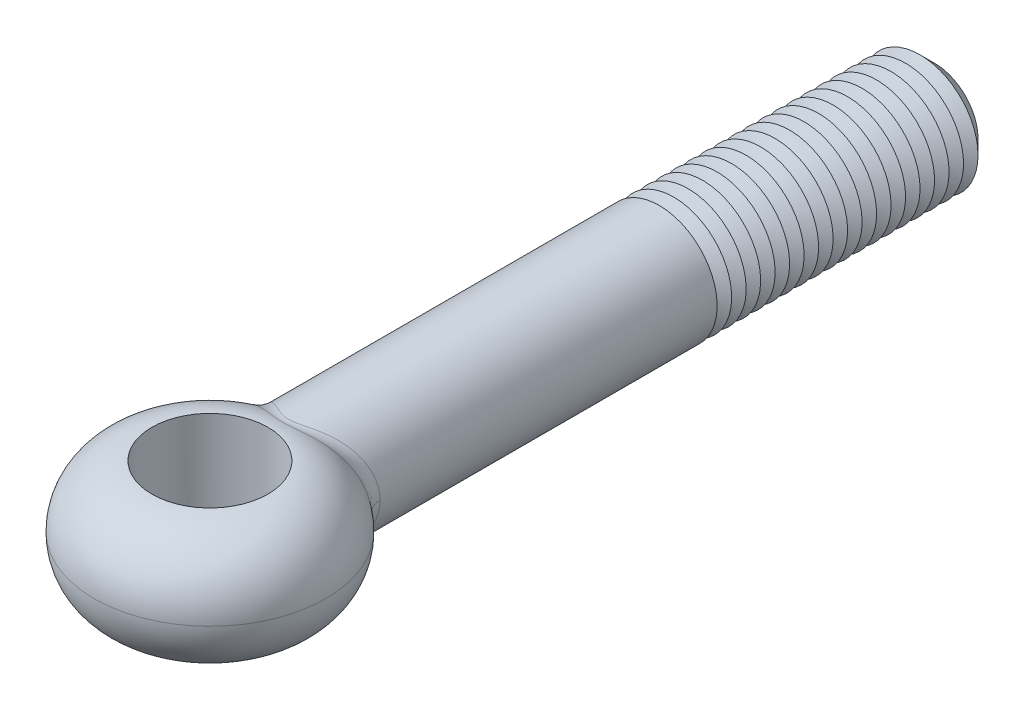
ISO-10303-21;
HEADER;
FILE_DESCRIPTION(('STEP AP214'),'2;1');
FILE_NAME('part.step','',(''),(''),'','','');
FILE_SCHEMA(('AUTOMOTIVE_DESIGN { 1 0 10303 214 1 1 1 1 }'));
ENDSEC;
DATA;
#1=APPLICATION_CONTEXT('core data for automotive mechanical design processes');
#2=APPLICATION_PROTOCOL_DEFINITION('international standard','automotive_design',2000,#1);
#3=PRODUCT_CONTEXT('',#1,'mechanical');
#4=PRODUCT('Part','Part','',(#3));
#5=PRODUCT_RELATED_PRODUCT_CATEGORY('part','',(#4));
#6=PRODUCT_DEFINITION_FORMATION('','',#4);
#7=PRODUCT_DEFINITION_CONTEXT('part definition',#1,'design');
#8=PRODUCT_DEFINITION('design','',#6,#7);
#9=PRODUCT_DEFINITION_SHAPE('','',#8);
#10=(LENGTH_UNIT() NAMED_UNIT(*) SI_UNIT(.MILLI.,.METRE.));
#11=(NAMED_UNIT(*) PLANE_ANGLE_UNIT() SI_UNIT($,.RADIAN.));
#12=(NAMED_UNIT(*) SI_UNIT($,.STERADIAN.) SOLID_ANGLE_UNIT());
#13=UNCERTAINTY_MEASURE_WITH_UNIT(LENGTH_MEASURE(1.E-05),#10,'distance_accuracy_value','');
#14=(GEOMETRIC_REPRESENTATION_CONTEXT(3) GLOBAL_UNCERTAINTY_ASSIGNED_CONTEXT((#13)) GLOBAL_UNIT_ASSIGNED_CONTEXT((#10,
#11,#12)) REPRESENTATION_CONTEXT('',''));
#15=CARTESIAN_POINT('',(0.,0.,0.));
#16=DIRECTION('',(0.,0.,1.));
#17=DIRECTION('',(1.,0.,0.));
#18=AXIS2_PLACEMENT_3D('',#15,#16,#17);
#19=CARTESIAN_POINT('',(0.,0.,-100.));
#20=DIRECTION('',(0.,0.,1.));
#21=DIRECTION('',(1.,0.,0.));
#22=AXIS2_PLACEMENT_3D('',#19,#20,#21);
#23=CYLINDRICAL_SURFACE('',#22,8.);
#24=CARTESIAN_POINT('',(0.,0.,-62.));
#25=DIRECTION('',(0.,0.,-1.));
#26=DIRECTION('',(-1.,0.,0.));
#27=AXIS2_PLACEMENT_3D('',#24,#25,#26);
#28=CIRCLE('',#27,8.);
#29=CARTESIAN_POINT('',(-8.,0.,-62.));
#30=VERTEX_POINT('',#29);
#31=EDGE_CURVE('E78',#30,#30,#28,.T.);
#32=ORIENTED_EDGE('',*,*,#31,.F.);
#33=EDGE_LOOP('',(#32));
#34=FACE_BOUND('',#33,.T.);
#35=CARTESIAN_POINT('',(7.65571552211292,-4.70868832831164,-12.4043242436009));
#36=CARTESIAN_POINT('',(6.72728970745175,-4.34389938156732,-13.262564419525));
#37=CARTESIAN_POINT('',(6.52180502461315,-4.63314787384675,-14.5297396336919));
#38=CARTESIAN_POINT('',(7.78528037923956,-4.53966232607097,-12.4565567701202));
#39=CARTESIAN_POINT('',(6.83379002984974,-4.17832451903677,-13.3197976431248));
#40=CARTESIAN_POINT('',(6.63998731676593,-4.46683351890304,-14.6083073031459));
#41=CARTESIAN_POINT('',(7.90812409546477,-4.36526473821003,-12.5059716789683));
#42=CARTESIAN_POINT('',(6.93368225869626,-4.0095233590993,-13.3734055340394));
#43=CARTESIAN_POINT('',(6.75228850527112,-4.29523375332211,-14.6825830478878));
#44=CARTESIAN_POINT('',(8.13948466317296,-4.00670892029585,-12.5988603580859));
#45=CARTESIAN_POINT('',(7.12062810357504,-3.66549770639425,-13.4736177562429));
#46=CARTESIAN_POINT('',(6.9641575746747,-3.94243016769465,-14.8221229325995));
#47=CARTESIAN_POINT('',(8.24799717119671,-3.82254775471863,-12.6423323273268));
#48=CARTESIAN_POINT('',(7.20758377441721,-3.49031776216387,-13.5201690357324));
#49=CARTESIAN_POINT('',(7.06372159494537,-3.76122345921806,-14.8873843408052));
#50=CARTESIAN_POINT('',(8.44978241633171,-3.44545520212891,-12.7230176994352));
#51=CARTESIAN_POINT('',(7.36833540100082,-3.13449696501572,-13.6061398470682));
#52=CARTESIAN_POINT('',(7.24911953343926,-3.39018051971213,-15.0084504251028));
#53=CARTESIAN_POINT('',(8.54304739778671,-3.25251941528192,-12.7602279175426));
#54=CARTESIAN_POINT('',(7.44203446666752,-2.95392242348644,-13.6455071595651));
#55=CARTESIAN_POINT('',(7.33494646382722,-3.20033995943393,-15.0642502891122));
#56=CARTESIAN_POINT('',(8.71342620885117,-2.85921824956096,-12.8280902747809));
#57=CARTESIAN_POINT('',(7.57598659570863,-2.58837905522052,-13.7170010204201));
#58=CARTESIAN_POINT('',(7.49190592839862,-2.81334843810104,-15.1659728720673));
#59=CARTESIAN_POINT('',(8.79054223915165,-2.65885388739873,-12.8587433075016));
#60=CARTESIAN_POINT('',(7.6361598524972,-2.40349985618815,-13.7490847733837));
#61=CARTESIAN_POINT('',(7.56304046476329,-2.6161984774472,-15.211896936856));
#62=CARTESIAN_POINT('',(8.92571181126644,-2.25853949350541,-12.9123976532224));
#63=CARTESIAN_POINT('',(7.74119890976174,-2.03625449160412,-13.8050560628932));
#64=CARTESIAN_POINT('',(7.68782564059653,-2.22230623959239,-15.292254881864));
#65=CARTESIAN_POINT('',(8.98429621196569,-2.05878122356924,-12.9356123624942));
#66=CARTESIAN_POINT('',(7.78643285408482,-1.85408075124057,-13.8291409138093));
#67=CARTESIAN_POINT('',(7.74196276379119,-2.02575264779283,-15.3270093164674));
#68=CARTESIAN_POINT('',(9.08514258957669,-1.65481550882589,-12.9755337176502));
#69=CARTESIAN_POINT('',(7.86407915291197,-1.48723318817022,-13.8704667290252));
#70=CARTESIAN_POINT('',(7.83520435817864,-1.62826766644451,-15.3867612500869));
#71=CARTESIAN_POINT('',(9.12739921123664,-1.45060662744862,-12.9922382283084));
#72=CARTESIAN_POINT('',(7.89643738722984,-1.3026689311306,-13.887678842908));
#73=CARTESIAN_POINT('',(7.87430389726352,-1.42733486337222,-15.4117555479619));
#74=CARTESIAN_POINT('',(9.19512372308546,-1.03944863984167,-13.0189938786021));
#75=CARTESIAN_POINT('',(7.94822057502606,-0.932097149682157,-13.9152169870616));
#76=CARTESIAN_POINT('',(7.93698863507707,-1.02277299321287,-15.4517833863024));
#77=CARTESIAN_POINT('',(9.22061021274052,-0.832502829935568,-13.0290523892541));
#78=CARTESIAN_POINT('',(7.96762552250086,-0.746210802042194,-13.9255323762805));
#79=CARTESIAN_POINT('',(7.96059102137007,-0.819147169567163,-15.4668279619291));
#80=CARTESIAN_POINT('',(9.25463049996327,-0.417038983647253,-13.042476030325));
#81=CARTESIAN_POINT('',(7.99352641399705,-0.373487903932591,-13.9392998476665));
#82=CARTESIAN_POINT('',(7.99209967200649,-0.41034851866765,-15.4869048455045));
#83=CARTESIAN_POINT('',(9.26315800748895,-0.208520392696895,-13.0458386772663));
#84=CARTESIAN_POINT('',(8.00000000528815,-0.186776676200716,-13.9427400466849));
#85=CARTESIAN_POINT('',(8.00000011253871,-0.205175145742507,-15.4919334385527));
#86=CARTESIAN_POINT('',(9.26315778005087,0.212096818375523,-13.0458386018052));
#87=CARTESIAN_POINT('',(7.99999999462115,0.189980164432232,-13.9427400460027));
#88=CARTESIAN_POINT('',(7.99999988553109,0.208694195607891,-15.4919333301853));
#89=CARTESIAN_POINT('',(9.25433501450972,0.424195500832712,-13.0423595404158));
#90=CARTESIAN_POINT('',(7.99330246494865,0.379894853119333,-13.9391808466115));
#91=CARTESIAN_POINT('',(7.99182588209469,0.417390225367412,-15.4867306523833));
#92=CARTESIAN_POINT('',(9.21912567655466,0.846898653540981,-13.0284665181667));
#93=CARTESIAN_POINT('',(7.96649487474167,0.759132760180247,-13.9249313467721));
#94=CARTESIAN_POINT('',(7.95921621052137,0.833312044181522,-15.4659516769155));
#95=CARTESIAN_POINT('',(9.19273228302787,1.05750251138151,-13.0180498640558));
#96=CARTESIAN_POINT('',(7.94639841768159,0.948323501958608,-13.9142482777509));
#97=CARTESIAN_POINT('',(7.93477422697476,1.04053723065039,-15.4503713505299));
#98=CARTESIAN_POINT('',(9.12263828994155,1.47558922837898,-12.9903565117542));
#99=CARTESIAN_POINT('',(7.89279270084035,1.32522192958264,-13.8857402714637));
#100=CARTESIAN_POINT('',(7.86989829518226,1.45191667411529,-15.4089401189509));
#101=CARTESIAN_POINT('',(9.07893758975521,1.68307206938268,-12.9730797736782));
#102=CARTESIAN_POINT('',(7.85932019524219,1.51280379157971,-13.867934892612));
#103=CARTESIAN_POINT('',(7.82946425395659,1.65607091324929,-15.3830891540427));
#104=CARTESIAN_POINT('',(8.97463738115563,2.09350607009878,-12.9317860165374));
#105=CARTESIAN_POINT('',(7.77898033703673,1.88569930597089,-13.8251732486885));
#106=CARTESIAN_POINT('',(7.73303581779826,2.05992041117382,-15.3212813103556));
#107=CARTESIAN_POINT('',(8.91403167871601,2.29645553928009,-12.9077665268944));
#108=CARTESIAN_POINT('',(7.73216134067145,2.07089682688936,-13.8002427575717));
#109=CARTESIAN_POINT('',(7.67703571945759,2.25961400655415,-15.2853207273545));
#110=CARTESIAN_POINT('',(8.7766400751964,2.69595109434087,-12.8532186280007));
#111=CARTESIAN_POINT('',(7.62531367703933,2.43769964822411,-13.7433022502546));
#112=CARTESIAN_POINT('',(7.55021504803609,2.65270054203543,-15.2036203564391));
#113=CARTESIAN_POINT('',(8.69988632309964,2.8925090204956,-12.8227031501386));
#114=CARTESIAN_POINT('',(7.56537860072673,2.61920953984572,-13.7113422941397));
#115=CARTESIAN_POINT('',(7.47942392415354,2.84610513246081,-15.1578999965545));
#116=CARTESIAN_POINT('',(8.53082157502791,3.27836797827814,-12.7553515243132));
#117=CARTESIAN_POINT('',(7.43237570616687,2.97809298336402,-13.6403484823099));
#118=CARTESIAN_POINT('',(7.32369350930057,3.2257738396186,-15.0569382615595));
#119=CARTESIAN_POINT('',(8.43850992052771,3.46766870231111,-12.7185151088));
#120=CARTESIAN_POINT('',(7.35938539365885,3.15538265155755,-13.6013561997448));
#121=CARTESIAN_POINT('',(7.23875361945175,3.41203765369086,-15.0016964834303));
#122=CARTESIAN_POINT('',(8.23912752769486,3.83785366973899,-12.638780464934));
#123=CARTESIAN_POINT('',(7.200476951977,3.50486381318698,-13.5163651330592));
#124=CARTESIAN_POINT('',(7.05558212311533,3.77628382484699,-14.8820525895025));
#125=CARTESIAN_POINT('',(8.13205660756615,4.01873780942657,-12.5958821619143));
#126=CARTESIAN_POINT('',(7.1146443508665,3.676990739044,-13.470412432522));
#127=CARTESIAN_POINT('',(6.95735035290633,3.9542660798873,-14.8176503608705));
#128=CARTESIAN_POINT('',(7.90405644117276,4.37102436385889,-12.5043342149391));
#129=CARTESIAN_POINT('',(6.93036449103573,4.01512460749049,-13.3716246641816));
#130=CARTESIAN_POINT('',(6.74856869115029,4.30090097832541,-14.6801217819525));
#131=CARTESIAN_POINT('',(7.7831309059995,4.54242929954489,-12.455686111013));
#132=CARTESIAN_POINT('',(6.83201017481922,4.18108915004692,-13.3188399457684));
#133=CARTESIAN_POINT('',(6.6380220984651,4.46955610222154,-14.606997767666));
#134=CARTESIAN_POINT('',(7.52417170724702,4.88033437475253,-12.3512981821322));
#135=CARTESIAN_POINT('',(6.61966655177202,4.51122245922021,-13.2047290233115));
#136=CARTESIAN_POINT('',(6.40182236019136,4.8020402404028,-14.4499782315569));
#137=CARTESIAN_POINT('',(7.38571067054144,5.04649564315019,-12.2953796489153));
#138=CARTESIAN_POINT('',(6.50535488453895,4.67515888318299,-13.1432256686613));
#139=CARTESIAN_POINT('',(6.27579579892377,4.96553581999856,-14.3658104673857));
#140=CARTESIAN_POINT('',(7.09600101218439,5.36700983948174,-12.1781888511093));
#141=CARTESIAN_POINT('',(6.26419128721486,4.99444350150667,-13.0133186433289));
#142=CARTESIAN_POINT('',(6.01283258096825,5.28090807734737,-14.1892780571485));
#143=CARTESIAN_POINT('',(6.9447557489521,5.52136584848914,-12.1169179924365));
#144=CARTESIAN_POINT('',(6.13743653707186,5.14979233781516,-12.9449680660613));
#145=CARTESIAN_POINT('',(5.87589879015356,5.43278778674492,-14.096915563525));
#146=CARTESIAN_POINT('',(6.63032399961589,5.81777921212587,-11.9894408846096));
#147=CARTESIAN_POINT('',(5.87186134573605,5.45104206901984,-12.8016646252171));
#148=CARTESIAN_POINT('',(5.59214975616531,5.72444585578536,-13.9045942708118));
#149=CARTESIAN_POINT('',(6.46713092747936,5.95982968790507,-11.9232319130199));
#150=CARTESIAN_POINT('',(5.73311888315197,5.5969588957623,-12.7267542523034));
#151=CARTESIAN_POINT('',(5.44532906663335,5.864217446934,-13.8046312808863));
#152=CARTESIAN_POINT('',(6.12980638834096,6.23103471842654,-11.7864658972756));
#153=CARTESIAN_POINT('',(5.44428764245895,5.8782916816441,-12.5708631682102));
#154=CARTESIAN_POINT('',(5.14301550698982,6.13107159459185,-13.597971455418));
#155=CARTESIAN_POINT('',(5.95567749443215,6.36019228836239,-11.7159098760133));
#156=CARTESIAN_POINT('',(5.2942739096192,6.01375077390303,-12.4899226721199));
#157=CARTESIAN_POINT('',(4.98752467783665,6.25815711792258,-13.4912762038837));
#158=CARTESIAN_POINT('',(5.58077734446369,6.61655266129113,-11.5644429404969));
#159=CARTESIAN_POINT('',(4.96933836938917,6.28519206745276,-12.3149807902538));
#160=CARTESIAN_POINT('',(4.65426780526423,6.51040475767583,-13.2620454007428));
#161=CARTESIAN_POINT('',(5.37902613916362,6.74249537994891,-11.4831752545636));
#162=CARTESIAN_POINT('',(4.79337910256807,6.42023065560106,-12.2204520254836));
#163=CARTESIAN_POINT('',(4.47576535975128,6.63432700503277,-13.1389537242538));
#164=CARTESIAN_POINT('',(4.96405939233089,6.97841153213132,-11.3172707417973));
#165=CARTESIAN_POINT('',(4.42939848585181,6.67584287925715,-12.0261057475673));
#166=CARTESIAN_POINT('',(4.11078186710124,6.86645840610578,-12.8874694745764));
#167=CARTESIAN_POINT('',(4.75084610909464,7.08838809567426,-11.2326345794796));
#168=CARTESIAN_POINT('',(4.24142531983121,6.79651407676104,-11.9263073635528));
#169=CARTESIAN_POINT('',(3.9243023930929,6.97467063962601,-12.7590779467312));
#170=CARTESIAN_POINT('',(4.31305945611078,7.29234286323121,-11.0613975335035));
#171=CARTESIAN_POINT('',(3.85380278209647,7.02260612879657,-11.7231213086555));
#172=CARTESIAN_POINT('',(3.54408562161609,7.17535340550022,-12.4991467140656));
#173=CARTESIAN_POINT('',(4.08848183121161,7.3863150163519,-10.9747959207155));
#174=CARTESIAN_POINT('',(3.654162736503,7.12813046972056,-11.6197260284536));
#175=CARTESIAN_POINT('',(3.35034561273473,7.26781798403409,-12.3676058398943));
#176=CARTESIAN_POINT('',(3.62764081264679,7.55817215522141,-10.8018106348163));
#177=CARTESIAN_POINT('',(3.24335533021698,7.32304867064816,-11.4120811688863));
#178=CARTESIAN_POINT('',(2.95605890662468,7.43691805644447,-12.1047402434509));
#179=CARTESIAN_POINT('',(3.3913812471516,7.63606236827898,-10.7154268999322));
#180=CARTESIAN_POINT('',(3.03217009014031,7.41256504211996,-11.3077963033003));
#181=CARTESIAN_POINT('',(2.7555144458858,7.51355869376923,-11.9734154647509));
#182=CARTESIAN_POINT('',(3.01086953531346,7.74546693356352,-10.5830417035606));
#183=CARTESIAN_POINT('',(2.69133046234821,7.53961841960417,-11.1471485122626));
#184=CARTESIAN_POINT('',(2.43558876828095,7.62120810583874,-11.7721230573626));
#185=CARTESIAN_POINT('',(2.87105562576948,7.78246196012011,-10.5357450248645));
#186=CARTESIAN_POINT('',(2.5661213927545,7.58284459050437,-11.0896499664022));
#187=CARTESIAN_POINT('',(2.31864844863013,7.65760962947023,-11.700201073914));
#188=CARTESIAN_POINT('',(2.58677327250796,7.85120381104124,-10.4433981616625));
#189=CARTESIAN_POINT('',(2.31149724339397,7.66361225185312,-10.9771506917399));
#190=CARTESIAN_POINT('',(2.08222311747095,7.725248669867,-11.5597728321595));
#191=CARTESIAN_POINT('',(2.4423056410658,7.88295154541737,-10.3983475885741));
#192=CARTESIAN_POINT('',(2.18206471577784,7.70117677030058,-10.9221313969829));
#193=CARTESIAN_POINT('',(1.96273855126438,7.75648708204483,-11.4912659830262));
#194=CARTESIAN_POINT('',(2.14829229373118,7.94107768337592,-10.3118779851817));
#195=CARTESIAN_POINT('',(1.91873101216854,7.77031102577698,-10.8163504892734));
#196=CARTESIAN_POINT('',(1.72099254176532,7.81368071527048,-11.3597855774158));
#197=CARTESIAN_POINT('',(1.99874950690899,7.96745912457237,-10.270456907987));
#198=CARTESIAN_POINT('',(1.78480669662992,7.80190571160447,-10.7655636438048));
#199=CARTESIAN_POINT('',(1.59873271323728,7.83963892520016,-11.2968089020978));
#200=CARTESIAN_POINT('',(1.69405593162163,8.0146723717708,-10.193104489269));
#201=CARTESIAN_POINT('',(1.51212291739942,7.85870857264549,-10.6706050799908));
#202=CARTESIAN_POINT('',(1.35106400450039,7.88609474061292,-11.1792198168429));
#203=CARTESIAN_POINT('',(1.53890651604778,8.03550552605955,-10.1571718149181));
#204=CARTESIAN_POINT('',(1.3733287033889,7.88393882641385,-10.6264046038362));
#205=CARTESIAN_POINT('',(1.22565589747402,7.90659367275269,-11.1246053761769));
#206=CARTESIAN_POINT('',(1.26101534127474,8.06699003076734,-10.1009556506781));
#207=CARTESIAN_POINT('',(1.12491664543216,7.92221302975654,-10.5571921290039));
#208=CARTESIAN_POINT('',(1.00219933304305,7.93757307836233,-11.0391767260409));
#209=CARTESIAN_POINT('',(1.13947852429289,8.07888519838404,-10.0789878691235));
#210=CARTESIAN_POINT('',(1.01633877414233,7.93673299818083,-10.5301169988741));
#211=CARTESIAN_POINT('',(0.90484411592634,7.94927741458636,-11.0057989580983));
#212=CARTESIAN_POINT('',(0.893460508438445,8.09911575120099,-10.0408546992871));
#213=CARTESIAN_POINT('',(0.796699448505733,7.96148016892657,-10.4831027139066));
#214=CARTESIAN_POINT('',(0.708414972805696,7.96918341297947,-10.9478665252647));
#215=CARTESIAN_POINT('',(0.768980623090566,8.10745269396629,-10.0246867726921));
#216=CARTESIAN_POINT('',(0.685612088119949,7.97171600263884,-10.4631484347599));
#217=CARTESIAN_POINT('',(0.609341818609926,7.97738660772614,-10.9233080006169));
#218=CARTESIAN_POINT('',(0.518300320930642,8.12036544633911,-9.9993428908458));
#219=CARTESIAN_POINT('',(0.46202700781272,7.98758747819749,-10.4318683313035));
#220=CARTESIAN_POINT('',(0.410276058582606,7.99009220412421,-10.8848145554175));
#221=CARTESIAN_POINT('',(0.39210936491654,8.12495695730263,-9.99013775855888));
#222=CARTESIAN_POINT('',(0.349505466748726,7.99324704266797,-10.4204974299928));
#223=CARTESIAN_POINT('',(0.310289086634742,7.99461005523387,-10.8708353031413));
#224=CARTESIAN_POINT('',(0.138717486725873,8.13030926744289,-9.97938544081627));
#225=CARTESIAN_POINT('',(0.123640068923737,7.99984388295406,-10.4072188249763));
#226=CARTESIAN_POINT('',(0.109710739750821,7.99987649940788,-10.8545066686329));
#227=CARTESIAN_POINT('',(0.0115166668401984,8.13107044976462,-9.97783748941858));
#228=CARTESIAN_POINT('',(0.0102607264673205,8.00078372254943,-10.4053059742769));
#229=CARTESIAN_POINT('',(0.00911942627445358,8.00062546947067,-10.8521561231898));
#230=CARTESIAN_POINT('',(-0.242597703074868,8.12873778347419,-9.98254200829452));
#231=CARTESIAN_POINT('',(-0.216224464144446,7.99790731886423,-10.4111163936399));
#232=CARTESIAN_POINT('',(-0.191921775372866,7.99833022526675,-10.8593002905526));
#233=CARTESIAN_POINT('',(-0.369510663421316,8.1256389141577,-9.9888046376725));
#234=CARTESIAN_POINT('',(-0.329366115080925,7.99408395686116,-10.4188540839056));
#235=CARTESIAN_POINT('',(-0.292371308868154,7.9952810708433,-10.8688104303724));
#236=CARTESIAN_POINT('',(-0.62154313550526,8.1156691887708,-10.0085955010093));
#237=CARTESIAN_POINT('',(-0.55409126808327,7.98181341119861,-10.4432875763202));
#238=CARTESIAN_POINT('',(-0.492201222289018,7.98547128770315,-10.8988675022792));
#239=CARTESIAN_POINT('',(-0.746662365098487,8.1087977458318,-10.0221248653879));
#240=CARTESIAN_POINT('',(-0.665708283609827,7.97336172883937,-10.4599921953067));
#241=CARTESIAN_POINT('',(-0.591581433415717,7.97871008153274,-10.9194161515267));
#242=CARTESIAN_POINT('',(-0.994807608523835,8.09140385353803,-10.0554975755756));
#243=CARTESIAN_POINT('',(-0.887155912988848,7.95203968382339,-10.5011571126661));
#244=CARTESIAN_POINT('',(-0.789239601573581,7.9615952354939,-10.9701112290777));
#245=CARTESIAN_POINT('',(-1.11781918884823,8.08086243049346,-10.0753736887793));
#246=CARTESIAN_POINT('',(-0.997003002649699,7.93914030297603,-10.5256688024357));
#247=CARTESIAN_POINT('',(-0.887509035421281,7.95122292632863,-11.0003074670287));
#248=CARTESIAN_POINT('',(-1.36062252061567,8.05632046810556,-10.1202009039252));
#249=CARTESIAN_POINT('',(-1.21391840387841,7.90923091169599,-10.5808872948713));
#250=CARTESIAN_POINT('',(-1.08217747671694,7.92707468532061,-11.0684211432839));
#251=CARTESIAN_POINT('',(-1.48041386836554,8.04231949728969,-10.1451526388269));
#252=CARTESIAN_POINT('',(-1.32101027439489,7.89221272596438,-10.6116076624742));
#253=CARTESIAN_POINT('',(-1.17857624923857,7.91329832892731,-11.1063395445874));
#254=CARTESIAN_POINT('',(-1.83571751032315,7.99525450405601,-10.2260259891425));
#255=CARTESIAN_POINT('',(-1.63896719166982,7.83523151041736,-10.7111025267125));
#256=CARTESIAN_POINT('',(-1.46567741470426,7.86698838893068,-11.2292596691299));
#257=CARTESIAN_POINT('',(-2.06624268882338,7.95719484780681,-10.2878252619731));
#258=CARTESIAN_POINT('',(-1.84542427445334,7.78943990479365,-10.786994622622));
#259=CARTESIAN_POINT('',(-1.65355562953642,7.82953931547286,-11.323212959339));
#260=CARTESIAN_POINT('',(-2.51536964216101,7.86860887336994,-10.4197592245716));
#261=CARTESIAN_POINT('',(-2.24768618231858,7.68406371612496,-10.9484016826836));
#262=CARTESIAN_POINT('',(-2.02278766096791,7.74237450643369,-11.523822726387));
#263=CARTESIAN_POINT('',(-2.7339584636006,7.81806932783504,-10.4899027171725));
#264=CARTESIAN_POINT('',(-2.44357001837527,7.62438808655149,-11.0340073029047));
#265=CARTESIAN_POINT('',(-2.20413431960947,7.69264575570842,-11.6304926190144));
#266=CARTESIAN_POINT('',(-3.16114079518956,7.7047711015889,-10.6341356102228));
#267=CARTESIAN_POINT('',(-2.82605678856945,7.49212963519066,-11.209290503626));
#268=CARTESIAN_POINT('',(-2.56144019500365,7.5811651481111,-11.8498152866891));
#269=CARTESIAN_POINT('',(-3.36972002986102,7.64199557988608,-10.7082303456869));
#270=CARTESIAN_POINT('',(-3.01269895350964,7.41945044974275,-11.2990288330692));
#271=CARTESIAN_POINT('',(-2.7373915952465,7.51939672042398,-11.9624761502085));
#272=CARTESIAN_POINT('',(-3.77761069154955,7.50439428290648,-10.8574864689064));
#273=CARTESIAN_POINT('',(-3.37700705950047,7.26193164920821,-11.478951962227));
#274=CARTESIAN_POINT('',(-3.08400676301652,7.38400293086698,-12.1893535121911));
#275=CARTESIAN_POINT('',(-3.97692585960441,7.42957342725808,-10.9326474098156));
#276=CARTESIAN_POINT('',(-3.55470238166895,7.17701899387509,-11.5691696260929));
#277=CARTESIAN_POINT('',(-3.25467265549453,7.31038240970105,-12.3035693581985));
#278=CARTESIAN_POINT('',(-4.39445558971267,7.2564786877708,-11.0928561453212));
#279=CARTESIAN_POINT('',(-3.92598763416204,6.98268785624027,-11.7605523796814));
#280=CARTESIAN_POINT('',(-3.61448048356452,7.14006459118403,-12.5469124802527));
#281=CARTESIAN_POINT('',(-4.61137762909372,7.15638577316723,-11.1778053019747));
#282=CARTESIAN_POINT('',(-4.11816178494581,6.87146818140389,-11.8614202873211));
#283=CARTESIAN_POINT('',(-3.80283870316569,7.04157744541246,-12.6758739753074));
#284=CARTESIAN_POINT('',(-5.03418640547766,6.94053636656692,-11.3451201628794));
#285=CARTESIAN_POINT('',(-4.49106527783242,6.6346292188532,-12.0588431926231));
#286=CARTESIAN_POINT('',(-4.17223411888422,6.82919086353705,-12.9297006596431));
#287=CARTESIAN_POINT('',(-5.24007150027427,6.82477755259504,-11.4274854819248));
#288=CARTESIAN_POINT('',(-4.67176487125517,6.50890803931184,-12.1553921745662));
#289=CARTESIAN_POINT('',(-4.35327022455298,6.71528914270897,-13.0545652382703));
#290=CARTESIAN_POINT('',(-5.64018983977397,6.57785054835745,-11.5883608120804));
#291=CARTESIAN_POINT('',(-5.02102168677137,6.24402103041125,-12.3427259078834));
#292=CARTESIAN_POINT('',(-4.70691034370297,6.47232353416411,-13.2982594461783));
#293=CARTESIAN_POINT('',(-5.83443208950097,6.44669450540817,-11.6668737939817));
#294=CARTESIAN_POINT('',(-5.18953304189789,6.10478124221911,-12.4334896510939));
#295=CARTESIAN_POINT('',(-4.87952085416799,6.34327159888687,-13.417093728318));
#296=CARTESIAN_POINT('',(-6.21062987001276,6.16921890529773,-11.8191988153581));
#297=CARTESIAN_POINT('',(-5.5138573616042,5.81373255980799,-12.6083829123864));
#298=CARTESIAN_POINT('',(-5.2152572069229,6.07024747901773,-13.6474577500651));
#299=CARTESIAN_POINT('',(-6.39258596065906,6.02290003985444,-11.8930110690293));
#300=CARTESIAN_POINT('',(-5.66959067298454,5.66186103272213,-12.6924706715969));
#301=CARTESIAN_POINT('',(-5.37838348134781,5.9262759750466,-13.7589878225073));
#302=CARTESIAN_POINT('',(-6.76082954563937,5.70011889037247,-12.0423592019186));
#303=CARTESIAN_POINT('',(-5.98269684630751,5.33064591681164,-12.8614822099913));
#304=CARTESIAN_POINT('',(-5.7096924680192,5.60867313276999,-13.9844670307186));
#305=CARTESIAN_POINT('',(-6.94571467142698,5.52210505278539,-12.1173228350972));
#306=CARTESIAN_POINT('',(-6.1384387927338,5.15012845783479,-12.9455201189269));
#307=CARTESIAN_POINT('',(-5.87673584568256,5.4335151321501,-14.0975328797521));
#308=CARTESIAN_POINT('',(-7.2978095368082,5.14921557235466,-12.2598587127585));
#309=CARTESIAN_POINT('',(-6.432710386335,4.77666871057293,-13.1041242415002));
#310=CARTESIAN_POINT('',(-6.19585367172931,5.06660783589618,-14.3123318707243));
#311=CARTESIAN_POINT('',(-7.46501728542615,4.95433803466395,-12.3274301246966));
#312=CARTESIAN_POINT('',(-6.5710843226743,4.58371724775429,-13.1786053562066));
#313=CARTESIAN_POINT('',(-6.34792643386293,4.87485667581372,-14.4140637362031));
#314=CARTESIAN_POINT('',(-7.78013527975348,4.54891459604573,-12.4544969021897));
#315=CARTESIAN_POINT('',(-6.82982333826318,4.18696009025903,-13.3176780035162));
#316=CARTESIAN_POINT('',(-6.63524155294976,4.47593735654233,-14.6052189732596));
#317=CARTESIAN_POINT('',(-7.92803665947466,4.33836156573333,-12.5139885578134));
#318=CARTESIAN_POINT('',(-6.95001540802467,3.98318853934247,-13.3821752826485));
#319=CARTESIAN_POINT('',(-6.77047617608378,4.26876218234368,-14.6946366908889));
#320=CARTESIAN_POINT('',(-8.20275756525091,3.90330017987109,-12.6242339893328));
#321=CARTESIAN_POINT('',(-7.17161528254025,3.56660483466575,-13.5009298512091));
#322=CARTESIAN_POINT('',(-7.02216465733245,3.84068039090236,-14.8602256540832));
#323=CARTESIAN_POINT('',(-8.32958109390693,3.67879448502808,-12.6749894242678));
#324=CARTESIAN_POINT('',(-7.27286247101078,3.35388041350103,-13.5551002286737));
#325=CARTESIAN_POINT('',(-7.13862208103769,3.61977639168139,-14.9363994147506));
#326=CARTESIAN_POINT('',(-8.54733325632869,3.24423340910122,-12.7619453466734));
#327=CARTESIAN_POINT('',(-7.44552191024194,2.94603669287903,-13.6473748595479));
#328=CARTESIAN_POINT('',(-7.33887694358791,3.19218688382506,-15.0668289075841));
#329=CARTESIAN_POINT('',(-8.64071095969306,3.03547652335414,-12.7991477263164));
#330=CARTESIAN_POINT('',(-7.51894899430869,2.75170647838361,-13.6865686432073));
#331=CARTESIAN_POINT('',(-7.42488873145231,2.98677903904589,-15.1225967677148));
#332=CARTESIAN_POINT('',(-8.80876711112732,2.61008550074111,-12.865990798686));
#333=CARTESIAN_POINT('',(-7.65044657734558,2.35845430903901,-13.7567044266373));
#334=CARTESIAN_POINT('',(-7.57984616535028,2.56821247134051,-15.2227563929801));
#335=CARTESIAN_POINT('',(-8.88344772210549,2.39345227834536,-12.8956323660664));
#336=CARTESIAN_POINT('',(-7.70842508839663,2.15964982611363,-13.7875971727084));
#337=CARTESIAN_POINT('',(-7.64879378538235,2.35505464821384,-15.2671494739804));
#338=CARTESIAN_POINT('',(-9.01314517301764,1.9545388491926,-12.9470441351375));
#339=CARTESIAN_POINT('',(-7.80874691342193,1.75904530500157,-13.8410223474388));
#340=CARTESIAN_POINT('',(-7.76862124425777,1.9231826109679,-15.3441237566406));
#341=CARTESIAN_POINT('',(-9.06820874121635,1.7322734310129,-12.9688330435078));
#342=CARTESIAN_POINT('',(-7.85105172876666,1.55739026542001,-13.8635342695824));
#343=CARTESIAN_POINT('',(-7.81954401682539,1.70448294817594,-15.3767330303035));
#344=CARTESIAN_POINT('',(-9.15827613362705,1.28352045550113,-13.0044431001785));
#345=CARTESIAN_POINT('',(-7.92010315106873,1.151767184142,-13.9002668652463));
#346=CARTESIAN_POINT('',(-7.90287516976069,1.26292921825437,-15.4300168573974));
#347=CARTESIAN_POINT('',(-9.19329180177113,1.05703547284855,-13.0182689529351));
#348=CARTESIAN_POINT('',(-7.94680432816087,0.94795427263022,-13.9144633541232));
#349=CARTESIAN_POINT('',(-7.93529448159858,1.04007768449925,-15.4506984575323));
#350=CARTESIAN_POINT('',(-9.23310033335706,0.691727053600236,-13.0339812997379));
#351=CARTESIAN_POINT('',(-7.97713736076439,0.619900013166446,-13.9305885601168));
#352=CARTESIAN_POINT('',(-7.97215833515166,0.680629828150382,-15.4742000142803));
#353=CARTESIAN_POINT('',(-9.24436828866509,0.553629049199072,-13.0384268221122));
#354=CARTESIAN_POINT('',(-7.98571004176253,0.496050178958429,-13.9351451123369));
#355=CARTESIAN_POINT('',(-7.9825950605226,0.544747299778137,-15.4808487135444));
#356=CARTESIAN_POINT('',(-9.25939658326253,0.277025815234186,-13.0443552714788));
#357=CARTESIAN_POINT('',(-7.99714237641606,0.248119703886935,-13.9412213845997));
#358=CARTESIAN_POINT('',(-7.99651547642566,0.272581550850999,-15.4897150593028));
#359=CARTESIAN_POINT('',(-9.26315875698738,0.138520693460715,-13.0458389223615));
#360=CARTESIAN_POINT('',(-7.99999999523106,0.124076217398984,-13.9427400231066));
#361=CARTESIAN_POINT('',(-8.00000086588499,0.136298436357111,-15.4919337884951));
#362=CARTESIAN_POINT('',(-9.26315657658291,-0.211761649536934,-13.0458382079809));
#363=CARTESIAN_POINT('',(-8.00000000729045,-0.189679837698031,-13.9427400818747));
#364=CARTESIAN_POINT('',(-7.99999867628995,-0.208364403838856,-15.4919327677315));
#365=CARTESIAN_POINT('',(-9.25436090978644,-0.423559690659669,-13.0423697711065));
#366=CARTESIAN_POINT('',(-7.99332234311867,-0.379325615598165,-13.9391914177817));
#367=CARTESIAN_POINT('',(-7.99184985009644,-0.41676461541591,-15.486745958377));
#368=CARTESIAN_POINT('',(-9.2192545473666,-0.845675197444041,-13.0285173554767));
#369=CARTESIAN_POINT('',(-7.96659277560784,-0.758034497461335,-13.9249833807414));
#370=CARTESIAN_POINT('',(-7.95933558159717,-0.832108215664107,-15.4660277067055));
#371=CARTESIAN_POINT('',(-9.19293494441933,-1.05599185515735,-13.0181298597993));
#372=CARTESIAN_POINT('',(-7.94655277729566,-0.946965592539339,-13.9143303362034));
#373=CARTESIAN_POINT('',(-7.93496189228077,-1.03905080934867,-15.4504910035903));
#374=CARTESIAN_POINT('',(-9.12293145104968,-1.47414078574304,-12.9904724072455));
#375=CARTESIAN_POINT('',(-7.89301742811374,-1.32391258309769,-13.8858598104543));
#376=CARTESIAN_POINT('',(-7.87016954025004,-1.45049146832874,-15.4091135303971));
#377=CARTESIAN_POINT('',(-9.0791962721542,-1.68196383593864,-12.9731821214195));
#378=CARTESIAN_POINT('',(-7.85951913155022,-1.51179861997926,-13.8680407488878));
#379=CARTESIAN_POINT('',(-7.82970348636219,-1.65498045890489,-15.38324232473));
#380=CARTESIAN_POINT('',(-8.97478996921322,-2.09299557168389,-12.9318464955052));
#381=CARTESIAN_POINT('',(-7.77909835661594,-1.88523285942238,-13.8252360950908));
#382=CARTESIAN_POINT('',(-7.73317681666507,-2.05941810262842,-15.3213718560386));
#383=CARTESIAN_POINT('',(-8.91411827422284,-2.29620410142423,-12.9078009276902));
#384=CARTESIAN_POINT('',(-7.73222890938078,-2.07066511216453,-13.8002787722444));
#385=CARTESIAN_POINT('',(-7.67711567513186,-2.25936660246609,-15.2853722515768));
#386=CARTESIAN_POINT('',(-8.7765466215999,-2.69622247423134,-12.8531815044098));
#387=CARTESIAN_POINT('',(-7.62524114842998,-2.43794839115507,-13.7432635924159));
#388=CARTESIAN_POINT('',(-7.55012876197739,-2.65296756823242,-15.203564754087));
#389=CARTESIAN_POINT('',(-8.69967722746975,-2.89304357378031,-12.8226199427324));
#390=CARTESIAN_POINT('',(-7.56521539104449,-2.61970332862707,-13.7112552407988));
#391=CARTESIAN_POINT('',(-7.47923098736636,-2.84663111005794,-15.1577753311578));
#392=CARTESIAN_POINT('',(-8.53033202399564,-3.27942770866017,-12.7551564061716));
#393=CARTESIAN_POINT('',(-7.43198999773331,-2.97908029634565,-13.6401425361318));
#394=CARTESIAN_POINT('',(-7.32324290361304,-3.22681656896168,-15.056645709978));
#395=CARTESIAN_POINT('',(-8.43785406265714,-3.46898973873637,-12.7182535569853));
#396=CARTESIAN_POINT('',(-7.35886693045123,-3.15661777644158,-13.6010792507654));
#397=CARTESIAN_POINT('',(-7.23815063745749,-3.4133374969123,-15.0013041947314));
#398=CARTESIAN_POINT('',(-8.23838126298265,-3.83913533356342,-12.6384812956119));
#399=CARTESIAN_POINT('',(-7.19987817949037,-3.50608561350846,-13.5160445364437));
#400=CARTESIAN_POINT('',(-7.05489698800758,-3.7775449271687,-14.881603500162));
#401=CARTESIAN_POINT('',(-8.13142827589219,-4.01974280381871,-12.5956290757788));
#402=CARTESIAN_POINT('',(-7.11413550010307,-3.67796425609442,-13.4701394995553));
#403=CARTESIAN_POINT('',(-6.95677329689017,-3.95525495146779,-14.8172703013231));
#404=CARTESIAN_POINT('',(-7.90371313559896,-4.37152047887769,-12.5041971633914));
#405=CARTESIAN_POINT('',(-6.93008703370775,-4.01559388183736,-13.3714760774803));
#406=CARTESIAN_POINT('',(-6.74825601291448,-4.3013891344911,-14.6799157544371));
#407=CARTESIAN_POINT('',(-7.78295514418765,-4.54269350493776,-12.4556191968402));
#408=CARTESIAN_POINT('',(-6.83187409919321,-4.18130307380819,-13.3187679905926));
#409=CARTESIAN_POINT('',(-6.63786611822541,-4.46981606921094,-14.6068970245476));
#410=CARTESIAN_POINT('',(-7.65571552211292,-4.70868832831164,-12.4043242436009));
#411=CARTESIAN_POINT('',(-6.72728970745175,-4.34389938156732,-13.262564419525));
#412=CARTESIAN_POINT('',(-6.52180502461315,-4.63314787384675,-14.5297396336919));
#413=(BOUNDED_SURFACE() B_SPLINE_SURFACE(3,2,((#35,#36,#37),(#38,#39,#40),(#41,#42,#43),(#44,
#45,#46),(#47,#48,#49),(#50,#51,#52),(#53,#54,#55),(#56,#57,#58),(#59,#60,#61),(#62,#63,#64),
(#65,#66,#67),(#68,#69,#70),(#71,#72,#73),(#74,#75,#76),(#77,#78,#79),(#80,#81,#82),(#83,#84,
#85),(#86,#87,#88),(#89,#90,#91),(#92,#93,#94),(#95,#96,#97),(#98,#99,#100),(#101,#102,#103),
(#104,#105,#106),(#107,#108,#109),(#110,#111,#112),(#113,#114,#115),(#116,#117,#118),(#119,#120,
#121),(#122,#123,#124),(#125,#126,#127),(#128,#129,#130),(#131,#132,#133),(#134,#135,#136),
(#137,#138,#139),(#140,#141,#142),(#143,#144,#145),(#146,#147,#148),(#149,#150,#151),(#152,#153,
#154),(#155,#156,#157),(#158,#159,#160),(#161,#162,#163),(#164,#165,#166),(#167,#168,#169),
(#170,#171,#172),(#173,#174,#175),(#176,#177,#178),(#179,#180,#181),(#182,#183,#184),(#185,#186,
#187),(#188,#189,#190),(#191,#192,#193),(#194,#195,#196),(#197,#198,#199),(#200,#201,#202),
(#203,#204,#205),(#206,#207,#208),(#209,#210,#211),(#212,#213,#214),(#215,#216,#217),(#218,#219,
#220),(#221,#222,#223),(#224,#225,#226),(#227,#228,#229),(#230,#231,#232),(#233,#234,#235),
(#236,#237,#238),(#239,#240,#241),(#242,#243,#244),(#245,#246,#247),(#248,#249,#250),(#251,#252,
#253),(#254,#255,#256),(#257,#258,#259),(#260,#261,#262),(#263,#264,#265),(#266,#267,#268),
(#269,#270,#271),(#272,#273,#274),(#275,#276,#277),(#278,#279,#280),(#281,#282,#283),(#284,#285,
#286),(#287,#288,#289),(#290,#291,#292),(#293,#294,#295),(#296,#297,#298),(#299,#300,#301),
(#302,#303,#304),(#305,#306,#307),(#308,#309,#310),(#311,#312,#313),(#314,#315,#316),(#317,#318,
#319),(#320,#321,#322),(#323,#324,#325),(#326,#327,#328),(#329,#330,#331),(#332,#333,#334),
(#335,#336,#337),(#338,#339,#340),(#341,#342,#343),(#344,#345,#346),(#347,#348,#349),(#350,#351,
#352),(#353,#354,#355),(#356,#357,#358),(#359,#360,#361),(#362,#363,#364),(#365,#366,#367),
(#368,#369,#370),(#371,#372,#373),(#374,#375,#376),(#377,#378,#379),(#380,#381,#382),(#383,#384,
#385),(#386,#387,#388),(#389,#390,#391),(#392,#393,#394),(#395,#396,#397),(#398,#399,#400),
(#401,#402,#403),(#404,#405,#406),(#407,#408,#409),(#410,#411,#412)),.UNSPECIFIED.,.F.,.F.,
.F.) B_SPLINE_SURFACE_WITH_KNOTS((4,2,2,2,2,2,2,2,2,2,2,2,2,2,2,2,2,2,2,2,2,2,2,2,2,2,2,2,2,2,2,
2,2,2,2,2,2,2,2,2,2,2,2,2,2,2,2,2,2,2,2,2,2,2,2,2,2,2,2,2,2,2,4),(3,3),(0.,0.873822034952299,
1.74790830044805,2.62243779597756,3.49684803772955,4.34328791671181,5.19000517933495,
6.03578177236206,6.88187200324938,7.74247390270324,8.60341009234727,9.46435128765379,
10.3256083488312,11.1851666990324,12.0447614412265,12.9043667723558,13.7637423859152,
14.6509629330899,15.537951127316,16.4254319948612,17.3127048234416,18.2811590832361,
19.2494232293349,20.2180526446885,21.1863667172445,21.7355609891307,22.2846599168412,
22.8334471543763,23.3821009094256,23.798477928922,24.2146724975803,24.6291132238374,
25.0435124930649,25.4584513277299,25.8734547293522,26.2906363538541,26.70787003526,
27.5454035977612,28.3838286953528,29.2234160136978,30.0626612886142,31.0201220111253,
31.9777248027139,32.9345771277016,33.8913858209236,34.9443500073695,35.9974326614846,
37.0509972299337,38.1043615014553,39.0368386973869,39.9692079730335,40.8993412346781,
41.8289244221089,42.3911753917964,42.9532889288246,43.8126124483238,44.6723730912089,
45.5346846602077,46.3970253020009,47.2577531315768,48.118599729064,48.9770085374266,
49.8351592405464),(0.,1.),
.UNSPECIFIED.) GEOMETRIC_REPRESENTATION_ITEM() RATIONAL_B_SPLINE_SURFACE(((1.,0.915774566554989,
1.),(1.,0.913691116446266,1.),(1.,0.911687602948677,1.),(1.,0.907872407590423,1.),(1.,
0.906060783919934,1.),(1.,0.902661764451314,1.),(1.,0.901074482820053,1.),(1.,0.898154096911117,
1.),(1.,0.896820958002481,1.),(1.,0.894471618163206,1.),(1.,0.893446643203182,1.),(1.,
0.891675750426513,1.),(1.,0.890929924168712,1.),(1.,0.88973197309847,1.),(1.,0.889279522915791,
1.),(1.,0.88867513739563,1.),(1.,0.888523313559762,1.),(1.,0.888523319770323,1.),(1.,
0.8886804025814,1.),(1.,0.889305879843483,1.),(1.,0.889774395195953,1.),(1.,0.891014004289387,
1.),(1.,0.891785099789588,1.),(1.,0.893615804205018,1.),(1.,0.894675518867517,1.),(1.,
0.897061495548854,1.),(1.,0.898387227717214,1.),(1.,0.901282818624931,1.),(1.,0.902852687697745,
1.),(1.,0.906209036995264,1.),(1.,0.90799551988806,1.),(1.,0.911754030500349,1.),(1.,
0.913726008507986,1.),(1.,0.9178895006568,1.),(1.,0.920086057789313,1.),(1.,0.924603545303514,
1.),(1.,0.926924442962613,1.),(1.,0.931652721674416,1.),(1.,0.934060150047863,1.),(1.,
0.938918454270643,1.),(1.,0.941369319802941,1.),(1.,0.946497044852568,1.),(1.,0.949174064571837,
1.),(1.,0.954471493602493,1.),(1.,0.957091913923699,1.),(1.,0.962215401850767,1.),(1.,
0.964718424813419,1.),(1.,0.96953568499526,1.),(1.,0.971849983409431,1.),(1.,0.975261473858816,
1.),(1.,0.976451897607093,1.),(1.,0.978724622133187,1.),(1.,0.97980694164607,1.),(1.,
0.981839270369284,1.),(1.,0.982789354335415,1.),(1.,0.984528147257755,1.),(1.,0.985316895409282,
1.),(1.,0.986530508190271,1.),(1.,0.986997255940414,1.),(1.,0.987799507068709,1.),(1.,
0.98813506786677,1.),(1.,0.988658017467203,1.),(1.,0.988846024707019,1.),(1.,0.989065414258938,
1.),(1.,0.989096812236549,1.),(1.,0.989001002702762,1.),(1.,0.988873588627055,1.),(1.,
0.988467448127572,1.),(1.,0.988188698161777,1.),(1.,0.987492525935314,1.),(1.,0.987074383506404,
1.),(1.,0.986117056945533,1.),(1.,0.985577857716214,1.),(1.,0.983799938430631,1.),(1.,
0.982403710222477,1.),(1.,0.979304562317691,1.),(1.,0.977601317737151,1.),(1.,0.97396608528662,
1.),(1.,0.972033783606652,1.),(1.,0.968004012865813,1.),(1.,0.965906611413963,1.),(1.,
0.961291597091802,1.),(1.,0.958756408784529,1.),(1.,0.953598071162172,1.),(1.,0.950974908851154,
1.),(1.,0.945700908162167,1.),(1.,0.943050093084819,1.),(1.,0.937773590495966,1.),(1.,
0.935147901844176,1.),(1.,0.929713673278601,1.),(1.,0.926913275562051,1.),(1.,0.921473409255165,
1.),(1.,0.91883395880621,1.),(1.,0.913779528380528,1.),(1.,0.911364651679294,1.),(1.,
0.90682163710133,1.),(1.,0.90469344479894,1.),(1.,0.901003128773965,1.),(1.,0.899404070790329,
1.),(1.,0.896506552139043,1.),(1.,0.895208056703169,1.),(1.,0.892941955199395,1.),(1.,
0.89197356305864,1.),(1.,0.890384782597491,1.),(1.,0.889764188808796,1.),(1.,0.889057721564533,
1.),(1.,0.888857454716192,1.),(1.,0.888590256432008,1.),(1.,0.888523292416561,1.),(1.,
0.888523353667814,1.),(1.,0.888679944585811,1.),(1.,0.889303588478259,1.),(1.,0.889770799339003,
1.),(1.,0.891008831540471,1.),(1.,0.891780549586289,1.),(1.,0.893613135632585,1.),(1.,
0.894674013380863,1.),(1.,0.897063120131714,1.),(1.,0.89839084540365,1.),(1.,0.901291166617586,
1.),(1.,0.902863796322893,1.),(1.,0.906221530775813,1.),(1.,0.908006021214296,1.),(1.,
0.911759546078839,1.),(1.,0.913728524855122,1.),(1.,0.915774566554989,1.))) REPRESENTATION_ITEM('') SURFACE());
#414=CARTESIAN_POINT('',(-6.52180502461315,-4.63314787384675,-14.5297396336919));
#415=CARTESIAN_POINT('',(-6.63786611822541,-4.46981606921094,-14.6068970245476));
#416=CARTESIAN_POINT('',(-6.74825601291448,-4.3013891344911,-14.6799157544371));
#417=CARTESIAN_POINT('',(-6.95677329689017,-3.95525495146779,-14.8172703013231));
#418=CARTESIAN_POINT('',(-7.05489698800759,-3.7775449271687,-14.881603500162));
#419=CARTESIAN_POINT('',(-7.23815063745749,-3.4133374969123,-15.0013041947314));
#420=CARTESIAN_POINT('',(-7.32324290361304,-3.22681656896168,-15.056645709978));
#421=CARTESIAN_POINT('',(-7.47923098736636,-2.84663111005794,-15.1577753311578));
#422=CARTESIAN_POINT('',(-7.55012876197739,-2.65296756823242,-15.203564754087));
#423=CARTESIAN_POINT('',(-7.67711567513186,-2.25936660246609,-15.2853722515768));
#424=CARTESIAN_POINT('',(-7.73317681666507,-2.05941810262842,-15.3213718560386));
#425=CARTESIAN_POINT('',(-7.82970348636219,-1.65498045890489,-15.38324232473));
#426=CARTESIAN_POINT('',(-7.87016954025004,-1.45049146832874,-15.4091135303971));
#427=CARTESIAN_POINT('',(-7.93496189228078,-1.03905080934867,-15.4504910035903));
#428=CARTESIAN_POINT('',(-7.95933558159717,-0.832108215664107,-15.4660277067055));
#429=CARTESIAN_POINT('',(-7.99184985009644,-0.41676461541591,-15.486745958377));
#430=CARTESIAN_POINT('',(-7.99999867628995,-0.208364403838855,-15.4919327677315));
#431=CARTESIAN_POINT('',(-8.00000086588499,0.136298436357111,-15.4919337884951));
#432=CARTESIAN_POINT('',(-7.99651547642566,0.272581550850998,-15.4897150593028));
#433=CARTESIAN_POINT('',(-7.9825950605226,0.544747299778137,-15.4808487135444));
#434=CARTESIAN_POINT('',(-7.97215833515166,0.680629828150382,-15.4742000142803));
#435=CARTESIAN_POINT('',(-7.93529448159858,1.04007768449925,-15.4506984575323));
#436=CARTESIAN_POINT('',(-7.90287516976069,1.26292921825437,-15.4300168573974));
#437=CARTESIAN_POINT('',(-7.81954401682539,1.70448294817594,-15.3767330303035));
#438=CARTESIAN_POINT('',(-7.76862124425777,1.9231826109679,-15.3441237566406));
#439=CARTESIAN_POINT('',(-7.64879378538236,2.35505464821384,-15.2671494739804));
#440=CARTESIAN_POINT('',(-7.57984616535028,2.56821247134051,-15.2227563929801));
#441=CARTESIAN_POINT('',(-7.42488873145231,2.98677903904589,-15.1225967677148));
#442=CARTESIAN_POINT('',(-7.33887694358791,3.19218688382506,-15.0668289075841));
#443=CARTESIAN_POINT('',(-7.13862208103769,3.61977639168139,-14.9363994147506));
#444=CARTESIAN_POINT('',(-7.02216465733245,3.84068039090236,-14.8602256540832));
#445=CARTESIAN_POINT('',(-6.77047617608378,4.26876218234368,-14.6946366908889));
#446=CARTESIAN_POINT('',(-6.63524155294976,4.47593735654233,-14.6052189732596));
#447=CARTESIAN_POINT('',(-6.34792643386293,4.87485667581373,-14.4140637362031));
#448=CARTESIAN_POINT('',(-6.19585367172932,5.06660783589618,-14.3123318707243));
#449=CARTESIAN_POINT('',(-5.87673584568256,5.4335151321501,-14.0975328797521));
#450=CARTESIAN_POINT('',(-5.7096924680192,5.60867313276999,-13.9844670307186));
#451=CARTESIAN_POINT('',(-5.37838348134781,5.9262759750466,-13.7589878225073));
#452=CARTESIAN_POINT('',(-5.2152572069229,6.07024747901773,-13.6474577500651));
#453=CARTESIAN_POINT('',(-4.87952085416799,6.34327159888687,-13.417093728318));
#454=CARTESIAN_POINT('',(-4.70691034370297,6.47232353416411,-13.2982594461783));
#455=CARTESIAN_POINT('',(-4.35327022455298,6.71528914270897,-13.0545652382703));
#456=CARTESIAN_POINT('',(-4.17223411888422,6.82919086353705,-12.9297006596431));
#457=CARTESIAN_POINT('',(-3.80283870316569,7.04157744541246,-12.6758739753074));
#458=CARTESIAN_POINT('',(-3.61448048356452,7.14006459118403,-12.5469124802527));
#459=CARTESIAN_POINT('',(-3.25467265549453,7.31038240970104,-12.3035693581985));
#460=CARTESIAN_POINT('',(-3.08400676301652,7.38400293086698,-12.1893535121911));
#461=CARTESIAN_POINT('',(-2.7373915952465,7.51939672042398,-11.9624761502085));
#462=CARTESIAN_POINT('',(-2.56144019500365,7.5811651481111,-11.8498152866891));
#463=CARTESIAN_POINT('',(-2.20413431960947,7.69264575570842,-11.6304926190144));
#464=CARTESIAN_POINT('',(-2.02278766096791,7.74237450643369,-11.523822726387));
#465=CARTESIAN_POINT('',(-1.65355562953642,7.82953931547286,-11.323212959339));
#466=CARTESIAN_POINT('',(-1.46567741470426,7.86698838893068,-11.2292596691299));
#467=CARTESIAN_POINT('',(-1.17857624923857,7.91329832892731,-11.1063395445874));
#468=CARTESIAN_POINT('',(-1.08217747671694,7.92707468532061,-11.0684211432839));
#469=CARTESIAN_POINT('',(-0.887509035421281,7.95122292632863,-11.0003074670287));
#470=CARTESIAN_POINT('',(-0.789239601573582,7.9615952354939,-10.9701112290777));
#471=CARTESIAN_POINT('',(-0.591581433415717,7.97871008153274,-10.9194161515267));
#472=CARTESIAN_POINT('',(-0.492201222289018,7.98547128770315,-10.8988675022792));
#473=CARTESIAN_POINT('',(-0.292371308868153,7.9952810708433,-10.8688104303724));
#474=CARTESIAN_POINT('',(-0.191921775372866,7.99833022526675,-10.8593002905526));
#475=CARTESIAN_POINT('',(0.00911942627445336,8.00062546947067,-10.8521561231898));
#476=CARTESIAN_POINT('',(0.10971073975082,7.99987649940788,-10.8545066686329));
#477=CARTESIAN_POINT('',(0.310289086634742,7.99461005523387,-10.8708353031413));
#478=CARTESIAN_POINT('',(0.410276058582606,7.99009220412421,-10.8848145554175));
#479=CARTESIAN_POINT('',(0.609341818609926,7.97738660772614,-10.9233080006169));
#480=CARTESIAN_POINT('',(0.708414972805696,7.96918341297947,-10.9478665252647));
#481=CARTESIAN_POINT('',(0.90484411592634,7.94927741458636,-11.0057989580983));
#482=CARTESIAN_POINT('',(1.00219933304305,7.93757307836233,-11.0391767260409));
#483=CARTESIAN_POINT('',(1.22565589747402,7.90659367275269,-11.1246053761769));
#484=CARTESIAN_POINT('',(1.35106400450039,7.88609474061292,-11.1792198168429));
#485=CARTESIAN_POINT('',(1.59873271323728,7.83963892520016,-11.2968089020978));
#486=CARTESIAN_POINT('',(1.72099254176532,7.81368071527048,-11.3597855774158));
#487=CARTESIAN_POINT('',(1.96273855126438,7.75648708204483,-11.4912659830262));
#488=CARTESIAN_POINT('',(2.08222311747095,7.725248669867,-11.5597728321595));
#489=CARTESIAN_POINT('',(2.31864844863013,7.65760962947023,-11.700201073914));
#490=CARTESIAN_POINT('',(2.43558876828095,7.62120810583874,-11.7721230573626));
#491=CARTESIAN_POINT('',(2.7555144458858,7.51355869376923,-11.9734154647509));
#492=CARTESIAN_POINT('',(2.95605890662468,7.43691805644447,-12.1047402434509));
#493=CARTESIAN_POINT('',(3.35034561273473,7.26781798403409,-12.3676058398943));
#494=CARTESIAN_POINT('',(3.54408562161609,7.17535340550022,-12.4991467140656));
#495=CARTESIAN_POINT('',(3.9243023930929,6.97467063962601,-12.7590779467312));
#496=CARTESIAN_POINT('',(4.11078186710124,6.86645840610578,-12.8874694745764));
#497=CARTESIAN_POINT('',(4.47576535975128,6.63432700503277,-13.1389537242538));
#498=CARTESIAN_POINT('',(4.65426780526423,6.51040475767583,-13.2620454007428));
#499=CARTESIAN_POINT('',(4.98752467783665,6.25815711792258,-13.4912762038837));
#500=CARTESIAN_POINT('',(5.14301550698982,6.13107159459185,-13.597971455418));
#501=CARTESIAN_POINT('',(5.44532906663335,5.864217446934,-13.8046312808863));
#502=CARTESIAN_POINT('',(5.59214975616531,5.72444585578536,-13.9045942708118));
#503=CARTESIAN_POINT('',(5.87589879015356,5.43278778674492,-14.096915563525));
#504=CARTESIAN_POINT('',(6.01283258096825,5.28090807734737,-14.1892780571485));
#505=CARTESIAN_POINT('',(6.27579579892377,4.96553581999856,-14.3658104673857));
#506=CARTESIAN_POINT('',(6.40182236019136,4.8020402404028,-14.4499782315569));
#507=CARTESIAN_POINT('',(6.6380220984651,4.46955610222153,-14.606997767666));
#508=CARTESIAN_POINT('',(6.74856869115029,4.30090097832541,-14.6801217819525));
#509=CARTESIAN_POINT('',(6.95735035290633,3.9542660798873,-14.8176503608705));
#510=CARTESIAN_POINT('',(7.05558212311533,3.77628382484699,-14.8820525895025));
#511=CARTESIAN_POINT('',(7.23875361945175,3.41203765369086,-15.0016964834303));
#512=CARTESIAN_POINT('',(7.32369350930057,3.2257738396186,-15.0569382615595));
#513=CARTESIAN_POINT('',(7.47942392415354,2.84610513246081,-15.1578999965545));
#514=CARTESIAN_POINT('',(7.55021504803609,2.65270054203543,-15.2036203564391));
#515=CARTESIAN_POINT('',(7.67703571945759,2.25961400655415,-15.2853207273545));
#516=CARTESIAN_POINT('',(7.73303581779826,2.05992041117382,-15.3212813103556));
#517=CARTESIAN_POINT('',(7.82946425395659,1.65607091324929,-15.3830891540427));
#518=CARTESIAN_POINT('',(7.86989829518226,1.45191667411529,-15.4089401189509));
#519=CARTESIAN_POINT('',(7.93477422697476,1.04053723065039,-15.4503713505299));
#520=CARTESIAN_POINT('',(7.95921621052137,0.83331204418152,-15.4659516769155));
#521=CARTESIAN_POINT('',(7.99182588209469,0.417390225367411,-15.4867306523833));
#522=CARTESIAN_POINT('',(7.99999988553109,0.208694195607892,-15.4919333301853));
#523=CARTESIAN_POINT('',(8.00000011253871,-0.205175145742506,-15.4919334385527));
#524=CARTESIAN_POINT('',(7.99209967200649,-0.41034851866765,-15.4869048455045));
#525=CARTESIAN_POINT('',(7.96059102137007,-0.819147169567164,-15.4668279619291));
#526=CARTESIAN_POINT('',(7.93698863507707,-1.02277299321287,-15.4517833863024));
#527=CARTESIAN_POINT('',(7.87430389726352,-1.42733486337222,-15.4117555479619));
#528=CARTESIAN_POINT('',(7.83520435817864,-1.62826766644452,-15.3867612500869));
#529=CARTESIAN_POINT('',(7.74196276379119,-2.02575264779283,-15.3270093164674));
#530=CARTESIAN_POINT('',(7.68782564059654,-2.22230623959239,-15.292254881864));
#531=CARTESIAN_POINT('',(7.56304046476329,-2.6161984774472,-15.211896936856));
#532=CARTESIAN_POINT('',(7.49190592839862,-2.81334843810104,-15.1659728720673));
#533=CARTESIAN_POINT('',(7.33494646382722,-3.20033995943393,-15.0642502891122));
#534=CARTESIAN_POINT('',(7.24911953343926,-3.39018051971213,-15.0084504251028));
#535=CARTESIAN_POINT('',(7.06372159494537,-3.76122345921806,-14.8873843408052));
#536=CARTESIAN_POINT('',(6.9641575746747,-3.94243016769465,-14.8221229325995));
#537=CARTESIAN_POINT('',(6.75228850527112,-4.29523375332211,-14.6825830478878));
#538=CARTESIAN_POINT('',(6.63998731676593,-4.46683351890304,-14.6083073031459));
#539=CARTESIAN_POINT('',(6.52180502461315,-4.63314787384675,-14.5297396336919));
#540=B_SPLINE_CURVE_WITH_KNOTS('',3,(#414,#415,#416,#417,#418,#419,#420,#421,#422,#423,#424,
#425,#426,#427,#428,#429,#430,#431,#432,#433,#434,#435,#436,#437,#438,#439,#440,#441,#442,#443,
#444,#445,#446,#447,#448,#449,#450,#451,#452,#453,#454,#455,#456,#457,#458,#459,#460,#461,#462,
#463,#464,#465,#466,#467,#468,#469,#470,#471,#472,#473,#474,#475,#476,#477,#478,#479,#480,#481,
#482,#483,#484,#485,#486,#487,#488,#489,#490,#491,#492,#493,#494,#495,#496,#497,#498,#499,#500,
#501,#502,#503,#504,#505,#506,#507,#508,#509,#510,#511,#512,#513,#514,#515,#516,#517,#518,#519,
#520,#521,#522,#523,#524,#525,#526,#527,#528,#529,#530,#531,#532,#533,#534,#535,#536,#537,#538,
#539),.UNSPECIFIED.,.F.,.F.,(4,2,2,2,2,2,2,2,2,2,2,2,2,2,2,2,2,2,2,2,2,2,2,2,2,2,2,2,2,2,2,2,2,
2,2,2,2,2,2,2,2,2,2,2,2,2,2,2,2,2,2,2,2,2,2,2,2,2,2,2,2,2,4),(0.,0.8581507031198,
1.71655951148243,2.57740610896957,3.43813393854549,4.30047458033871,5.16278614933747,
6.02254679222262,6.88187031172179,7.44398384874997,8.00623481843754,8.93581800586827,
9.86595126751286,10.7983205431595,11.7307977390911,12.7841620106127,13.8377265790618,
14.8908092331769,15.9437734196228,16.9005821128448,17.8574344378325,18.8150372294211,
19.7724979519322,20.6117432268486,21.4513305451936,22.2897556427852,23.1272892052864,
23.5445228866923,23.9617045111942,24.3767079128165,24.7916467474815,25.206046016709,
25.6204867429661,26.0366813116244,26.4530583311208,27.0017120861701,27.5504993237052,
28.0995982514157,28.6487925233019,29.6171065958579,30.5857360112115,31.5540001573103,
32.5224544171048,33.4097272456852,34.2972081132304,35.1841963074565,36.0714168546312,
36.9307924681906,37.7903977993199,38.649992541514,39.5095508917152,40.3708079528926,
41.2317491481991,42.0926853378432,42.953287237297,43.7993774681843,44.6451540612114,
45.4918713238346,46.3383112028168,47.2127214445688,48.0872509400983,48.9613372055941,
49.8351592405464),.UNSPECIFIED.);
#541=CARTESIAN_POINT('',(-8.,0.,-15.4919333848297));
#542=VERTEX_POINT('',#541);
#543=CARTESIAN_POINT('',(8.,0.,-15.4919333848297));
#544=VERTEX_POINT('',#543);
#545=EDGE_CURVE('E80',#542,#544,#540,.T.);
#546=ORIENTED_EDGE('',*,*,#545,.T.);
#547=CARTESIAN_POINT('',(-7.65571552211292,4.70868832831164,-12.4043242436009));
#548=CARTESIAN_POINT('',(-6.72728970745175,4.34389938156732,-13.262564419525));
#549=CARTESIAN_POINT('',(-6.52180502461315,4.63314787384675,-14.5297396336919));
#550=CARTESIAN_POINT('',(-7.78528037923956,4.53966232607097,-12.4565567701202));
#551=CARTESIAN_POINT('',(-6.83379002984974,4.17832451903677,-13.3197976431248));
#552=CARTESIAN_POINT('',(-6.63998731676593,4.46683351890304,-14.6083073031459));
#553=CARTESIAN_POINT('',(-7.90812409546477,4.36526473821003,-12.5059716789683));
#554=CARTESIAN_POINT('',(-6.93368225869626,4.0095233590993,-13.3734055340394));
#555=CARTESIAN_POINT('',(-6.75228850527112,4.29523375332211,-14.6825830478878));
#556=CARTESIAN_POINT('',(-8.13948466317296,4.00670892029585,-12.5988603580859));
#557=CARTESIAN_POINT('',(-7.12062810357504,3.66549770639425,-13.4736177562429));
#558=CARTESIAN_POINT('',(-6.9641575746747,3.94243016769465,-14.8221229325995));
#559=CARTESIAN_POINT('',(-8.24799717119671,3.82254775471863,-12.6423323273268));
#560=CARTESIAN_POINT('',(-7.20758377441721,3.49031776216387,-13.5201690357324));
#561=CARTESIAN_POINT('',(-7.06372159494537,3.76122345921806,-14.8873843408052));
#562=CARTESIAN_POINT('',(-8.44978241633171,3.44545520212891,-12.7230176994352));
#563=CARTESIAN_POINT('',(-7.36833540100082,3.13449696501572,-13.6061398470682));
#564=CARTESIAN_POINT('',(-7.24911953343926,3.39018051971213,-15.0084504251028));
#565=CARTESIAN_POINT('',(-8.54304739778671,3.25251941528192,-12.7602279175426));
#566=CARTESIAN_POINT('',(-7.44203446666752,2.95392242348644,-13.6455071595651));
#567=CARTESIAN_POINT('',(-7.33494646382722,3.20033995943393,-15.0642502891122));
#568=CARTESIAN_POINT('',(-8.71342620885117,2.85921824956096,-12.8280902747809));
#569=CARTESIAN_POINT('',(-7.57598659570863,2.58837905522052,-13.7170010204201));
#570=CARTESIAN_POINT('',(-7.49190592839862,2.81334843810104,-15.1659728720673));
#571=CARTESIAN_POINT('',(-8.79054223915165,2.65885388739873,-12.8587433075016));
#572=CARTESIAN_POINT('',(-7.6361598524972,2.40349985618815,-13.7490847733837));
#573=CARTESIAN_POINT('',(-7.56304046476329,2.6161984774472,-15.211896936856));
#574=CARTESIAN_POINT('',(-8.92571181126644,2.25853949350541,-12.9123976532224));
#575=CARTESIAN_POINT('',(-7.74119890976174,2.03625449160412,-13.8050560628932));
#576=CARTESIAN_POINT('',(-7.68782564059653,2.22230623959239,-15.292254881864));
#577=CARTESIAN_POINT('',(-8.98429621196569,2.05878122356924,-12.9356123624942));
#578=CARTESIAN_POINT('',(-7.78643285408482,1.85408075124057,-13.8291409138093));
#579=CARTESIAN_POINT('',(-7.74196276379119,2.02575264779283,-15.3270093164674));
#580=CARTESIAN_POINT('',(-9.08514258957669,1.65481550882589,-12.9755337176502));
#581=CARTESIAN_POINT('',(-7.86407915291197,1.48723318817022,-13.8704667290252));
#582=CARTESIAN_POINT('',(-7.83520435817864,1.62826766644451,-15.3867612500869));
#583=CARTESIAN_POINT('',(-9.12739921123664,1.45060662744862,-12.9922382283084));
#584=CARTESIAN_POINT('',(-7.89643738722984,1.3026689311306,-13.887678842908));
#585=CARTESIAN_POINT('',(-7.87430389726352,1.42733486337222,-15.4117555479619));
#586=CARTESIAN_POINT('',(-9.19512372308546,1.03944863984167,-13.0189938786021));
#587=CARTESIAN_POINT('',(-7.94822057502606,0.932097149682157,-13.9152169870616));
#588=CARTESIAN_POINT('',(-7.93698863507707,1.02277299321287,-15.4517833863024));
#589=CARTESIAN_POINT('',(-9.22061021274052,0.832502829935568,-13.0290523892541));
#590=CARTESIAN_POINT('',(-7.96762552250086,0.746210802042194,-13.9255323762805));
#591=CARTESIAN_POINT('',(-7.96059102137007,0.819147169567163,-15.4668279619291));
#592=CARTESIAN_POINT('',(-9.25463049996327,0.417038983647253,-13.042476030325));
#593=CARTESIAN_POINT('',(-7.99352641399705,0.373487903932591,-13.9392998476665));
#594=CARTESIAN_POINT('',(-7.99209967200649,0.41034851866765,-15.4869048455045));
#595=CARTESIAN_POINT('',(-9.26315800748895,0.208520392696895,-13.0458386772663));
#596=CARTESIAN_POINT('',(-8.00000000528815,0.186776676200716,-13.9427400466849));
#597=CARTESIAN_POINT('',(-8.00000011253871,0.205175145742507,-15.4919334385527));
#598=CARTESIAN_POINT('',(-9.26315778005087,-0.212096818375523,-13.0458386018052));
#599=CARTESIAN_POINT('',(-7.99999999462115,-0.189980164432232,-13.9427400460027));
#600=CARTESIAN_POINT('',(-7.99999988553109,-0.208694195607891,-15.4919333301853));
#601=CARTESIAN_POINT('',(-9.25433501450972,-0.424195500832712,-13.0423595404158));
#602=CARTESIAN_POINT('',(-7.99330246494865,-0.379894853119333,-13.9391808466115));
#603=CARTESIAN_POINT('',(-7.99182588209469,-0.417390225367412,-15.4867306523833));
#604=CARTESIAN_POINT('',(-9.21912567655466,-0.846898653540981,-13.0284665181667));
#605=CARTESIAN_POINT('',(-7.96649487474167,-0.759132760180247,-13.9249313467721));
#606=CARTESIAN_POINT('',(-7.95921621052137,-0.833312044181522,-15.4659516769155));
#607=CARTESIAN_POINT('',(-9.19273228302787,-1.05750251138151,-13.0180498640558));
#608=CARTESIAN_POINT('',(-7.94639841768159,-0.948323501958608,-13.9142482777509));
#609=CARTESIAN_POINT('',(-7.93477422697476,-1.04053723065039,-15.4503713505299));
#610=CARTESIAN_POINT('',(-9.12263828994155,-1.47558922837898,-12.9903565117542));
#611=CARTESIAN_POINT('',(-7.89279270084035,-1.32522192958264,-13.8857402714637));
#612=CARTESIAN_POINT('',(-7.86989829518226,-1.45191667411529,-15.4089401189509));
#613=CARTESIAN_POINT('',(-9.07893758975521,-1.68307206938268,-12.9730797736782));
#614=CARTESIAN_POINT('',(-7.85932019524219,-1.51280379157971,-13.867934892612));
#615=CARTESIAN_POINT('',(-7.82946425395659,-1.65607091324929,-15.3830891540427));
#616=CARTESIAN_POINT('',(-8.97463738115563,-2.09350607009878,-12.9317860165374));
#617=CARTESIAN_POINT('',(-7.77898033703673,-1.88569930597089,-13.8251732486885));
#618=CARTESIAN_POINT('',(-7.73303581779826,-2.05992041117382,-15.3212813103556));
#619=CARTESIAN_POINT('',(-8.91403167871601,-2.29645553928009,-12.9077665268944));
#620=CARTESIAN_POINT('',(-7.73216134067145,-2.07089682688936,-13.8002427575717));
#621=CARTESIAN_POINT('',(-7.67703571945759,-2.25961400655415,-15.2853207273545));
#622=CARTESIAN_POINT('',(-8.7766400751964,-2.69595109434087,-12.8532186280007));
#623=CARTESIAN_POINT('',(-7.62531367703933,-2.43769964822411,-13.7433022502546));
#624=CARTESIAN_POINT('',(-7.55021504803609,-2.65270054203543,-15.2036203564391));
#625=CARTESIAN_POINT('',(-8.69988632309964,-2.8925090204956,-12.8227031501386));
#626=CARTESIAN_POINT('',(-7.56537860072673,-2.61920953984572,-13.7113422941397));
#627=CARTESIAN_POINT('',(-7.47942392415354,-2.84610513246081,-15.1578999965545));
#628=CARTESIAN_POINT('',(-8.53082157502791,-3.27836797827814,-12.7553515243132));
#629=CARTESIAN_POINT('',(-7.43237570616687,-2.97809298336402,-13.6403484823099));
#630=CARTESIAN_POINT('',(-7.32369350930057,-3.2257738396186,-15.0569382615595));
#631=CARTESIAN_POINT('',(-8.43850992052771,-3.46766870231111,-12.7185151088));
#632=CARTESIAN_POINT('',(-7.35938539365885,-3.15538265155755,-13.6013561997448));
#633=CARTESIAN_POINT('',(-7.23875361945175,-3.41203765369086,-15.0016964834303));
#634=CARTESIAN_POINT('',(-8.23912752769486,-3.83785366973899,-12.638780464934));
#635=CARTESIAN_POINT('',(-7.200476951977,-3.50486381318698,-13.5163651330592));
#636=CARTESIAN_POINT('',(-7.05558212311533,-3.77628382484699,-14.8820525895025));
#637=CARTESIAN_POINT('',(-8.13205660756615,-4.01873780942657,-12.5958821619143));
#638=CARTESIAN_POINT('',(-7.1146443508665,-3.676990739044,-13.470412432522));
#639=CARTESIAN_POINT('',(-6.95735035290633,-3.9542660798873,-14.8176503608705));
#640=CARTESIAN_POINT('',(-7.90405644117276,-4.37102436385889,-12.5043342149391));
#641=CARTESIAN_POINT('',(-6.93036449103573,-4.01512460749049,-13.3716246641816));
#642=CARTESIAN_POINT('',(-6.74856869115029,-4.30090097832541,-14.6801217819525));
#643=CARTESIAN_POINT('',(-7.7831309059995,-4.54242929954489,-12.455686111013));
#644=CARTESIAN_POINT('',(-6.83201017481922,-4.18108915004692,-13.3188399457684));
#645=CARTESIAN_POINT('',(-6.6380220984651,-4.46955610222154,-14.606997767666));
#646=CARTESIAN_POINT('',(-7.52417170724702,-4.88033437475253,-12.3512981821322));
#647=CARTESIAN_POINT('',(-6.61966655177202,-4.51122245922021,-13.2047290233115));
#648=CARTESIAN_POINT('',(-6.40182236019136,-4.8020402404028,-14.4499782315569));
#649=CARTESIAN_POINT('',(-7.38571067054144,-5.04649564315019,-12.2953796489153));
#650=CARTESIAN_POINT('',(-6.50535488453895,-4.67515888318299,-13.1432256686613));
#651=CARTESIAN_POINT('',(-6.27579579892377,-4.96553581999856,-14.3658104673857));
#652=CARTESIAN_POINT('',(-7.09600101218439,-5.36700983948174,-12.1781888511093));
#653=CARTESIAN_POINT('',(-6.26419128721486,-4.99444350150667,-13.0133186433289));
#654=CARTESIAN_POINT('',(-6.01283258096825,-5.28090807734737,-14.1892780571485));
#655=CARTESIAN_POINT('',(-6.9447557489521,-5.52136584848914,-12.1169179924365));
#656=CARTESIAN_POINT('',(-6.13743653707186,-5.14979233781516,-12.9449680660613));
#657=CARTESIAN_POINT('',(-5.87589879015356,-5.43278778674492,-14.096915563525));
#658=CARTESIAN_POINT('',(-6.63032399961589,-5.81777921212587,-11.9894408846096));
#659=CARTESIAN_POINT('',(-5.87186134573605,-5.45104206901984,-12.8016646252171));
#660=CARTESIAN_POINT('',(-5.59214975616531,-5.72444585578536,-13.9045942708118));
#661=CARTESIAN_POINT('',(-6.46713092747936,-5.95982968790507,-11.9232319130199));
#662=CARTESIAN_POINT('',(-5.73311888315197,-5.5969588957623,-12.7267542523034));
#663=CARTESIAN_POINT('',(-5.44532906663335,-5.864217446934,-13.8046312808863));
#664=CARTESIAN_POINT('',(-6.12980638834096,-6.23103471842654,-11.7864658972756));
#665=CARTESIAN_POINT('',(-5.44428764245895,-5.8782916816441,-12.5708631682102));
#666=CARTESIAN_POINT('',(-5.14301550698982,-6.13107159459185,-13.597971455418));
#667=CARTESIAN_POINT('',(-5.95567749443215,-6.36019228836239,-11.7159098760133));
#668=CARTESIAN_POINT('',(-5.2942739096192,-6.01375077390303,-12.4899226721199));
#669=CARTESIAN_POINT('',(-4.98752467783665,-6.25815711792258,-13.4912762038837));
#670=CARTESIAN_POINT('',(-5.58077734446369,-6.61655266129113,-11.5644429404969));
#671=CARTESIAN_POINT('',(-4.96933836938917,-6.28519206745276,-12.3149807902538));
#672=CARTESIAN_POINT('',(-4.65426780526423,-6.51040475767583,-13.2620454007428));
#673=CARTESIAN_POINT('',(-5.37902613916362,-6.74249537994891,-11.4831752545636));
#674=CARTESIAN_POINT('',(-4.79337910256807,-6.42023065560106,-12.2204520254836));
#675=CARTESIAN_POINT('',(-4.47576535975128,-6.63432700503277,-13.1389537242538));
#676=CARTESIAN_POINT('',(-4.96405939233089,-6.97841153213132,-11.3172707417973));
#677=CARTESIAN_POINT('',(-4.42939848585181,-6.67584287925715,-12.0261057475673));
#678=CARTESIAN_POINT('',(-4.11078186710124,-6.86645840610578,-12.8874694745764));
#679=CARTESIAN_POINT('',(-4.75084610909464,-7.08838809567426,-11.2326345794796));
#680=CARTESIAN_POINT('',(-4.24142531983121,-6.79651407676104,-11.9263073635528));
#681=CARTESIAN_POINT('',(-3.9243023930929,-6.97467063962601,-12.7590779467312));
#682=CARTESIAN_POINT('',(-4.31305945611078,-7.29234286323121,-11.0613975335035));
#683=CARTESIAN_POINT('',(-3.85380278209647,-7.02260612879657,-11.7231213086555));
#684=CARTESIAN_POINT('',(-3.54408562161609,-7.17535340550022,-12.4991467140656));
#685=CARTESIAN_POINT('',(-4.08848183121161,-7.3863150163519,-10.9747959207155));
#686=CARTESIAN_POINT('',(-3.654162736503,-7.12813046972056,-11.6197260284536));
#687=CARTESIAN_POINT('',(-3.35034561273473,-7.26781798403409,-12.3676058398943));
#688=CARTESIAN_POINT('',(-3.62764081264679,-7.55817215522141,-10.8018106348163));
#689=CARTESIAN_POINT('',(-3.24335533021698,-7.32304867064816,-11.4120811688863));
#690=CARTESIAN_POINT('',(-2.95605890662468,-7.43691805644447,-12.1047402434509));
#691=CARTESIAN_POINT('',(-3.3913812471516,-7.63606236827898,-10.7154268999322));
#692=CARTESIAN_POINT('',(-3.03217009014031,-7.41256504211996,-11.3077963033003));
#693=CARTESIAN_POINT('',(-2.7555144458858,-7.51355869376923,-11.9734154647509));
#694=CARTESIAN_POINT('',(-3.01086953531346,-7.74546693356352,-10.5830417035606));
#695=CARTESIAN_POINT('',(-2.69133046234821,-7.53961841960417,-11.1471485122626));
#696=CARTESIAN_POINT('',(-2.43558876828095,-7.62120810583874,-11.7721230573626));
#697=CARTESIAN_POINT('',(-2.87105562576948,-7.78246196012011,-10.5357450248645));
#698=CARTESIAN_POINT('',(-2.5661213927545,-7.58284459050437,-11.0896499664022));
#699=CARTESIAN_POINT('',(-2.31864844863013,-7.65760962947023,-11.700201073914));
#700=CARTESIAN_POINT('',(-2.58677327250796,-7.85120381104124,-10.4433981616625));
#701=CARTESIAN_POINT('',(-2.31149724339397,-7.66361225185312,-10.9771506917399));
#702=CARTESIAN_POINT('',(-2.08222311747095,-7.725248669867,-11.5597728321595));
#703=CARTESIAN_POINT('',(-2.4423056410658,-7.88295154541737,-10.3983475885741));
#704=CARTESIAN_POINT('',(-2.18206471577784,-7.70117677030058,-10.9221313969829));
#705=CARTESIAN_POINT('',(-1.96273855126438,-7.75648708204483,-11.4912659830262));
#706=CARTESIAN_POINT('',(-2.14829229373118,-7.94107768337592,-10.3118779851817));
#707=CARTESIAN_POINT('',(-1.91873101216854,-7.77031102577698,-10.8163504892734));
#708=CARTESIAN_POINT('',(-1.72099254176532,-7.81368071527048,-11.3597855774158));
#709=CARTESIAN_POINT('',(-1.99874950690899,-7.96745912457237,-10.270456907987));
#710=CARTESIAN_POINT('',(-1.78480669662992,-7.80190571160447,-10.7655636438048));
#711=CARTESIAN_POINT('',(-1.59873271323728,-7.83963892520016,-11.2968089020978));
#712=CARTESIAN_POINT('',(-1.69405593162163,-8.0146723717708,-10.193104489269));
#713=CARTESIAN_POINT('',(-1.51212291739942,-7.85870857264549,-10.6706050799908));
#714=CARTESIAN_POINT('',(-1.35106400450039,-7.88609474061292,-11.1792198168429));
#715=CARTESIAN_POINT('',(-1.53890651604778,-8.03550552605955,-10.1571718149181));
#716=CARTESIAN_POINT('',(-1.3733287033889,-7.88393882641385,-10.6264046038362));
#717=CARTESIAN_POINT('',(-1.22565589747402,-7.90659367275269,-11.1246053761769));
#718=CARTESIAN_POINT('',(-1.26101534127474,-8.06699003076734,-10.1009556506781));
#719=CARTESIAN_POINT('',(-1.12491664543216,-7.92221302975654,-10.5571921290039));
#720=CARTESIAN_POINT('',(-1.00219933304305,-7.93757307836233,-11.0391767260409));
#721=CARTESIAN_POINT('',(-1.13947852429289,-8.07888519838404,-10.0789878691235));
#722=CARTESIAN_POINT('',(-1.01633877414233,-7.93673299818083,-10.5301169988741));
#723=CARTESIAN_POINT('',(-0.90484411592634,-7.94927741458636,-11.0057989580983));
#724=CARTESIAN_POINT('',(-0.893460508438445,-8.09911575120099,-10.0408546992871));
#725=CARTESIAN_POINT('',(-0.796699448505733,-7.96148016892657,-10.4831027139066));
#726=CARTESIAN_POINT('',(-0.708414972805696,-7.96918341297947,-10.9478665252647));
#727=CARTESIAN_POINT('',(-0.768980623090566,-8.10745269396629,-10.0246867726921));
#728=CARTESIAN_POINT('',(-0.685612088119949,-7.97171600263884,-10.4631484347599));
#729=CARTESIAN_POINT('',(-0.609341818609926,-7.97738660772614,-10.9233080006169));
#730=CARTESIAN_POINT('',(-0.518300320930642,-8.12036544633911,-9.9993428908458));
#731=CARTESIAN_POINT('',(-0.46202700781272,-7.98758747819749,-10.4318683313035));
#732=CARTESIAN_POINT('',(-0.410276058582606,-7.99009220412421,-10.8848145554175));
#733=CARTESIAN_POINT('',(-0.39210936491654,-8.12495695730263,-9.99013775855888));
#734=CARTESIAN_POINT('',(-0.349505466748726,-7.99324704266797,-10.4204974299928));
#735=CARTESIAN_POINT('',(-0.310289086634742,-7.99461005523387,-10.8708353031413));
#736=CARTESIAN_POINT('',(-0.138717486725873,-8.13030926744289,-9.97938544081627));
#737=CARTESIAN_POINT('',(-0.123640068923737,-7.99984388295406,-10.4072188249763));
#738=CARTESIAN_POINT('',(-0.109710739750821,-7.99987649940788,-10.8545066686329));
#739=CARTESIAN_POINT('',(-0.0115166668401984,-8.13107044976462,-9.97783748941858));
#740=CARTESIAN_POINT('',(-0.0102607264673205,-8.00078372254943,-10.4053059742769));
#741=CARTESIAN_POINT('',(-0.00911942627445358,-8.00062546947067,-10.8521561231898));
#742=CARTESIAN_POINT('',(0.242597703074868,-8.12873778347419,-9.98254200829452));
#743=CARTESIAN_POINT('',(0.216224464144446,-7.99790731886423,-10.4111163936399));
#744=CARTESIAN_POINT('',(0.191921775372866,-7.99833022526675,-10.8593002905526));
#745=CARTESIAN_POINT('',(0.369510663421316,-8.1256389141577,-9.9888046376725));
#746=CARTESIAN_POINT('',(0.329366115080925,-7.99408395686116,-10.4188540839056));
#747=CARTESIAN_POINT('',(0.292371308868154,-7.9952810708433,-10.8688104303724));
#748=CARTESIAN_POINT('',(0.62154313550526,-8.1156691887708,-10.0085955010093));
#749=CARTESIAN_POINT('',(0.55409126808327,-7.98181341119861,-10.4432875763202));
#750=CARTESIAN_POINT('',(0.492201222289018,-7.98547128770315,-10.8988675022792));
#751=CARTESIAN_POINT('',(0.746662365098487,-8.1087977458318,-10.0221248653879));
#752=CARTESIAN_POINT('',(0.665708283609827,-7.97336172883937,-10.4599921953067));
#753=CARTESIAN_POINT('',(0.591581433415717,-7.97871008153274,-10.9194161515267));
#754=CARTESIAN_POINT('',(0.994807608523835,-8.09140385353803,-10.0554975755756));
#755=CARTESIAN_POINT('',(0.887155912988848,-7.95203968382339,-10.5011571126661));
#756=CARTESIAN_POINT('',(0.789239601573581,-7.9615952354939,-10.9701112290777));
#757=CARTESIAN_POINT('',(1.11781918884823,-8.08086243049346,-10.0753736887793));
#758=CARTESIAN_POINT('',(0.997003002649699,-7.93914030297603,-10.5256688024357));
#759=CARTESIAN_POINT('',(0.887509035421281,-7.95122292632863,-11.0003074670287));
#760=CARTESIAN_POINT('',(1.36062252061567,-8.05632046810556,-10.1202009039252));
#761=CARTESIAN_POINT('',(1.21391840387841,-7.90923091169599,-10.5808872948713));
#762=CARTESIAN_POINT('',(1.08217747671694,-7.92707468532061,-11.0684211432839));
#763=CARTESIAN_POINT('',(1.48041386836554,-8.04231949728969,-10.1451526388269));
#764=CARTESIAN_POINT('',(1.32101027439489,-7.89221272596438,-10.6116076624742));
#765=CARTESIAN_POINT('',(1.17857624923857,-7.91329832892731,-11.1063395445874));
#766=CARTESIAN_POINT('',(1.83571751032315,-7.99525450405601,-10.2260259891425));
#767=CARTESIAN_POINT('',(1.63896719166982,-7.83523151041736,-10.7111025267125));
#768=CARTESIAN_POINT('',(1.46567741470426,-7.86698838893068,-11.2292596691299));
#769=CARTESIAN_POINT('',(2.06624268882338,-7.95719484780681,-10.2878252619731));
#770=CARTESIAN_POINT('',(1.84542427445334,-7.78943990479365,-10.786994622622));
#771=CARTESIAN_POINT('',(1.65355562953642,-7.82953931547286,-11.323212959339));
#772=CARTESIAN_POINT('',(2.51536964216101,-7.86860887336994,-10.4197592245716));
#773=CARTESIAN_POINT('',(2.24768618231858,-7.68406371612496,-10.9484016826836));
#774=CARTESIAN_POINT('',(2.02278766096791,-7.74237450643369,-11.523822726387));
#775=CARTESIAN_POINT('',(2.7339584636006,-7.81806932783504,-10.4899027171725));
#776=CARTESIAN_POINT('',(2.44357001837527,-7.62438808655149,-11.0340073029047));
#777=CARTESIAN_POINT('',(2.20413431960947,-7.69264575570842,-11.6304926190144));
#778=CARTESIAN_POINT('',(3.16114079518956,-7.7047711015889,-10.6341356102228));
#779=CARTESIAN_POINT('',(2.82605678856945,-7.49212963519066,-11.209290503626));
#780=CARTESIAN_POINT('',(2.56144019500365,-7.5811651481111,-11.8498152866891));
#781=CARTESIAN_POINT('',(3.36972002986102,-7.64199557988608,-10.7082303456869));
#782=CARTESIAN_POINT('',(3.01269895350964,-7.41945044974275,-11.2990288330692));
#783=CARTESIAN_POINT('',(2.7373915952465,-7.51939672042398,-11.9624761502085));
#784=CARTESIAN_POINT('',(3.77761069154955,-7.50439428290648,-10.8574864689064));
#785=CARTESIAN_POINT('',(3.37700705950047,-7.26193164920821,-11.478951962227));
#786=CARTESIAN_POINT('',(3.08400676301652,-7.38400293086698,-12.1893535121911));
#787=CARTESIAN_POINT('',(3.97692585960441,-7.42957342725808,-10.9326474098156));
#788=CARTESIAN_POINT('',(3.55470238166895,-7.17701899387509,-11.5691696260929));
#789=CARTESIAN_POINT('',(3.25467265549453,-7.31038240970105,-12.3035693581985));
#790=CARTESIAN_POINT('',(4.39445558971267,-7.2564786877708,-11.0928561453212));
#791=CARTESIAN_POINT('',(3.92598763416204,-6.98268785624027,-11.7605523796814));
#792=CARTESIAN_POINT('',(3.61448048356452,-7.14006459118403,-12.5469124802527));
#793=CARTESIAN_POINT('',(4.61137762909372,-7.15638577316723,-11.1778053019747));
#794=CARTESIAN_POINT('',(4.11816178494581,-6.87146818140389,-11.8614202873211));
#795=CARTESIAN_POINT('',(3.80283870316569,-7.04157744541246,-12.6758739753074));
#796=CARTESIAN_POINT('',(5.03418640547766,-6.94053636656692,-11.3451201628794));
#797=CARTESIAN_POINT('',(4.49106527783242,-6.6346292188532,-12.0588431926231));
#798=CARTESIAN_POINT('',(4.17223411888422,-6.82919086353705,-12.9297006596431));
#799=CARTESIAN_POINT('',(5.24007150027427,-6.82477755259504,-11.4274854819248));
#800=CARTESIAN_POINT('',(4.67176487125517,-6.50890803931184,-12.1553921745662));
#801=CARTESIAN_POINT('',(4.35327022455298,-6.71528914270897,-13.0545652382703));
#802=CARTESIAN_POINT('',(5.64018983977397,-6.57785054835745,-11.5883608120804));
#803=CARTESIAN_POINT('',(5.02102168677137,-6.24402103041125,-12.3427259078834));
#804=CARTESIAN_POINT('',(4.70691034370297,-6.47232353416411,-13.2982594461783));
#805=CARTESIAN_POINT('',(5.83443208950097,-6.44669450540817,-11.6668737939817));
#806=CARTESIAN_POINT('',(5.18953304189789,-6.10478124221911,-12.4334896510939));
#807=CARTESIAN_POINT('',(4.87952085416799,-6.34327159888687,-13.417093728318));
#808=CARTESIAN_POINT('',(6.21062987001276,-6.16921890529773,-11.8191988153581));
#809=CARTESIAN_POINT('',(5.5138573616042,-5.81373255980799,-12.6083829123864));
#810=CARTESIAN_POINT('',(5.2152572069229,-6.07024747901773,-13.6474577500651));
#811=CARTESIAN_POINT('',(6.39258596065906,-6.02290003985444,-11.8930110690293));
#812=CARTESIAN_POINT('',(5.66959067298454,-5.66186103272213,-12.6924706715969));
#813=CARTESIAN_POINT('',(5.37838348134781,-5.9262759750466,-13.7589878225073));
#814=CARTESIAN_POINT('',(6.76082954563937,-5.70011889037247,-12.0423592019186));
#815=CARTESIAN_POINT('',(5.98269684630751,-5.33064591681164,-12.8614822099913));
#816=CARTESIAN_POINT('',(5.7096924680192,-5.60867313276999,-13.9844670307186));
#817=CARTESIAN_POINT('',(6.94571467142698,-5.52210505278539,-12.1173228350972));
#818=CARTESIAN_POINT('',(6.1384387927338,-5.15012845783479,-12.9455201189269));
#819=CARTESIAN_POINT('',(5.87673584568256,-5.4335151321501,-14.0975328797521));
#820=CARTESIAN_POINT('',(7.2978095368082,-5.14921557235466,-12.2598587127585));
#821=CARTESIAN_POINT('',(6.432710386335,-4.77666871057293,-13.1041242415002));
#822=CARTESIAN_POINT('',(6.19585367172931,-5.06660783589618,-14.3123318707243));
#823=CARTESIAN_POINT('',(7.46501728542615,-4.95433803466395,-12.3274301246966));
#824=CARTESIAN_POINT('',(6.5710843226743,-4.58371724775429,-13.1786053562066));
#825=CARTESIAN_POINT('',(6.34792643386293,-4.87485667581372,-14.4140637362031));
#826=CARTESIAN_POINT('',(7.78013527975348,-4.54891459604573,-12.4544969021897));
#827=CARTESIAN_POINT('',(6.82982333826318,-4.18696009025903,-13.3176780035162));
#828=CARTESIAN_POINT('',(6.63524155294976,-4.47593735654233,-14.6052189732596));
#829=CARTESIAN_POINT('',(7.92803665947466,-4.33836156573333,-12.5139885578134));
#830=CARTESIAN_POINT('',(6.95001540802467,-3.98318853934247,-13.3821752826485));
#831=CARTESIAN_POINT('',(6.77047617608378,-4.26876218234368,-14.6946366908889));
#832=CARTESIAN_POINT('',(8.20275756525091,-3.90330017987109,-12.6242339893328));
#833=CARTESIAN_POINT('',(7.17161528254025,-3.56660483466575,-13.5009298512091));
#834=CARTESIAN_POINT('',(7.02216465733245,-3.84068039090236,-14.8602256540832));
#835=CARTESIAN_POINT('',(8.32958109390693,-3.67879448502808,-12.6749894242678));
#836=CARTESIAN_POINT('',(7.27286247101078,-3.35388041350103,-13.5551002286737));
#837=CARTESIAN_POINT('',(7.13862208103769,-3.61977639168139,-14.9363994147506));
#838=CARTESIAN_POINT('',(8.54733325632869,-3.24423340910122,-12.7619453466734));
#839=CARTESIAN_POINT('',(7.44552191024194,-2.94603669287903,-13.6473748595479));
#840=CARTESIAN_POINT('',(7.33887694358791,-3.19218688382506,-15.0668289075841));
#841=CARTESIAN_POINT('',(8.64071095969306,-3.03547652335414,-12.7991477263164));
#842=CARTESIAN_POINT('',(7.51894899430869,-2.75170647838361,-13.6865686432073));
#843=CARTESIAN_POINT('',(7.42488873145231,-2.98677903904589,-15.1225967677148));
#844=CARTESIAN_POINT('',(8.80876711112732,-2.61008550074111,-12.865990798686));
#845=CARTESIAN_POINT('',(7.65044657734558,-2.35845430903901,-13.7567044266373));
#846=CARTESIAN_POINT('',(7.57984616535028,-2.56821247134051,-15.2227563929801));
#847=CARTESIAN_POINT('',(8.88344772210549,-2.39345227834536,-12.8956323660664));
#848=CARTESIAN_POINT('',(7.70842508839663,-2.15964982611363,-13.7875971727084));
#849=CARTESIAN_POINT('',(7.64879378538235,-2.35505464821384,-15.2671494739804));
#850=CARTESIAN_POINT('',(9.01314517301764,-1.9545388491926,-12.9470441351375));
#851=CARTESIAN_POINT('',(7.80874691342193,-1.75904530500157,-13.8410223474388));
#852=CARTESIAN_POINT('',(7.76862124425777,-1.9231826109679,-15.3441237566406));
#853=CARTESIAN_POINT('',(9.06820874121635,-1.7322734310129,-12.9688330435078));
#854=CARTESIAN_POINT('',(7.85105172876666,-1.55739026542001,-13.8635342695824));
#855=CARTESIAN_POINT('',(7.81954401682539,-1.70448294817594,-15.3767330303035));
#856=CARTESIAN_POINT('',(9.15827613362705,-1.28352045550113,-13.0044431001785));
#857=CARTESIAN_POINT('',(7.92010315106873,-1.151767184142,-13.9002668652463));
#858=CARTESIAN_POINT('',(7.90287516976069,-1.26292921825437,-15.4300168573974));
#859=CARTESIAN_POINT('',(9.19329180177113,-1.05703547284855,-13.0182689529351));
#860=CARTESIAN_POINT('',(7.94680432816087,-0.94795427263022,-13.9144633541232));
#861=CARTESIAN_POINT('',(7.93529448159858,-1.04007768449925,-15.4506984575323));
#862=CARTESIAN_POINT('',(9.23310033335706,-0.691727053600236,-13.0339812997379));
#863=CARTESIAN_POINT('',(7.97713736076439,-0.619900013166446,-13.9305885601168));
#864=CARTESIAN_POINT('',(7.97215833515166,-0.680629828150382,-15.4742000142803));
#865=CARTESIAN_POINT('',(9.24436828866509,-0.553629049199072,-13.0384268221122));
#866=CARTESIAN_POINT('',(7.98571004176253,-0.496050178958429,-13.9351451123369));
#867=CARTESIAN_POINT('',(7.9825950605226,-0.544747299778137,-15.4808487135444));
#868=CARTESIAN_POINT('',(9.25939658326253,-0.277025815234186,-13.0443552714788));
#869=CARTESIAN_POINT('',(7.99714237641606,-0.248119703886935,-13.9412213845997));
#870=CARTESIAN_POINT('',(7.99651547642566,-0.272581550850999,-15.4897150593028));
#871=CARTESIAN_POINT('',(9.26315875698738,-0.138520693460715,-13.0458389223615));
#872=CARTESIAN_POINT('',(7.99999999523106,-0.124076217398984,-13.9427400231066));
#873=CARTESIAN_POINT('',(8.00000086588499,-0.136298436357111,-15.4919337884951));
#874=CARTESIAN_POINT('',(9.26315657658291,0.211761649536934,-13.0458382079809));
#875=CARTESIAN_POINT('',(8.00000000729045,0.189679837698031,-13.9427400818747));
#876=CARTESIAN_POINT('',(7.99999867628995,0.208364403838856,-15.4919327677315));
#877=CARTESIAN_POINT('',(9.25436090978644,0.423559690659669,-13.0423697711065));
#878=CARTESIAN_POINT('',(7.99332234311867,0.379325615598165,-13.9391914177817));
#879=CARTESIAN_POINT('',(7.99184985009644,0.41676461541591,-15.486745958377));
#880=CARTESIAN_POINT('',(9.2192545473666,0.845675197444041,-13.0285173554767));
#881=CARTESIAN_POINT('',(7.96659277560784,0.758034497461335,-13.9249833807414));
#882=CARTESIAN_POINT('',(7.95933558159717,0.832108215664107,-15.4660277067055));
#883=CARTESIAN_POINT('',(9.19293494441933,1.05599185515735,-13.0181298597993));
#884=CARTESIAN_POINT('',(7.94655277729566,0.946965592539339,-13.9143303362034));
#885=CARTESIAN_POINT('',(7.93496189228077,1.03905080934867,-15.4504910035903));
#886=CARTESIAN_POINT('',(9.12293145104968,1.47414078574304,-12.9904724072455));
#887=CARTESIAN_POINT('',(7.89301742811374,1.32391258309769,-13.8858598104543));
#888=CARTESIAN_POINT('',(7.87016954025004,1.45049146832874,-15.4091135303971));
#889=CARTESIAN_POINT('',(9.0791962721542,1.68196383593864,-12.9731821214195));
#890=CARTESIAN_POINT('',(7.85951913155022,1.51179861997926,-13.8680407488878));
#891=CARTESIAN_POINT('',(7.82970348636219,1.65498045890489,-15.38324232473));
#892=CARTESIAN_POINT('',(8.97478996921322,2.09299557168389,-12.9318464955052));
#893=CARTESIAN_POINT('',(7.77909835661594,1.88523285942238,-13.8252360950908));
#894=CARTESIAN_POINT('',(7.73317681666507,2.05941810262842,-15.3213718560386));
#895=CARTESIAN_POINT('',(8.91411827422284,2.29620410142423,-12.9078009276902));
#896=CARTESIAN_POINT('',(7.73222890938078,2.07066511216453,-13.8002787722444));
#897=CARTESIAN_POINT('',(7.67711567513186,2.25936660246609,-15.2853722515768));
#898=CARTESIAN_POINT('',(8.7765466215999,2.69622247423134,-12.8531815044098));
#899=CARTESIAN_POINT('',(7.62524114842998,2.43794839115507,-13.7432635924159));
#900=CARTESIAN_POINT('',(7.55012876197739,2.65296756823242,-15.203564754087));
#901=CARTESIAN_POINT('',(8.69967722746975,2.89304357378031,-12.8226199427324));
#902=CARTESIAN_POINT('',(7.56521539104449,2.61970332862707,-13.7112552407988));
#903=CARTESIAN_POINT('',(7.47923098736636,2.84663111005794,-15.1577753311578));
#904=CARTESIAN_POINT('',(8.53033202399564,3.27942770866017,-12.7551564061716));
#905=CARTESIAN_POINT('',(7.43198999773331,2.97908029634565,-13.6401425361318));
#906=CARTESIAN_POINT('',(7.32324290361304,3.22681656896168,-15.056645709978));
#907=CARTESIAN_POINT('',(8.43785406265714,3.46898973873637,-12.7182535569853));
#908=CARTESIAN_POINT('',(7.35886693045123,3.15661777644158,-13.6010792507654));
#909=CARTESIAN_POINT('',(7.23815063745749,3.4133374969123,-15.0013041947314));
#910=CARTESIAN_POINT('',(8.23838126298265,3.83913533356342,-12.6384812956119));
#911=CARTESIAN_POINT('',(7.19987817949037,3.50608561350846,-13.5160445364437));
#912=CARTESIAN_POINT('',(7.05489698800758,3.7775449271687,-14.881603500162));
#913=CARTESIAN_POINT('',(8.13142827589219,4.01974280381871,-12.5956290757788));
#914=CARTESIAN_POINT('',(7.11413550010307,3.67796425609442,-13.4701394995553));
#915=CARTESIAN_POINT('',(6.95677329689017,3.95525495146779,-14.8172703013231));
#916=CARTESIAN_POINT('',(7.90371313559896,4.37152047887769,-12.5041971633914));
#917=CARTESIAN_POINT('',(6.93008703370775,4.01559388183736,-13.3714760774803));
#918=CARTESIAN_POINT('',(6.74825601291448,4.3013891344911,-14.6799157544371));
#919=CARTESIAN_POINT('',(7.78295514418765,4.54269350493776,-12.4556191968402));
#920=CARTESIAN_POINT('',(6.83187409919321,4.18130307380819,-13.3187679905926));
#921=CARTESIAN_POINT('',(6.63786611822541,4.46981606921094,-14.6068970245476));
#922=CARTESIAN_POINT('',(7.65571552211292,4.70868832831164,-12.4043242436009));
#923=CARTESIAN_POINT('',(6.72728970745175,4.34389938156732,-13.262564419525));
#924=CARTESIAN_POINT('',(6.52180502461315,4.63314787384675,-14.5297396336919));
#925=(BOUNDED_SURFACE() B_SPLINE_SURFACE(3,2,((#547,#548,#549),(#550,#551,#552),(#553,#554,
#555),(#556,#557,#558),(#559,#560,#561),(#562,#563,#564),(#565,#566,#567),(#568,#569,#570),
(#571,#572,#573),(#574,#575,#576),(#577,#578,#579),(#580,#581,#582),(#583,#584,#585),(#586,#587,
#588),(#589,#590,#591),(#592,#593,#594),(#595,#596,#597),(#598,#599,#600),(#601,#602,#603),
(#604,#605,#606),(#607,#608,#609),(#610,#611,#612),(#613,#614,#615),(#616,#617,#618),(#619,#620,
#621),(#622,#623,#624),(#625,#626,#627),(#628,#629,#630),(#631,#632,#633),(#634,#635,#636),
(#637,#638,#639),(#640,#641,#642),(#643,#644,#645),(#646,#647,#648),(#649,#650,#651),(#652,#653,
#654),(#655,#656,#657),(#658,#659,#660),(#661,#662,#663),(#664,#665,#666),(#667,#668,#669),
(#670,#671,#672),(#673,#674,#675),(#676,#677,#678),(#679,#680,#681),(#682,#683,#684),(#685,#686,
#687),(#688,#689,#690),(#691,#692,#693),(#694,#695,#696),(#697,#698,#699),(#700,#701,#702),
(#703,#704,#705),(#706,#707,#708),(#709,#710,#711),(#712,#713,#714),(#715,#716,#717),(#718,#719,
#720),(#721,#722,#723),(#724,#725,#726),(#727,#728,#729),(#730,#731,#732),(#733,#734,#735),
(#736,#737,#738),(#739,#740,#741),(#742,#743,#744),(#745,#746,#747),(#748,#749,#750),(#751,#752,
#753),(#754,#755,#756),(#757,#758,#759),(#760,#761,#762),(#763,#764,#765),(#766,#767,#768),
(#769,#770,#771),(#772,#773,#774),(#775,#776,#777),(#778,#779,#780),(#781,#782,#783),(#784,#785,
#786),(#787,#788,#789),(#790,#791,#792),(#793,#794,#795),(#796,#797,#798),(#799,#800,#801),
(#802,#803,#804),(#805,#806,#807),(#808,#809,#810),(#811,#812,#813),(#814,#815,#816),(#817,#818,
#819),(#820,#821,#822),(#823,#824,#825),(#826,#827,#828),(#829,#830,#831),(#832,#833,#834),
(#835,#836,#837),(#838,#839,#840),(#841,#842,#843),(#844,#845,#846),(#847,#848,#849),(#850,#851,
#852),(#853,#854,#855),(#856,#857,#858),(#859,#860,#861),(#862,#863,#864),(#865,#866,#867),
(#868,#869,#870),(#871,#872,#873),(#874,#875,#876),(#877,#878,#879),(#880,#881,#882),(#883,#884,
#885),(#886,#887,#888),(#889,#890,#891),(#892,#893,#894),(#895,#896,#897),(#898,#899,#900),
(#901,#902,#903),(#904,#905,#906),(#907,#908,#909),(#910,#911,#912),(#913,#914,#915),(#916,#917,
#918),(#919,#920,#921),(#922,#923,#924)),.UNSPECIFIED.,.F.,.F.,
.F.) B_SPLINE_SURFACE_WITH_KNOTS((4,2,2,2,2,2,2,2,2,2,2,2,2,2,2,2,2,2,2,2,2,2,2,2,2,2,2,2,2,2,2,
2,2,2,2,2,2,2,2,2,2,2,2,2,2,2,2,2,2,2,2,2,2,2,2,2,2,2,2,2,2,2,4),(3,3),(0.,0.873822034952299,
1.74790830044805,2.62243779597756,3.49684803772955,4.34328791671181,5.19000517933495,
6.03578177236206,6.88187200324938,7.74247390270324,8.60341009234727,9.46435128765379,
10.3256083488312,11.1851666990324,12.0447614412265,12.9043667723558,13.7637423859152,
14.6509629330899,15.537951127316,16.4254319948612,17.3127048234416,18.2811590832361,
19.2494232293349,20.2180526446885,21.1863667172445,21.7355609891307,22.2846599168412,
22.8334471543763,23.3821009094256,23.798477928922,24.2146724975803,24.6291132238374,
25.0435124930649,25.4584513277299,25.8734547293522,26.2906363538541,26.70787003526,
27.5454035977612,28.3838286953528,29.2234160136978,30.0626612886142,31.0201220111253,
31.9777248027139,32.9345771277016,33.8913858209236,34.9443500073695,35.9974326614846,
37.0509972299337,38.1043615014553,39.0368386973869,39.9692079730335,40.8993412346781,
41.8289244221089,42.3911753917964,42.9532889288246,43.8126124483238,44.6723730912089,
45.5346846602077,46.3970253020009,47.2577531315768,48.118599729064,48.9770085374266,
49.8351592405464),(0.,1.),
.UNSPECIFIED.) GEOMETRIC_REPRESENTATION_ITEM() RATIONAL_B_SPLINE_SURFACE(((1.,0.915774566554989,
1.),(1.,0.913691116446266,1.),(1.,0.911687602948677,1.),(1.,0.907872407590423,1.),(1.,
0.906060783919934,1.),(1.,0.902661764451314,1.),(1.,0.901074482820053,1.),(1.,0.898154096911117,
1.),(1.,0.896820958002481,1.),(1.,0.894471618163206,1.),(1.,0.893446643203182,1.),(1.,
0.891675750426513,1.),(1.,0.890929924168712,1.),(1.,0.88973197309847,1.),(1.,0.889279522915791,
1.),(1.,0.88867513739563,1.),(1.,0.888523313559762,1.),(1.,0.888523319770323,1.),(1.,
0.8886804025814,1.),(1.,0.889305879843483,1.),(1.,0.889774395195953,1.),(1.,0.891014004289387,
1.),(1.,0.891785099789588,1.),(1.,0.893615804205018,1.),(1.,0.894675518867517,1.),(1.,
0.897061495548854,1.),(1.,0.898387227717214,1.),(1.,0.901282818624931,1.),(1.,0.902852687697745,
1.),(1.,0.906209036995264,1.),(1.,0.90799551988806,1.),(1.,0.911754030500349,1.),(1.,
0.913726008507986,1.),(1.,0.9178895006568,1.),(1.,0.920086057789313,1.),(1.,0.924603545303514,
1.),(1.,0.926924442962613,1.),(1.,0.931652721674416,1.),(1.,0.934060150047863,1.),(1.,
0.938918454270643,1.),(1.,0.941369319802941,1.),(1.,0.946497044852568,1.),(1.,0.949174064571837,
1.),(1.,0.954471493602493,1.),(1.,0.957091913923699,1.),(1.,0.962215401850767,1.),(1.,
0.964718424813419,1.),(1.,0.96953568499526,1.),(1.,0.971849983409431,1.),(1.,0.975261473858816,
1.),(1.,0.976451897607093,1.),(1.,0.978724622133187,1.),(1.,0.97980694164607,1.),(1.,
0.981839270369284,1.),(1.,0.982789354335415,1.),(1.,0.984528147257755,1.),(1.,0.985316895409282,
1.),(1.,0.986530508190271,1.),(1.,0.986997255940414,1.),(1.,0.987799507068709,1.),(1.,
0.98813506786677,1.),(1.,0.988658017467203,1.),(1.,0.988846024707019,1.),(1.,0.989065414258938,
1.),(1.,0.989096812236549,1.),(1.,0.989001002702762,1.),(1.,0.988873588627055,1.),(1.,
0.988467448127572,1.),(1.,0.988188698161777,1.),(1.,0.987492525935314,1.),(1.,0.987074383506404,
1.),(1.,0.986117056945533,1.),(1.,0.985577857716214,1.),(1.,0.983799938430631,1.),(1.,
0.982403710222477,1.),(1.,0.979304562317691,1.),(1.,0.977601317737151,1.),(1.,0.97396608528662,
1.),(1.,0.972033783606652,1.),(1.,0.968004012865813,1.),(1.,0.965906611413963,1.),(1.,
0.961291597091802,1.),(1.,0.958756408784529,1.),(1.,0.953598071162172,1.),(1.,0.950974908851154,
1.),(1.,0.945700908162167,1.),(1.,0.943050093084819,1.),(1.,0.937773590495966,1.),(1.,
0.935147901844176,1.),(1.,0.929713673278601,1.),(1.,0.926913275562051,1.),(1.,0.921473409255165,
1.),(1.,0.91883395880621,1.),(1.,0.913779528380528,1.),(1.,0.911364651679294,1.),(1.,
0.90682163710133,1.),(1.,0.90469344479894,1.),(1.,0.901003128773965,1.),(1.,0.899404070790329,
1.),(1.,0.896506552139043,1.),(1.,0.895208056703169,1.),(1.,0.892941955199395,1.),(1.,
0.89197356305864,1.),(1.,0.890384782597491,1.),(1.,0.889764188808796,1.),(1.,0.889057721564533,
1.),(1.,0.888857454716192,1.),(1.,0.888590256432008,1.),(1.,0.888523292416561,1.),(1.,
0.888523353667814,1.),(1.,0.888679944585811,1.),(1.,0.889303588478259,1.),(1.,0.889770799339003,
1.),(1.,0.891008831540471,1.),(1.,0.891780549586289,1.),(1.,0.893613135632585,1.),(1.,
0.894674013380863,1.),(1.,0.897063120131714,1.),(1.,0.89839084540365,1.),(1.,0.901291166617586,
1.),(1.,0.902863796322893,1.),(1.,0.906221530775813,1.),(1.,0.908006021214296,1.),(1.,
0.911759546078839,1.),(1.,0.913728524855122,1.),(1.,0.915774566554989,1.))) REPRESENTATION_ITEM('') SURFACE());
#926=CARTESIAN_POINT('',(6.52180502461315,4.63314787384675,-14.5297396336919));
#927=CARTESIAN_POINT('',(6.63786611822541,4.46981606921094,-14.6068970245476));
#928=CARTESIAN_POINT('',(6.74825601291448,4.3013891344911,-14.6799157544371));
#929=CARTESIAN_POINT('',(6.95677329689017,3.95525495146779,-14.8172703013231));
#930=CARTESIAN_POINT('',(7.05489698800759,3.7775449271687,-14.881603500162));
#931=CARTESIAN_POINT('',(7.23815063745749,3.4133374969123,-15.0013041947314));
#932=CARTESIAN_POINT('',(7.32324290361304,3.22681656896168,-15.056645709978));
#933=CARTESIAN_POINT('',(7.47923098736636,2.84663111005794,-15.1577753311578));
#934=CARTESIAN_POINT('',(7.55012876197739,2.65296756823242,-15.203564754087));
#935=CARTESIAN_POINT('',(7.67711567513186,2.25936660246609,-15.2853722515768));
#936=CARTESIAN_POINT('',(7.73317681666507,2.05941810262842,-15.3213718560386));
#937=CARTESIAN_POINT('',(7.82970348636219,1.65498045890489,-15.38324232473));
#938=CARTESIAN_POINT('',(7.87016954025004,1.45049146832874,-15.4091135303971));
#939=CARTESIAN_POINT('',(7.93496189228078,1.03905080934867,-15.4504910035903));
#940=CARTESIAN_POINT('',(7.95933558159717,0.832108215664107,-15.4660277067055));
#941=CARTESIAN_POINT('',(7.99184985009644,0.41676461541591,-15.486745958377));
#942=CARTESIAN_POINT('',(7.99999867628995,0.208364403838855,-15.4919327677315));
#943=CARTESIAN_POINT('',(8.00000086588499,-0.136298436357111,-15.4919337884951));
#944=CARTESIAN_POINT('',(7.99651547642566,-0.272581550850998,-15.4897150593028));
#945=CARTESIAN_POINT('',(7.9825950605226,-0.544747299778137,-15.4808487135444));
#946=CARTESIAN_POINT('',(7.97215833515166,-0.680629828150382,-15.4742000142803));
#947=CARTESIAN_POINT('',(7.93529448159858,-1.04007768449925,-15.4506984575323));
#948=CARTESIAN_POINT('',(7.90287516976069,-1.26292921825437,-15.4300168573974));
#949=CARTESIAN_POINT('',(7.81954401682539,-1.70448294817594,-15.3767330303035));
#950=CARTESIAN_POINT('',(7.76862124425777,-1.9231826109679,-15.3441237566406));
#951=CARTESIAN_POINT('',(7.64879378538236,-2.35505464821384,-15.2671494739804));
#952=CARTESIAN_POINT('',(7.57984616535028,-2.56821247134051,-15.2227563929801));
#953=CARTESIAN_POINT('',(7.42488873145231,-2.98677903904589,-15.1225967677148));
#954=CARTESIAN_POINT('',(7.33887694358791,-3.19218688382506,-15.0668289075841));
#955=CARTESIAN_POINT('',(7.13862208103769,-3.61977639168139,-14.9363994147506));
#956=CARTESIAN_POINT('',(7.02216465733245,-3.84068039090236,-14.8602256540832));
#957=CARTESIAN_POINT('',(6.77047617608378,-4.26876218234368,-14.6946366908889));
#958=CARTESIAN_POINT('',(6.63524155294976,-4.47593735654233,-14.6052189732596));
#959=CARTESIAN_POINT('',(6.34792643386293,-4.87485667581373,-14.4140637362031));
#960=CARTESIAN_POINT('',(6.19585367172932,-5.06660783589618,-14.3123318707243));
#961=CARTESIAN_POINT('',(5.87673584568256,-5.4335151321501,-14.0975328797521));
#962=CARTESIAN_POINT('',(5.7096924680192,-5.60867313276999,-13.9844670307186));
#963=CARTESIAN_POINT('',(5.37838348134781,-5.9262759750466,-13.7589878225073));
#964=CARTESIAN_POINT('',(5.2152572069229,-6.07024747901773,-13.6474577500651));
#965=CARTESIAN_POINT('',(4.87952085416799,-6.34327159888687,-13.417093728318));
#966=CARTESIAN_POINT('',(4.70691034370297,-6.47232353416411,-13.2982594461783));
#967=CARTESIAN_POINT('',(4.35327022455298,-6.71528914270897,-13.0545652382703));
#968=CARTESIAN_POINT('',(4.17223411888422,-6.82919086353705,-12.9297006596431));
#969=CARTESIAN_POINT('',(3.80283870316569,-7.04157744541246,-12.6758739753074));
#970=CARTESIAN_POINT('',(3.61448048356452,-7.14006459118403,-12.5469124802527));
#971=CARTESIAN_POINT('',(3.25467265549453,-7.31038240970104,-12.3035693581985));
#972=CARTESIAN_POINT('',(3.08400676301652,-7.38400293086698,-12.1893535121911));
#973=CARTESIAN_POINT('',(2.7373915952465,-7.51939672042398,-11.9624761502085));
#974=CARTESIAN_POINT('',(2.56144019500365,-7.5811651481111,-11.8498152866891));
#975=CARTESIAN_POINT('',(2.20413431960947,-7.69264575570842,-11.6304926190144));
#976=CARTESIAN_POINT('',(2.02278766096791,-7.74237450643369,-11.523822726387));
#977=CARTESIAN_POINT('',(1.65355562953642,-7.82953931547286,-11.323212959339));
#978=CARTESIAN_POINT('',(1.46567741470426,-7.86698838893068,-11.2292596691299));
#979=CARTESIAN_POINT('',(1.17857624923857,-7.91329832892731,-11.1063395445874));
#980=CARTESIAN_POINT('',(1.08217747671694,-7.92707468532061,-11.0684211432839));
#981=CARTESIAN_POINT('',(0.887509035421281,-7.95122292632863,-11.0003074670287));
#982=CARTESIAN_POINT('',(0.789239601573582,-7.9615952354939,-10.9701112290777));
#983=CARTESIAN_POINT('',(0.591581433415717,-7.97871008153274,-10.9194161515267));
#984=CARTESIAN_POINT('',(0.492201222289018,-7.98547128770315,-10.8988675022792));
#985=CARTESIAN_POINT('',(0.292371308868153,-7.9952810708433,-10.8688104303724));
#986=CARTESIAN_POINT('',(0.191921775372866,-7.99833022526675,-10.8593002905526));
#987=CARTESIAN_POINT('',(-0.00911942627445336,-8.00062546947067,-10.8521561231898));
#988=CARTESIAN_POINT('',(-0.10971073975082,-7.99987649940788,-10.8545066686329));
#989=CARTESIAN_POINT('',(-0.310289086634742,-7.99461005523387,-10.8708353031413));
#990=CARTESIAN_POINT('',(-0.410276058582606,-7.99009220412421,-10.8848145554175));
#991=CARTESIAN_POINT('',(-0.609341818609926,-7.97738660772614,-10.9233080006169));
#992=CARTESIAN_POINT('',(-0.708414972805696,-7.96918341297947,-10.9478665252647));
#993=CARTESIAN_POINT('',(-0.90484411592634,-7.94927741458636,-11.0057989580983));
#994=CARTESIAN_POINT('',(-1.00219933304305,-7.93757307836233,-11.0391767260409));
#995=CARTESIAN_POINT('',(-1.22565589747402,-7.90659367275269,-11.1246053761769));
#996=CARTESIAN_POINT('',(-1.35106400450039,-7.88609474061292,-11.1792198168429));
#997=CARTESIAN_POINT('',(-1.59873271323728,-7.83963892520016,-11.2968089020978));
#998=CARTESIAN_POINT('',(-1.72099254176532,-7.81368071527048,-11.3597855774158));
#999=CARTESIAN_POINT('',(-1.96273855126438,-7.75648708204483,-11.4912659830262));
#1000=CARTESIAN_POINT('',(-2.08222311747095,-7.725248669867,-11.5597728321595));
#1001=CARTESIAN_POINT('',(-2.31864844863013,-7.65760962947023,-11.700201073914));
#1002=CARTESIAN_POINT('',(-2.43558876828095,-7.62120810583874,-11.7721230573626));
#1003=CARTESIAN_POINT('',(-2.7555144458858,-7.51355869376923,-11.9734154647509));
#1004=CARTESIAN_POINT('',(-2.95605890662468,-7.43691805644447,-12.1047402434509));
#1005=CARTESIAN_POINT('',(-3.35034561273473,-7.26781798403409,-12.3676058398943));
#1006=CARTESIAN_POINT('',(-3.54408562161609,-7.17535340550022,-12.4991467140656));
#1007=CARTESIAN_POINT('',(-3.9243023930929,-6.97467063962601,-12.7590779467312));
#1008=CARTESIAN_POINT('',(-4.11078186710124,-6.86645840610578,-12.8874694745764));
#1009=CARTESIAN_POINT('',(-4.47576535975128,-6.63432700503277,-13.1389537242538));
#1010=CARTESIAN_POINT('',(-4.65426780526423,-6.51040475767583,-13.2620454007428));
#1011=CARTESIAN_POINT('',(-4.98752467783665,-6.25815711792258,-13.4912762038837));
#1012=CARTESIAN_POINT('',(-5.14301550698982,-6.13107159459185,-13.597971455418));
#1013=CARTESIAN_POINT('',(-5.44532906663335,-5.864217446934,-13.8046312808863));
#1014=CARTESIAN_POINT('',(-5.59214975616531,-5.72444585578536,-13.9045942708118));
#1015=CARTESIAN_POINT('',(-5.87589879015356,-5.43278778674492,-14.096915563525));
#1016=CARTESIAN_POINT('',(-6.01283258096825,-5.28090807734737,-14.1892780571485));
#1017=CARTESIAN_POINT('',(-6.27579579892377,-4.96553581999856,-14.3658104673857));
#1018=CARTESIAN_POINT('',(-6.40182236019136,-4.8020402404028,-14.4499782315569));
#1019=CARTESIAN_POINT('',(-6.6380220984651,-4.46955610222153,-14.606997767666));
#1020=CARTESIAN_POINT('',(-6.74856869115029,-4.30090097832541,-14.6801217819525));
#1021=CARTESIAN_POINT('',(-6.95735035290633,-3.9542660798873,-14.8176503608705));
#1022=CARTESIAN_POINT('',(-7.05558212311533,-3.77628382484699,-14.8820525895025));
#1023=CARTESIAN_POINT('',(-7.23875361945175,-3.41203765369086,-15.0016964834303));
#1024=CARTESIAN_POINT('',(-7.32369350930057,-3.2257738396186,-15.0569382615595));
#1025=CARTESIAN_POINT('',(-7.47942392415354,-2.84610513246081,-15.1578999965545));
#1026=CARTESIAN_POINT('',(-7.55021504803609,-2.65270054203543,-15.2036203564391));
#1027=CARTESIAN_POINT('',(-7.67703571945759,-2.25961400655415,-15.2853207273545));
#1028=CARTESIAN_POINT('',(-7.73303581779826,-2.05992041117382,-15.3212813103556));
#1029=CARTESIAN_POINT('',(-7.82946425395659,-1.65607091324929,-15.3830891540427));
#1030=CARTESIAN_POINT('',(-7.86989829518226,-1.45191667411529,-15.4089401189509));
#1031=CARTESIAN_POINT('',(-7.93477422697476,-1.04053723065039,-15.4503713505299));
#1032=CARTESIAN_POINT('',(-7.95921621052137,-0.83331204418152,-15.4659516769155));
#1033=CARTESIAN_POINT('',(-7.99182588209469,-0.417390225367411,-15.4867306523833));
#1034=CARTESIAN_POINT('',(-7.99999988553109,-0.208694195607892,-15.4919333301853));
#1035=CARTESIAN_POINT('',(-8.00000011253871,0.205175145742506,-15.4919334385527));
#1036=CARTESIAN_POINT('',(-7.99209967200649,0.41034851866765,-15.4869048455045));
#1037=CARTESIAN_POINT('',(-7.96059102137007,0.819147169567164,-15.4668279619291));
#1038=CARTESIAN_POINT('',(-7.93698863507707,1.02277299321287,-15.4517833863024));
#1039=CARTESIAN_POINT('',(-7.87430389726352,1.42733486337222,-15.4117555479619));
#1040=CARTESIAN_POINT('',(-7.83520435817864,1.62826766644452,-15.3867612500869));
#1041=CARTESIAN_POINT('',(-7.74196276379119,2.02575264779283,-15.3270093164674));
#1042=CARTESIAN_POINT('',(-7.68782564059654,2.22230623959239,-15.292254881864));
#1043=CARTESIAN_POINT('',(-7.56304046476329,2.6161984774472,-15.211896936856));
#1044=CARTESIAN_POINT('',(-7.49190592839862,2.81334843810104,-15.1659728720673));
#1045=CARTESIAN_POINT('',(-7.33494646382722,3.20033995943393,-15.0642502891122));
#1046=CARTESIAN_POINT('',(-7.24911953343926,3.39018051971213,-15.0084504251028));
#1047=CARTESIAN_POINT('',(-7.06372159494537,3.76122345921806,-14.8873843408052));
#1048=CARTESIAN_POINT('',(-6.9641575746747,3.94243016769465,-14.8221229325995));
#1049=CARTESIAN_POINT('',(-6.75228850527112,4.29523375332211,-14.6825830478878));
#1050=CARTESIAN_POINT('',(-6.63998731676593,4.46683351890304,-14.6083073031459));
#1051=CARTESIAN_POINT('',(-6.52180502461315,4.63314787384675,-14.5297396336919));
#1052=B_SPLINE_CURVE_WITH_KNOTS('',3,(#926,#927,#928,#929,#930,#931,#932,#933,#934,#935,#936,
#937,#938,#939,#940,#941,#942,#943,#944,#945,#946,#947,#948,#949,#950,#951,#952,#953,#954,#955,
#956,#957,#958,#959,#960,#961,#962,#963,#964,#965,#966,#967,#968,#969,#970,#971,#972,#973,#974,
#975,#976,#977,#978,#979,#980,#981,#982,#983,#984,#985,#986,#987,#988,#989,#990,#991,#992,#993,
#994,#995,#996,#997,#998,#999,#1000,#1001,#1002,#1003,#1004,#1005,#1006,#1007,#1008,#1009,#1010,
#1011,#1012,#1013,#1014,#1015,#1016,#1017,#1018,#1019,#1020,#1021,#1022,#1023,#1024,#1025,#1026,
#1027,#1028,#1029,#1030,#1031,#1032,#1033,#1034,#1035,#1036,#1037,#1038,#1039,#1040,#1041,#1042,
#1043,#1044,#1045,#1046,#1047,#1048,#1049,#1050,#1051),.UNSPECIFIED.,.F.,.F.,(4,2,2,2,2,2,2,2,2,
2,2,2,2,2,2,2,2,2,2,2,2,2,2,2,2,2,2,2,2,2,2,2,2,2,2,2,2,2,2,2,2,2,2,2,2,2,2,2,2,2,2,2,2,2,2,2,2,
2,2,2,2,2,4),(0.,0.8581507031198,1.71655951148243,2.57740610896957,3.43813393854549,
4.30047458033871,5.16278614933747,6.02254679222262,6.88187031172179,7.44398384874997,
8.00623481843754,8.93581800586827,9.86595126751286,10.7983205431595,11.7307977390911,
12.7841620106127,13.8377265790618,14.8908092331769,15.9437734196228,16.9005821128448,
17.8574344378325,18.8150372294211,19.7724979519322,20.6117432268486,21.4513305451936,
22.2897556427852,23.1272892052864,23.5445228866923,23.9617045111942,24.3767079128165,
24.7916467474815,25.206046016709,25.6204867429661,26.0366813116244,26.4530583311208,
27.0017120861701,27.5504993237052,28.0995982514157,28.6487925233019,29.6171065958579,
30.5857360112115,31.5540001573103,32.5224544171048,33.4097272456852,34.2972081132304,
35.1841963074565,36.0714168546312,36.9307924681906,37.7903977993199,38.649992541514,
39.5095508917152,40.3708079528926,41.2317491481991,42.0926853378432,42.953287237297,
43.7993774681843,44.6451540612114,45.4918713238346,46.3383112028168,47.2127214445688,
48.0872509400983,48.9613372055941,49.8351592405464),.UNSPECIFIED.);
#1053=EDGE_CURVE('E73',#544,#542,#1052,.T.);
#1054=ORIENTED_EDGE('',*,*,#1053,.T.);
#1055=EDGE_LOOP('',(#546,#1054));
#1056=FACE_BOUND('',#1055,.T.);
#1057=ADVANCED_FACE('F39',(#34,#1056),#23,.T.);
#1058=CARTESIAN_POINT('',(0.,0.,0.));
#1059=DIRECTION('',(0.,1.,0.));
#1060=DIRECTION('',(0.,0.,1.));
#1061=AXIS2_PLACEMENT_3D('',#1058,#1059,#1060);
#1062=DEGENERATE_TOROIDAL_SURFACE('',#1061,7.5,8.5,.T.);
#1063=CARTESIAN_POINT('',(0.,8.48528137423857,0.));
#1064=DIRECTION('',(0.,-1.,0.));
#1065=DIRECTION('',(0.,0.,-1.));
#1066=AXIS2_PLACEMENT_3D('',#1063,#1064,#1065);
#1067=CIRCLE('',#1066,8.);
#1068=CARTESIAN_POINT('',(0.,8.48528137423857,-8.));
#1069=VERTEX_POINT('',#1068);
#1070=EDGE_CURVE('E162',#1069,#1069,#1067,.F.);
#1071=ORIENTED_EDGE('',*,*,#1070,.F.);
#1072=EDGE_LOOP('',(#1071));
#1073=FACE_BOUND('',#1072,.T.);
#1074=CARTESIAN_POINT('',(0.,0.,0.));
#1075=DIRECTION('',(0.,1.,0.));
#1076=DIRECTION('',(0.,0.,1.));
#1077=AXIS2_PLACEMENT_3D('',#1074,#1075,#1076);
#1078=CIRCLE('',#1077,16.);
#1079=CARTESIAN_POINT('',(9.26315789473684,0.,-13.0458386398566));
#1080=VERTEX_POINT('',#1079);
#1081=CARTESIAN_POINT('',(-9.26315789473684,0.,-13.0458386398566));
#1082=VERTEX_POINT('',#1081);
#1083=EDGE_CURVE('E84',#1080,#1082,#1078,.F.);
#1084=ORIENTED_EDGE('',*,*,#1083,.F.);
#1085=CARTESIAN_POINT('',(7.65571552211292,-4.70868832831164,-12.4043242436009));
#1086=CARTESIAN_POINT('',(7.78528037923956,-4.53966232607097,-12.4565567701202));
#1087=CARTESIAN_POINT('',(7.90812409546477,-4.36526473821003,-12.5059716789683));
#1088=CARTESIAN_POINT('',(8.13948466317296,-4.00670892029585,-12.5988603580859));
#1089=CARTESIAN_POINT('',(8.24799717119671,-3.82254775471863,-12.6423323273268));
#1090=CARTESIAN_POINT('',(8.44978241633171,-3.44545520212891,-12.7230176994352));
#1091=CARTESIAN_POINT('',(8.54304739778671,-3.25251941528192,-12.7602279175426));
#1092=CARTESIAN_POINT('',(8.71342620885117,-2.85921824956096,-12.8280902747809));
#1093=CARTESIAN_POINT('',(8.79054223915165,-2.65885388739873,-12.8587433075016));
#1094=CARTESIAN_POINT('',(8.92571181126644,-2.25853949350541,-12.9123976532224));
#1095=CARTESIAN_POINT('',(8.98429621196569,-2.05878122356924,-12.9356123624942));
#1096=CARTESIAN_POINT('',(9.08514258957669,-1.65481550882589,-12.9755337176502));
#1097=CARTESIAN_POINT('',(9.12739921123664,-1.45060662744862,-12.9922382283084));
#1098=CARTESIAN_POINT('',(9.19512372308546,-1.03944863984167,-13.0189938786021));
#1099=CARTESIAN_POINT('',(9.22061021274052,-0.832502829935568,-13.0290523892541));
#1100=CARTESIAN_POINT('',(9.25463049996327,-0.417038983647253,-13.042476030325));
#1101=CARTESIAN_POINT('',(9.26315800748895,-0.208520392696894,-13.0458386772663));
#1102=CARTESIAN_POINT('',(9.26315778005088,0.212096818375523,-13.0458386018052));
#1103=CARTESIAN_POINT('',(9.25433501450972,0.424195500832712,-13.0423595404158));
#1104=CARTESIAN_POINT('',(9.21912567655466,0.846898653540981,-13.0284665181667));
#1105=CARTESIAN_POINT('',(9.19273228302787,1.05750251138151,-13.0180498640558));
#1106=CARTESIAN_POINT('',(9.12263828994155,1.47558922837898,-12.9903565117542));
#1107=CARTESIAN_POINT('',(9.07893758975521,1.68307206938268,-12.9730797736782));
#1108=CARTESIAN_POINT('',(8.97463738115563,2.09350607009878,-12.9317860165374));
#1109=CARTESIAN_POINT('',(8.91403167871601,2.29645553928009,-12.9077665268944));
#1110=CARTESIAN_POINT('',(8.7766400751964,2.69595109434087,-12.8532186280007));
#1111=CARTESIAN_POINT('',(8.69988632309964,2.8925090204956,-12.8227031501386));
#1112=CARTESIAN_POINT('',(8.5308215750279,3.27836797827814,-12.7553515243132));
#1113=CARTESIAN_POINT('',(8.43850992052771,3.46766870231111,-12.7185151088));
#1114=CARTESIAN_POINT('',(8.23912752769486,3.83785366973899,-12.638780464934));
#1115=CARTESIAN_POINT('',(8.13205660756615,4.01873780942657,-12.5958821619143));
#1116=CARTESIAN_POINT('',(7.90405644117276,4.37102436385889,-12.5043342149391));
#1117=CARTESIAN_POINT('',(7.7831309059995,4.54242929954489,-12.455686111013));
#1118=CARTESIAN_POINT('',(7.52417170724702,4.88033437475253,-12.3512981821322));
#1119=CARTESIAN_POINT('',(7.38571067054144,5.04649564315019,-12.2953796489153));
#1120=CARTESIAN_POINT('',(7.09600101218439,5.36700983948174,-12.1781888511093));
#1121=CARTESIAN_POINT('',(6.9447557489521,5.52136584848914,-12.1169179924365));
#1122=CARTESIAN_POINT('',(6.63032399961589,5.81777921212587,-11.9894408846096));
#1123=CARTESIAN_POINT('',(6.46713092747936,5.95982968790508,-11.9232319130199));
#1124=CARTESIAN_POINT('',(6.12980638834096,6.23103471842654,-11.7864658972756));
#1125=CARTESIAN_POINT('',(5.95567749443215,6.36019228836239,-11.7159098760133));
#1126=CARTESIAN_POINT('',(5.58077734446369,6.61655266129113,-11.5644429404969));
#1127=CARTESIAN_POINT('',(5.37902613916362,6.74249537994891,-11.4831752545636));
#1128=CARTESIAN_POINT('',(4.96405939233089,6.97841153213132,-11.3172707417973));
#1129=CARTESIAN_POINT('',(4.75084610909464,7.08838809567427,-11.2326345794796));
#1130=CARTESIAN_POINT('',(4.31305945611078,7.29234286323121,-11.0613975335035));
#1131=CARTESIAN_POINT('',(4.08848183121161,7.38631501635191,-10.9747959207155));
#1132=CARTESIAN_POINT('',(3.62764081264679,7.55817215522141,-10.8018106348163));
#1133=CARTESIAN_POINT('',(3.3913812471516,7.63606236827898,-10.7154268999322));
#1134=CARTESIAN_POINT('',(3.01086953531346,7.74546693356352,-10.5830417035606));
#1135=CARTESIAN_POINT('',(2.87105562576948,7.78246196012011,-10.5357450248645));
#1136=CARTESIAN_POINT('',(2.58677327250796,7.85120381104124,-10.4433981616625));
#1137=CARTESIAN_POINT('',(2.4423056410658,7.88295154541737,-10.3983475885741));
#1138=CARTESIAN_POINT('',(2.14829229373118,7.94107768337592,-10.3118779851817));
#1139=CARTESIAN_POINT('',(1.99874950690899,7.96745912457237,-10.270456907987));
#1140=CARTESIAN_POINT('',(1.69405593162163,8.0146723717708,-10.193104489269));
#1141=CARTESIAN_POINT('',(1.53890651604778,8.03550552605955,-10.1571718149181));
#1142=CARTESIAN_POINT('',(1.26101534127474,8.06699003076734,-10.1009556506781));
#1143=CARTESIAN_POINT('',(1.13947852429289,8.07888519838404,-10.0789878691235));
#1144=CARTESIAN_POINT('',(0.893460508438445,8.09911575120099,-10.0408546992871));
#1145=CARTESIAN_POINT('',(0.768980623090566,8.10745269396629,-10.0246867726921));
#1146=CARTESIAN_POINT('',(0.518300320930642,8.12036544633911,-9.9993428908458));
#1147=CARTESIAN_POINT('',(0.39210936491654,8.12495695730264,-9.99013775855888));
#1148=CARTESIAN_POINT('',(0.138717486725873,8.13030926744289,-9.97938544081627));
#1149=CARTESIAN_POINT('',(0.0115166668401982,8.13107044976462,-9.97783748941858));
#1150=CARTESIAN_POINT('',(-0.242597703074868,8.12873778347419,-9.98254200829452));
#1151=CARTESIAN_POINT('',(-0.369510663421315,8.1256389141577,-9.9888046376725));
#1152=CARTESIAN_POINT('',(-0.62154313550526,8.1156691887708,-10.0085955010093));
#1153=CARTESIAN_POINT('',(-0.746662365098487,8.1087977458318,-10.0221248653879));
#1154=CARTESIAN_POINT('',(-0.994807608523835,8.09140385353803,-10.0554975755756));
#1155=CARTESIAN_POINT('',(-1.11781918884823,8.08086243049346,-10.0753736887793));
#1156=CARTESIAN_POINT('',(-1.36062252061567,8.05632046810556,-10.1202009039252));
#1157=CARTESIAN_POINT('',(-1.48041386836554,8.04231949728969,-10.1451526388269));
#1158=CARTESIAN_POINT('',(-1.83571751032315,7.99525450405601,-10.2260259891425));
#1159=CARTESIAN_POINT('',(-2.06624268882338,7.95719484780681,-10.2878252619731));
#1160=CARTESIAN_POINT('',(-2.51536964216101,7.86860887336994,-10.4197592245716));
#1161=CARTESIAN_POINT('',(-2.7339584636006,7.81806932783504,-10.4899027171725));
#1162=CARTESIAN_POINT('',(-3.16114079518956,7.7047711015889,-10.6341356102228));
#1163=CARTESIAN_POINT('',(-3.36972002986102,7.64199557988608,-10.7082303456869));
#1164=CARTESIAN_POINT('',(-3.77761069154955,7.50439428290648,-10.8574864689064));
#1165=CARTESIAN_POINT('',(-3.97692585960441,7.42957342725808,-10.9326474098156));
#1166=CARTESIAN_POINT('',(-4.39445558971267,7.2564786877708,-11.0928561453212));
#1167=CARTESIAN_POINT('',(-4.61137762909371,7.15638577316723,-11.1778053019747));
#1168=CARTESIAN_POINT('',(-5.03418640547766,6.94053636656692,-11.3451201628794));
#1169=CARTESIAN_POINT('',(-5.24007150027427,6.82477755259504,-11.4274854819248));
#1170=CARTESIAN_POINT('',(-5.64018983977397,6.57785054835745,-11.5883608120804));
#1171=CARTESIAN_POINT('',(-5.83443208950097,6.44669450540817,-11.6668737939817));
#1172=CARTESIAN_POINT('',(-6.21062987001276,6.16921890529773,-11.8191988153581));
#1173=CARTESIAN_POINT('',(-6.39258596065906,6.02290003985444,-11.8930110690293));
#1174=CARTESIAN_POINT('',(-6.76082954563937,5.70011889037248,-12.0423592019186));
#1175=CARTESIAN_POINT('',(-6.94571467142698,5.52210505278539,-12.1173228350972));
#1176=CARTESIAN_POINT('',(-7.2978095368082,5.14921557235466,-12.2598587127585));
#1177=CARTESIAN_POINT('',(-7.46501728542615,4.95433803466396,-12.3274301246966));
#1178=CARTESIAN_POINT('',(-7.78013527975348,4.54891459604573,-12.4544969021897));
#1179=CARTESIAN_POINT('',(-7.92803665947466,4.33836156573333,-12.5139885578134));
#1180=CARTESIAN_POINT('',(-8.20275756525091,3.90330017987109,-12.6242339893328));
#1181=CARTESIAN_POINT('',(-8.32958109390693,3.67879448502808,-12.6749894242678));
#1182=CARTESIAN_POINT('',(-8.54733325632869,3.24423340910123,-12.7619453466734));
#1183=CARTESIAN_POINT('',(-8.64071095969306,3.03547652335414,-12.7991477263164));
#1184=CARTESIAN_POINT('',(-8.80876711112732,2.61008550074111,-12.865990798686));
#1185=CARTESIAN_POINT('',(-8.88344772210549,2.39345227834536,-12.8956323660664));
#1186=CARTESIAN_POINT('',(-9.01314517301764,1.9545388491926,-12.9470441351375));
#1187=CARTESIAN_POINT('',(-9.06820874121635,1.7322734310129,-12.9688330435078));
#1188=CARTESIAN_POINT('',(-9.15827613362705,1.28352045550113,-13.0044431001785));
#1189=CARTESIAN_POINT('',(-9.19329180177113,1.05703547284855,-13.0182689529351));
#1190=CARTESIAN_POINT('',(-9.23310033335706,0.691727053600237,-13.0339812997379));
#1191=CARTESIAN_POINT('',(-9.24436828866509,0.553629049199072,-13.0384268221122));
#1192=CARTESIAN_POINT('',(-9.25939658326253,0.277025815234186,-13.0443552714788));
#1193=CARTESIAN_POINT('',(-9.26315875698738,0.138520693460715,-13.0458389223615));
#1194=CARTESIAN_POINT('',(-9.26315657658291,-0.211761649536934,-13.0458382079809));
#1195=CARTESIAN_POINT('',(-9.25436090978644,-0.423559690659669,-13.0423697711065));
#1196=CARTESIAN_POINT('',(-9.2192545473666,-0.845675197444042,-13.0285173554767));
#1197=CARTESIAN_POINT('',(-9.19293494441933,-1.05599185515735,-13.0181298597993));
#1198=CARTESIAN_POINT('',(-9.12293145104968,-1.47414078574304,-12.9904724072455));
#1199=CARTESIAN_POINT('',(-9.07919627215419,-1.68196383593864,-12.9731821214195));
#1200=CARTESIAN_POINT('',(-8.97478996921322,-2.09299557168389,-12.9318464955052));
#1201=CARTESIAN_POINT('',(-8.91411827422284,-2.29620410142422,-12.9078009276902));
#1202=CARTESIAN_POINT('',(-8.7765466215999,-2.69622247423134,-12.8531815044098));
#1203=CARTESIAN_POINT('',(-8.69967722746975,-2.89304357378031,-12.8226199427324));
#1204=CARTESIAN_POINT('',(-8.53033202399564,-3.27942770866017,-12.7551564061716));
#1205=CARTESIAN_POINT('',(-8.43785406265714,-3.46898973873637,-12.7182535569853));
#1206=CARTESIAN_POINT('',(-8.23838126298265,-3.83913533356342,-12.6384812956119));
#1207=CARTESIAN_POINT('',(-8.13142827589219,-4.01974280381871,-12.5956290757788));
#1208=CARTESIAN_POINT('',(-7.90371313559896,-4.37152047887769,-12.5041971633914));
#1209=CARTESIAN_POINT('',(-7.78295514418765,-4.54269350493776,-12.4556191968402));
#1210=CARTESIAN_POINT('',(-7.65571552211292,-4.70868832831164,-12.4043242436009));
#1211=B_SPLINE_CURVE_WITH_KNOTS('',3,(#1085,#1086,#1087,#1088,#1089,#1090,#1091,#1092,#1093,
#1094,#1095,#1096,#1097,#1098,#1099,#1100,#1101,#1102,#1103,#1104,#1105,#1106,#1107,#1108,#1109,
#1110,#1111,#1112,#1113,#1114,#1115,#1116,#1117,#1118,#1119,#1120,#1121,#1122,#1123,#1124,#1125,
#1126,#1127,#1128,#1129,#1130,#1131,#1132,#1133,#1134,#1135,#1136,#1137,#1138,#1139,#1140,#1141,
#1142,#1143,#1144,#1145,#1146,#1147,#1148,#1149,#1150,#1151,#1152,#1153,#1154,#1155,#1156,#1157,
#1158,#1159,#1160,#1161,#1162,#1163,#1164,#1165,#1166,#1167,#1168,#1169,#1170,#1171,#1172,#1173,
#1174,#1175,#1176,#1177,#1178,#1179,#1180,#1181,#1182,#1183,#1184,#1185,#1186,#1187,#1188,#1189,
#1190,#1191,#1192,#1193,#1194,#1195,#1196,#1197,#1198,#1199,#1200,#1201,#1202,#1203,#1204,#1205,
#1206,#1207,#1208,#1209,#1210),.UNSPECIFIED.,.F.,.F.,(4,2,2,2,2,2,2,2,2,2,2,2,2,2,2,2,2,2,2,2,2,
2,2,2,2,2,2,2,2,2,2,2,2,2,2,2,2,2,2,2,2,2,2,2,2,2,2,2,2,2,2,2,2,2,2,2,2,2,2,2,2,2,4),(0.,
0.873822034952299,1.74790830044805,2.62243779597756,3.49684803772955,4.34328791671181,
5.19000517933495,6.03578177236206,6.88187200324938,7.74247390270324,8.60341009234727,
9.46435128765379,10.3256083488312,11.1851666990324,12.0447614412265,12.9043667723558,
13.7637423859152,14.6509629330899,15.537951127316,16.4254319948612,17.3127048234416,
18.2811590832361,19.2494232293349,20.2180526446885,21.1863667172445,21.7355609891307,
22.2846599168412,22.8334471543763,23.3821009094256,23.798477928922,24.2146724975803,
24.6291132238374,25.0435124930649,25.4584513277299,25.8734547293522,26.2906363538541,
26.70787003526,27.5454035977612,28.3838286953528,29.2234160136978,30.0626612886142,
31.0201220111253,31.9777248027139,32.9345771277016,33.8913858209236,34.9443500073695,
35.9974326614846,37.0509972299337,38.1043615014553,39.0368386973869,39.9692079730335,
40.8993412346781,41.8289244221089,42.3911753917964,42.9532889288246,43.8126124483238,
44.6723730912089,45.5346846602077,46.3970253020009,47.2577531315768,48.118599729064,
48.9770085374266,49.8351592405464),.UNSPECIFIED.);
#1212=EDGE_CURVE('E49',#1080,#1082,#1211,.T.);
#1213=ORIENTED_EDGE('',*,*,#1212,.T.);
#1214=EDGE_LOOP('',(#1084,#1213));
#1215=FACE_BOUND('',#1214,.T.);
#1216=ADVANCED_FACE('F113',(#1073,#1215),#1062,.T.);
#1217=CARTESIAN_POINT('',(0.,0.,0.));
#1218=DIRECTION('',(0.,1.,0.));
#1219=DIRECTION('',(0.,0.,1.));
#1220=AXIS2_PLACEMENT_3D('',#1217,#1218,#1219);
#1221=DEGENERATE_TOROIDAL_SURFACE('',#1220,7.5,8.5,.T.);
#1222=CARTESIAN_POINT('',(0.,-8.48528137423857,0.));
#1223=DIRECTION('',(0.,1.,0.));
#1224=DIRECTION('',(0.,0.,1.));
#1225=AXIS2_PLACEMENT_3D('',#1222,#1223,#1224);
#1226=CIRCLE('',#1225,8.);
#1227=CARTESIAN_POINT('',(0.,-8.48528137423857,8.));
#1228=VERTEX_POINT('',#1227);
#1229=EDGE_CURVE('E43',#1228,#1228,#1226,.F.);
#1230=ORIENTED_EDGE('',*,*,#1229,.F.);
#1231=EDGE_LOOP('',(#1230));
#1232=FACE_BOUND('',#1231,.T.);
#1233=ORIENTED_EDGE('',*,*,#1083,.T.);
#1234=CARTESIAN_POINT('',(-7.65571552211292,4.70868832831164,-12.4043242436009));
#1235=CARTESIAN_POINT('',(-7.78528037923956,4.53966232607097,-12.4565567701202));
#1236=CARTESIAN_POINT('',(-7.90812409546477,4.36526473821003,-12.5059716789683));
#1237=CARTESIAN_POINT('',(-8.13948466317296,4.00670892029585,-12.5988603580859));
#1238=CARTESIAN_POINT('',(-8.24799717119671,3.82254775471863,-12.6423323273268));
#1239=CARTESIAN_POINT('',(-8.44978241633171,3.44545520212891,-12.7230176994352));
#1240=CARTESIAN_POINT('',(-8.54304739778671,3.25251941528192,-12.7602279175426));
#1241=CARTESIAN_POINT('',(-8.71342620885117,2.85921824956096,-12.8280902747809));
#1242=CARTESIAN_POINT('',(-8.79054223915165,2.65885388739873,-12.8587433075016));
#1243=CARTESIAN_POINT('',(-8.92571181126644,2.25853949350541,-12.9123976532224));
#1244=CARTESIAN_POINT('',(-8.98429621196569,2.05878122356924,-12.9356123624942));
#1245=CARTESIAN_POINT('',(-9.08514258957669,1.65481550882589,-12.9755337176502));
#1246=CARTESIAN_POINT('',(-9.12739921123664,1.45060662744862,-12.9922382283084));
#1247=CARTESIAN_POINT('',(-9.19512372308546,1.03944863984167,-13.0189938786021));
#1248=CARTESIAN_POINT('',(-9.22061021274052,0.832502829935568,-13.0290523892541));
#1249=CARTESIAN_POINT('',(-9.25463049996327,0.417038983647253,-13.042476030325));
#1250=CARTESIAN_POINT('',(-9.26315800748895,0.208520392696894,-13.0458386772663));
#1251=CARTESIAN_POINT('',(-9.26315778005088,-0.212096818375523,-13.0458386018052));
#1252=CARTESIAN_POINT('',(-9.25433501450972,-0.424195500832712,-13.0423595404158));
#1253=CARTESIAN_POINT('',(-9.21912567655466,-0.846898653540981,-13.0284665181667));
#1254=CARTESIAN_POINT('',(-9.19273228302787,-1.05750251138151,-13.0180498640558));
#1255=CARTESIAN_POINT('',(-9.12263828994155,-1.47558922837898,-12.9903565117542));
#1256=CARTESIAN_POINT('',(-9.07893758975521,-1.68307206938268,-12.9730797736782));
#1257=CARTESIAN_POINT('',(-8.97463738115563,-2.09350607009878,-12.9317860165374));
#1258=CARTESIAN_POINT('',(-8.91403167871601,-2.29645553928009,-12.9077665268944));
#1259=CARTESIAN_POINT('',(-8.7766400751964,-2.69595109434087,-12.8532186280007));
#1260=CARTESIAN_POINT('',(-8.69988632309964,-2.8925090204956,-12.8227031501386));
#1261=CARTESIAN_POINT('',(-8.5308215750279,-3.27836797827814,-12.7553515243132));
#1262=CARTESIAN_POINT('',(-8.43850992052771,-3.46766870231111,-12.7185151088));
#1263=CARTESIAN_POINT('',(-8.23912752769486,-3.83785366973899,-12.638780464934));
#1264=CARTESIAN_POINT('',(-8.13205660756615,-4.01873780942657,-12.5958821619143));
#1265=CARTESIAN_POINT('',(-7.90405644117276,-4.37102436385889,-12.5043342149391));
#1266=CARTESIAN_POINT('',(-7.7831309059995,-4.54242929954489,-12.455686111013));
#1267=CARTESIAN_POINT('',(-7.52417170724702,-4.88033437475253,-12.3512981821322));
#1268=CARTESIAN_POINT('',(-7.38571067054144,-5.04649564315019,-12.2953796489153));
#1269=CARTESIAN_POINT('',(-7.09600101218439,-5.36700983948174,-12.1781888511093));
#1270=CARTESIAN_POINT('',(-6.9447557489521,-5.52136584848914,-12.1169179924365));
#1271=CARTESIAN_POINT('',(-6.63032399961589,-5.81777921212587,-11.9894408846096));
#1272=CARTESIAN_POINT('',(-6.46713092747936,-5.95982968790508,-11.9232319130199));
#1273=CARTESIAN_POINT('',(-6.12980638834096,-6.23103471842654,-11.7864658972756));
#1274=CARTESIAN_POINT('',(-5.95567749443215,-6.36019228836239,-11.7159098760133));
#1275=CARTESIAN_POINT('',(-5.58077734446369,-6.61655266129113,-11.5644429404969));
#1276=CARTESIAN_POINT('',(-5.37902613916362,-6.74249537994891,-11.4831752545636));
#1277=CARTESIAN_POINT('',(-4.96405939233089,-6.97841153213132,-11.3172707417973));
#1278=CARTESIAN_POINT('',(-4.75084610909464,-7.08838809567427,-11.2326345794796));
#1279=CARTESIAN_POINT('',(-4.31305945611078,-7.29234286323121,-11.0613975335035));
#1280=CARTESIAN_POINT('',(-4.08848183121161,-7.38631501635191,-10.9747959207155));
#1281=CARTESIAN_POINT('',(-3.62764081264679,-7.55817215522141,-10.8018106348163));
#1282=CARTESIAN_POINT('',(-3.3913812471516,-7.63606236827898,-10.7154268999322));
#1283=CARTESIAN_POINT('',(-3.01086953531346,-7.74546693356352,-10.5830417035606));
#1284=CARTESIAN_POINT('',(-2.87105562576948,-7.78246196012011,-10.5357450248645));
#1285=CARTESIAN_POINT('',(-2.58677327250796,-7.85120381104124,-10.4433981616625));
#1286=CARTESIAN_POINT('',(-2.4423056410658,-7.88295154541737,-10.3983475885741));
#1287=CARTESIAN_POINT('',(-2.14829229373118,-7.94107768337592,-10.3118779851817));
#1288=CARTESIAN_POINT('',(-1.99874950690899,-7.96745912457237,-10.270456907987));
#1289=CARTESIAN_POINT('',(-1.69405593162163,-8.0146723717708,-10.193104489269));
#1290=CARTESIAN_POINT('',(-1.53890651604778,-8.03550552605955,-10.1571718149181));
#1291=CARTESIAN_POINT('',(-1.26101534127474,-8.06699003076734,-10.1009556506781));
#1292=CARTESIAN_POINT('',(-1.13947852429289,-8.07888519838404,-10.0789878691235));
#1293=CARTESIAN_POINT('',(-0.893460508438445,-8.09911575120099,-10.0408546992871));
#1294=CARTESIAN_POINT('',(-0.768980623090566,-8.10745269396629,-10.0246867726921));
#1295=CARTESIAN_POINT('',(-0.518300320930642,-8.12036544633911,-9.9993428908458));
#1296=CARTESIAN_POINT('',(-0.39210936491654,-8.12495695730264,-9.99013775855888));
#1297=CARTESIAN_POINT('',(-0.138717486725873,-8.13030926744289,-9.97938544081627));
#1298=CARTESIAN_POINT('',(-0.0115166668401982,-8.13107044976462,-9.97783748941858));
#1299=CARTESIAN_POINT('',(0.242597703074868,-8.12873778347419,-9.98254200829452));
#1300=CARTESIAN_POINT('',(0.369510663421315,-8.1256389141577,-9.9888046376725));
#1301=CARTESIAN_POINT('',(0.62154313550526,-8.1156691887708,-10.0085955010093));
#1302=CARTESIAN_POINT('',(0.746662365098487,-8.1087977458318,-10.0221248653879));
#1303=CARTESIAN_POINT('',(0.994807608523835,-8.09140385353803,-10.0554975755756));
#1304=CARTESIAN_POINT('',(1.11781918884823,-8.08086243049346,-10.0753736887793));
#1305=CARTESIAN_POINT('',(1.36062252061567,-8.05632046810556,-10.1202009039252));
#1306=CARTESIAN_POINT('',(1.48041386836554,-8.04231949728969,-10.1451526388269));
#1307=CARTESIAN_POINT('',(1.83571751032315,-7.99525450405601,-10.2260259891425));
#1308=CARTESIAN_POINT('',(2.06624268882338,-7.95719484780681,-10.2878252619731));
#1309=CARTESIAN_POINT('',(2.51536964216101,-7.86860887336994,-10.4197592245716));
#1310=CARTESIAN_POINT('',(2.7339584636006,-7.81806932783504,-10.4899027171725));
#1311=CARTESIAN_POINT('',(3.16114079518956,-7.7047711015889,-10.6341356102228));
#1312=CARTESIAN_POINT('',(3.36972002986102,-7.64199557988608,-10.7082303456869));
#1313=CARTESIAN_POINT('',(3.77761069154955,-7.50439428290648,-10.8574864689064));
#1314=CARTESIAN_POINT('',(3.97692585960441,-7.42957342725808,-10.9326474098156));
#1315=CARTESIAN_POINT('',(4.39445558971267,-7.2564786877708,-11.0928561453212));
#1316=CARTESIAN_POINT('',(4.61137762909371,-7.15638577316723,-11.1778053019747));
#1317=CARTESIAN_POINT('',(5.03418640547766,-6.94053636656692,-11.3451201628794));
#1318=CARTESIAN_POINT('',(5.24007150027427,-6.82477755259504,-11.4274854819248));
#1319=CARTESIAN_POINT('',(5.64018983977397,-6.57785054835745,-11.5883608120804));
#1320=CARTESIAN_POINT('',(5.83443208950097,-6.44669450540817,-11.6668737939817));
#1321=CARTESIAN_POINT('',(6.21062987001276,-6.16921890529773,-11.8191988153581));
#1322=CARTESIAN_POINT('',(6.39258596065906,-6.02290003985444,-11.8930110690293));
#1323=CARTESIAN_POINT('',(6.76082954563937,-5.70011889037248,-12.0423592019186));
#1324=CARTESIAN_POINT('',(6.94571467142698,-5.52210505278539,-12.1173228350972));
#1325=CARTESIAN_POINT('',(7.2978095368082,-5.14921557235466,-12.2598587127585));
#1326=CARTESIAN_POINT('',(7.46501728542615,-4.95433803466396,-12.3274301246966));
#1327=CARTESIAN_POINT('',(7.78013527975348,-4.54891459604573,-12.4544969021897));
#1328=CARTESIAN_POINT('',(7.92803665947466,-4.33836156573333,-12.5139885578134));
#1329=CARTESIAN_POINT('',(8.20275756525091,-3.90330017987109,-12.6242339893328));
#1330=CARTESIAN_POINT('',(8.32958109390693,-3.67879448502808,-12.6749894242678));
#1331=CARTESIAN_POINT('',(8.54733325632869,-3.24423340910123,-12.7619453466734));
#1332=CARTESIAN_POINT('',(8.64071095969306,-3.03547652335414,-12.7991477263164));
#1333=CARTESIAN_POINT('',(8.80876711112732,-2.61008550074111,-12.865990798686));
#1334=CARTESIAN_POINT('',(8.88344772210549,-2.39345227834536,-12.8956323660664));
#1335=CARTESIAN_POINT('',(9.01314517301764,-1.9545388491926,-12.9470441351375));
#1336=CARTESIAN_POINT('',(9.06820874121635,-1.7322734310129,-12.9688330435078));
#1337=CARTESIAN_POINT('',(9.15827613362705,-1.28352045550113,-13.0044431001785));
#1338=CARTESIAN_POINT('',(9.19329180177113,-1.05703547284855,-13.0182689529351));
#1339=CARTESIAN_POINT('',(9.23310033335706,-0.691727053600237,-13.0339812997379));
#1340=CARTESIAN_POINT('',(9.24436828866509,-0.553629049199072,-13.0384268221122));
#1341=CARTESIAN_POINT('',(9.25939658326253,-0.277025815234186,-13.0443552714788));
#1342=CARTESIAN_POINT('',(9.26315875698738,-0.138520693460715,-13.0458389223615));
#1343=CARTESIAN_POINT('',(9.26315657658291,0.211761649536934,-13.0458382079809));
#1344=CARTESIAN_POINT('',(9.25436090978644,0.423559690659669,-13.0423697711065));
#1345=CARTESIAN_POINT('',(9.2192545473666,0.845675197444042,-13.0285173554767));
#1346=CARTESIAN_POINT('',(9.19293494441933,1.05599185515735,-13.0181298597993));
#1347=CARTESIAN_POINT('',(9.12293145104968,1.47414078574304,-12.9904724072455));
#1348=CARTESIAN_POINT('',(9.07919627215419,1.68196383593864,-12.9731821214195));
#1349=CARTESIAN_POINT('',(8.97478996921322,2.09299557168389,-12.9318464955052));
#1350=CARTESIAN_POINT('',(8.91411827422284,2.29620410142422,-12.9078009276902));
#1351=CARTESIAN_POINT('',(8.7765466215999,2.69622247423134,-12.8531815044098));
#1352=CARTESIAN_POINT('',(8.69967722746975,2.89304357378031,-12.8226199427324));
#1353=CARTESIAN_POINT('',(8.53033202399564,3.27942770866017,-12.7551564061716));
#1354=CARTESIAN_POINT('',(8.43785406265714,3.46898973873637,-12.7182535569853));
#1355=CARTESIAN_POINT('',(8.23838126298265,3.83913533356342,-12.6384812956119));
#1356=CARTESIAN_POINT('',(8.13142827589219,4.01974280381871,-12.5956290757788));
#1357=CARTESIAN_POINT('',(7.90371313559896,4.37152047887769,-12.5041971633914));
#1358=CARTESIAN_POINT('',(7.78295514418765,4.54269350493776,-12.4556191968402));
#1359=CARTESIAN_POINT('',(7.65571552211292,4.70868832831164,-12.4043242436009));
#1360=B_SPLINE_CURVE_WITH_KNOTS('',3,(#1234,#1235,#1236,#1237,#1238,#1239,#1240,#1241,#1242,
#1243,#1244,#1245,#1246,#1247,#1248,#1249,#1250,#1251,#1252,#1253,#1254,#1255,#1256,#1257,#1258,
#1259,#1260,#1261,#1262,#1263,#1264,#1265,#1266,#1267,#1268,#1269,#1270,#1271,#1272,#1273,#1274,
#1275,#1276,#1277,#1278,#1279,#1280,#1281,#1282,#1283,#1284,#1285,#1286,#1287,#1288,#1289,#1290,
#1291,#1292,#1293,#1294,#1295,#1296,#1297,#1298,#1299,#1300,#1301,#1302,#1303,#1304,#1305,#1306,
#1307,#1308,#1309,#1310,#1311,#1312,#1313,#1314,#1315,#1316,#1317,#1318,#1319,#1320,#1321,#1322,
#1323,#1324,#1325,#1326,#1327,#1328,#1329,#1330,#1331,#1332,#1333,#1334,#1335,#1336,#1337,#1338,
#1339,#1340,#1341,#1342,#1343,#1344,#1345,#1346,#1347,#1348,#1349,#1350,#1351,#1352,#1353,#1354,
#1355,#1356,#1357,#1358,#1359),.UNSPECIFIED.,.F.,.F.,(4,2,2,2,2,2,2,2,2,2,2,2,2,2,2,2,2,2,2,2,2,
2,2,2,2,2,2,2,2,2,2,2,2,2,2,2,2,2,2,2,2,2,2,2,2,2,2,2,2,2,2,2,2,2,2,2,2,2,2,2,2,2,4),(0.,
0.873822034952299,1.74790830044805,2.62243779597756,3.49684803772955,4.34328791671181,
5.19000517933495,6.03578177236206,6.88187200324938,7.74247390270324,8.60341009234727,
9.46435128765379,10.3256083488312,11.1851666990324,12.0447614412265,12.9043667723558,
13.7637423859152,14.6509629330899,15.537951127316,16.4254319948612,17.3127048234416,
18.2811590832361,19.2494232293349,20.2180526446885,21.1863667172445,21.7355609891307,
22.2846599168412,22.8334471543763,23.3821009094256,23.798477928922,24.2146724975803,
24.6291132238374,25.0435124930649,25.4584513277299,25.8734547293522,26.2906363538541,
26.70787003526,27.5454035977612,28.3838286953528,29.2234160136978,30.0626612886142,
31.0201220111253,31.9777248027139,32.9345771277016,33.8913858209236,34.9443500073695,
35.9974326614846,37.0509972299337,38.1043615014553,39.0368386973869,39.9692079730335,
40.8993412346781,41.8289244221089,42.3911753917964,42.9532889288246,43.8126124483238,
44.6723730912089,45.5346846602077,46.3970253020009,47.2577531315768,48.118599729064,
48.9770085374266,49.8351592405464),.UNSPECIFIED.);
#1361=EDGE_CURVE('E75',#1082,#1080,#1360,.T.);
#1362=ORIENTED_EDGE('',*,*,#1361,.T.);
#1363=EDGE_LOOP('',(#1233,#1362));
#1364=FACE_BOUND('',#1363,.T.);
#1365=ADVANCED_FACE('F117',(#1232,#1364),#1221,.T.);
#1366=CARTESIAN_POINT('',(-11.,0.,-15.4919333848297));
#1367=DIRECTION('',(0.,1.,0.));
#1368=DIRECTION('',(0.,0.,1.));
#1369=AXIS2_PLACEMENT_3D('',#1366,#1367,#1368);
#1370=CIRCLE('',#1369,3.);
#1371=EDGE_CURVE('E69',#1082,#542,#1370,.T.);
#1372=ORIENTED_EDGE('',*,*,#1371,.F.);
#1373=ORIENTED_EDGE('',*,*,#1212,.F.);
#1374=CARTESIAN_POINT('',(11.,0.,-15.4919333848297));
#1375=DIRECTION('',(0.,1.,0.));
#1376=DIRECTION('',(0.,0.,1.));
#1377=AXIS2_PLACEMENT_3D('',#1374,#1375,#1376);
#1378=CIRCLE('',#1377,3.);
#1379=EDGE_CURVE('E62',#544,#1080,#1378,.T.);
#1380=ORIENTED_EDGE('',*,*,#1379,.F.);
#1381=ORIENTED_EDGE('',*,*,#545,.F.);
#1382=EDGE_LOOP('',(#1372,#1373,#1380,#1381));
#1383=FACE_BOUND('',#1382,.T.);
#1384=ADVANCED_FACE('F81',(#1383),#413,.F.);
#1385=ORIENTED_EDGE('',*,*,#1379,.T.);
#1386=ORIENTED_EDGE('',*,*,#1361,.F.);
#1387=ORIENTED_EDGE('',*,*,#1371,.T.);
#1388=ORIENTED_EDGE('',*,*,#1053,.F.);
#1389=EDGE_LOOP('',(#1385,#1386,#1387,#1388));
#1390=FACE_BOUND('',#1389,.T.);
#1391=ADVANCED_FACE('F71',(#1390),#925,.F.);
#1392=CARTESIAN_POINT('',(0.,0.,-62.));
#1393=DIRECTION('',(0.,0.,1.));
#1394=DIRECTION('',(1.,0.,0.));
#1395=AXIS2_PLACEMENT_3D('',#1392,#1393,#1394);
#1396=CONICAL_SURFACE('',#1395,8.,1.0471975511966);
#1397=CARTESIAN_POINT('',(0.,0.,-63.));
#1398=DIRECTION('',(0.,0.,-1.));
#1399=DIRECTION('',(-1.,0.,0.));
#1400=AXIS2_PLACEMENT_3D('',#1397,#1398,#1399);
#1401=CIRCLE('',#1400,6.26794919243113);
#1402=CARTESIAN_POINT('',(-6.26794919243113,0.,-63.));
#1403=VERTEX_POINT('',#1402);
#1404=EDGE_CURVE('E157',#1403,#1403,#1401,.T.);
#1405=ORIENTED_EDGE('',*,*,#1404,.F.);
#1406=EDGE_LOOP('',(#1405));
#1407=FACE_BOUND('',#1406,.T.);
#1408=ORIENTED_EDGE('',*,*,#31,.T.);
#1409=EDGE_LOOP('',(#1408));
#1410=FACE_BOUND('',#1409,.T.);
#1411=ADVANCED_FACE('F466',(#1407,#1410),#1396,.T.);
#1412=CARTESIAN_POINT('',(0.,0.,-63.));
#1413=DIRECTION('',(0.,0.,-1.));
#1414=DIRECTION('',(-1.,0.,0.));
#1415=AXIS2_PLACEMENT_3D('',#1412,#1413,#1414);
#1416=CONICAL_SURFACE('',#1415,6.26794919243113,1.0471975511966);
#1417=CARTESIAN_POINT('',(0.,0.,-64.));
#1418=DIRECTION('',(0.,0.,-1.));
#1419=DIRECTION('',(-1.,0.,0.));
#1420=AXIS2_PLACEMENT_3D('',#1417,#1418,#1419);
#1421=CIRCLE('',#1420,8.);
#1422=CARTESIAN_POINT('',(-8.,0.,-64.));
#1423=VERTEX_POINT('',#1422);
#1424=EDGE_CURVE('E167',#1423,#1423,#1421,.T.);
#1425=ORIENTED_EDGE('',*,*,#1424,.F.);
#1426=EDGE_LOOP('',(#1425));
#1427=FACE_BOUND('',#1426,.T.);
#1428=ORIENTED_EDGE('',*,*,#1404,.T.);
#1429=EDGE_LOOP('',(#1428));
#1430=FACE_BOUND('',#1429,.T.);
#1431=ADVANCED_FACE('F463',(#1427,#1430),#1416,.T.);
#1432=CARTESIAN_POINT('',(0.,0.,-64.));
#1433=DIRECTION('',(0.,0.,1.));
#1434=DIRECTION('',(1.,0.,0.));
#1435=AXIS2_PLACEMENT_3D('',#1432,#1433,#1434);
#1436=CONICAL_SURFACE('',#1435,8.,1.0471975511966);
#1437=CARTESIAN_POINT('',(0.,0.,-65.));
#1438=DIRECTION('',(0.,0.,-1.));
#1439=DIRECTION('',(-1.,0.,0.));
#1440=AXIS2_PLACEMENT_3D('',#1437,#1438,#1439);
#1441=CIRCLE('',#1440,6.26794919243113);
#1442=CARTESIAN_POINT('',(-6.26794919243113,0.,-65.));
#1443=VERTEX_POINT('',#1442);
#1444=EDGE_CURVE('E164',#1443,#1443,#1441,.T.);
#1445=ORIENTED_EDGE('',*,*,#1444,.F.);
#1446=EDGE_LOOP('',(#1445));
#1447=FACE_BOUND('',#1446,.T.);
#1448=ORIENTED_EDGE('',*,*,#1424,.T.);
#1449=EDGE_LOOP('',(#1448));
#1450=FACE_BOUND('',#1449,.T.);
#1451=ADVANCED_FACE('F459',(#1447,#1450),#1436,.T.);
#1452=CARTESIAN_POINT('',(0.,0.,-65.));
#1453=DIRECTION('',(0.,0.,-1.));
#1454=DIRECTION('',(-1.,0.,0.));
#1455=AXIS2_PLACEMENT_3D('',#1452,#1453,#1454);
#1456=CONICAL_SURFACE('',#1455,6.26794919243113,1.0471975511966);
#1457=CARTESIAN_POINT('',(0.,0.,-66.));
#1458=DIRECTION('',(0.,0.,-1.));
#1459=DIRECTION('',(-1.,0.,0.));
#1460=AXIS2_PLACEMENT_3D('',#1457,#1458,#1459);
#1461=CIRCLE('',#1460,8.);
#1462=CARTESIAN_POINT('',(-8.,0.,-66.));
#1463=VERTEX_POINT('',#1462);
#1464=EDGE_CURVE('E168',#1463,#1463,#1461,.T.);
#1465=ORIENTED_EDGE('',*,*,#1464,.F.);
#1466=EDGE_LOOP('',(#1465));
#1467=FACE_BOUND('',#1466,.T.);
#1468=ORIENTED_EDGE('',*,*,#1444,.T.);
#1469=EDGE_LOOP('',(#1468));
#1470=FACE_BOUND('',#1469,.T.);
#1471=ADVANCED_FACE('F455',(#1467,#1470),#1456,.T.);
#1472=CARTESIAN_POINT('',(0.,0.,-66.));
#1473=DIRECTION('',(0.,0.,1.));
#1474=DIRECTION('',(1.,0.,0.));
#1475=AXIS2_PLACEMENT_3D('',#1472,#1473,#1474);
#1476=CONICAL_SURFACE('',#1475,8.,1.0471975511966);
#1477=CARTESIAN_POINT('',(0.,0.,-67.));
#1478=DIRECTION('',(0.,0.,-1.));
#1479=DIRECTION('',(-1.,0.,0.));
#1480=AXIS2_PLACEMENT_3D('',#1477,#1478,#1479);
#1481=CIRCLE('',#1480,6.26794919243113);
#1482=CARTESIAN_POINT('',(-6.26794919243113,0.,-67.));
#1483=VERTEX_POINT('',#1482);
#1484=EDGE_CURVE('E185',#1483,#1483,#1481,.T.);
#1485=ORIENTED_EDGE('',*,*,#1484,.F.);
#1486=EDGE_LOOP('',(#1485));
#1487=FACE_BOUND('',#1486,.T.);
#1488=ORIENTED_EDGE('',*,*,#1464,.T.);
#1489=EDGE_LOOP('',(#1488));
#1490=FACE_BOUND('',#1489,.T.);
#1491=ADVANCED_FACE('F451',(#1487,#1490),#1476,.T.);
#1492=CARTESIAN_POINT('',(0.,0.,-67.));
#1493=DIRECTION('',(0.,0.,-1.));
#1494=DIRECTION('',(-1.,0.,0.));
#1495=AXIS2_PLACEMENT_3D('',#1492,#1493,#1494);
#1496=CONICAL_SURFACE('',#1495,6.26794919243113,1.0471975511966);
#1497=CARTESIAN_POINT('',(0.,0.,-68.));
#1498=DIRECTION('',(0.,0.,-1.));
#1499=DIRECTION('',(-1.,0.,0.));
#1500=AXIS2_PLACEMENT_3D('',#1497,#1498,#1499);
#1501=CIRCLE('',#1500,8.);
#1502=CARTESIAN_POINT('',(-8.,0.,-68.));
#1503=VERTEX_POINT('',#1502);
#1504=EDGE_CURVE('E188',#1503,#1503,#1501,.T.);
#1505=ORIENTED_EDGE('',*,*,#1504,.F.);
#1506=EDGE_LOOP('',(#1505));
#1507=FACE_BOUND('',#1506,.T.);
#1508=ORIENTED_EDGE('',*,*,#1484,.T.);
#1509=EDGE_LOOP('',(#1508));
#1510=FACE_BOUND('',#1509,.T.);
#1511=ADVANCED_FACE('F447',(#1507,#1510),#1496,.T.);
#1512=CARTESIAN_POINT('',(0.,0.,-68.));
#1513=DIRECTION('',(0.,0.,1.));
#1514=DIRECTION('',(1.,0.,0.));
#1515=AXIS2_PLACEMENT_3D('',#1512,#1513,#1514);
#1516=CONICAL_SURFACE('',#1515,8.,1.0471975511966);
#1517=CARTESIAN_POINT('',(0.,0.,-69.));
#1518=DIRECTION('',(0.,0.,-1.));
#1519=DIRECTION('',(-1.,0.,0.));
#1520=AXIS2_PLACEMENT_3D('',#1517,#1518,#1519);
#1521=CIRCLE('',#1520,6.26794919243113);
#1522=CARTESIAN_POINT('',(-6.26794919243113,0.,-69.));
#1523=VERTEX_POINT('',#1522);
#1524=EDGE_CURVE('E297',#1523,#1523,#1521,.T.);
#1525=ORIENTED_EDGE('',*,*,#1524,.F.);
#1526=EDGE_LOOP('',(#1525));
#1527=FACE_BOUND('',#1526,.T.);
#1528=ORIENTED_EDGE('',*,*,#1504,.T.);
#1529=EDGE_LOOP('',(#1528));
#1530=FACE_BOUND('',#1529,.T.);
#1531=ADVANCED_FACE('F443',(#1527,#1530),#1516,.T.);
#1532=CARTESIAN_POINT('',(0.,0.,-69.));
#1533=DIRECTION('',(0.,0.,-1.));
#1534=DIRECTION('',(-1.,0.,0.));
#1535=AXIS2_PLACEMENT_3D('',#1532,#1533,#1534);
#1536=CONICAL_SURFACE('',#1535,6.26794919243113,1.0471975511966);
#1537=CARTESIAN_POINT('',(0.,0.,-70.));
#1538=DIRECTION('',(0.,0.,-1.));
#1539=DIRECTION('',(-1.,0.,0.));
#1540=AXIS2_PLACEMENT_3D('',#1537,#1538,#1539);
#1541=CIRCLE('',#1540,8.);
#1542=CARTESIAN_POINT('',(-8.,0.,-70.));
#1543=VERTEX_POINT('',#1542);
#1544=EDGE_CURVE('E205',#1543,#1543,#1541,.T.);
#1545=ORIENTED_EDGE('',*,*,#1544,.F.);
#1546=EDGE_LOOP('',(#1545));
#1547=FACE_BOUND('',#1546,.T.);
#1548=ORIENTED_EDGE('',*,*,#1524,.T.);
#1549=EDGE_LOOP('',(#1548));
#1550=FACE_BOUND('',#1549,.T.);
#1551=ADVANCED_FACE('F439',(#1547,#1550),#1536,.T.);
#1552=CARTESIAN_POINT('',(0.,0.,-70.));
#1553=DIRECTION('',(0.,0.,1.));
#1554=DIRECTION('',(1.,0.,0.));
#1555=AXIS2_PLACEMENT_3D('',#1552,#1553,#1554);
#1556=CONICAL_SURFACE('',#1555,8.,1.0471975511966);
#1557=CARTESIAN_POINT('',(0.,0.,-71.));
#1558=DIRECTION('',(0.,0.,-1.));
#1559=DIRECTION('',(-1.,0.,0.));
#1560=AXIS2_PLACEMENT_3D('',#1557,#1558,#1559);
#1561=CIRCLE('',#1560,6.26794919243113);
#1562=CARTESIAN_POINT('',(-6.26794919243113,0.,-71.));
#1563=VERTEX_POINT('',#1562);
#1564=EDGE_CURVE('E203',#1563,#1563,#1561,.T.);
#1565=ORIENTED_EDGE('',*,*,#1564,.F.);
#1566=EDGE_LOOP('',(#1565));
#1567=FACE_BOUND('',#1566,.T.);
#1568=ORIENTED_EDGE('',*,*,#1544,.T.);
#1569=EDGE_LOOP('',(#1568));
#1570=FACE_BOUND('',#1569,.T.);
#1571=ADVANCED_FACE('F435',(#1567,#1570),#1556,.T.);
#1572=CARTESIAN_POINT('',(0.,0.,-71.));
#1573=DIRECTION('',(0.,0.,-1.));
#1574=DIRECTION('',(-1.,0.,0.));
#1575=AXIS2_PLACEMENT_3D('',#1572,#1573,#1574);
#1576=CONICAL_SURFACE('',#1575,6.26794919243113,1.0471975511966);
#1577=CARTESIAN_POINT('',(0.,0.,-72.));
#1578=DIRECTION('',(0.,0.,-1.));
#1579=DIRECTION('',(-1.,0.,0.));
#1580=AXIS2_PLACEMENT_3D('',#1577,#1578,#1579);
#1581=CIRCLE('',#1580,8.);
#1582=CARTESIAN_POINT('',(-8.,0.,-72.));
#1583=VERTEX_POINT('',#1582);
#1584=EDGE_CURVE('E206',#1583,#1583,#1581,.T.);
#1585=ORIENTED_EDGE('',*,*,#1584,.F.);
#1586=EDGE_LOOP('',(#1585));
#1587=FACE_BOUND('',#1586,.T.);
#1588=ORIENTED_EDGE('',*,*,#1564,.T.);
#1589=EDGE_LOOP('',(#1588));
#1590=FACE_BOUND('',#1589,.T.);
#1591=ADVANCED_FACE('F431',(#1587,#1590),#1576,.T.);
#1592=CARTESIAN_POINT('',(0.,0.,-72.));
#1593=DIRECTION('',(0.,0.,1.));
#1594=DIRECTION('',(1.,0.,0.));
#1595=AXIS2_PLACEMENT_3D('',#1592,#1593,#1594);
#1596=CONICAL_SURFACE('',#1595,8.,1.0471975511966);
#1597=CARTESIAN_POINT('',(0.,0.,-73.));
#1598=DIRECTION('',(0.,0.,-1.));
#1599=DIRECTION('',(-1.,0.,0.));
#1600=AXIS2_PLACEMENT_3D('',#1597,#1598,#1599);
#1601=CIRCLE('',#1600,6.26794919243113);
#1602=CARTESIAN_POINT('',(-6.26794919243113,0.,-73.));
#1603=VERTEX_POINT('',#1602);
#1604=EDGE_CURVE('E287',#1603,#1603,#1601,.T.);
#1605=ORIENTED_EDGE('',*,*,#1604,.F.);
#1606=EDGE_LOOP('',(#1605));
#1607=FACE_BOUND('',#1606,.T.);
#1608=ORIENTED_EDGE('',*,*,#1584,.T.);
#1609=EDGE_LOOP('',(#1608));
#1610=FACE_BOUND('',#1609,.T.);
#1611=ADVANCED_FACE('F427',(#1607,#1610),#1596,.T.);
#1612=CARTESIAN_POINT('',(0.,0.,-73.));
#1613=DIRECTION('',(0.,0.,-1.));
#1614=DIRECTION('',(-1.,0.,0.));
#1615=AXIS2_PLACEMENT_3D('',#1612,#1613,#1614);
#1616=CONICAL_SURFACE('',#1615,6.26794919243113,1.0471975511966);
#1617=CARTESIAN_POINT('',(0.,0.,-74.));
#1618=DIRECTION('',(0.,0.,-1.));
#1619=DIRECTION('',(-1.,0.,0.));
#1620=AXIS2_PLACEMENT_3D('',#1617,#1618,#1619);
#1621=CIRCLE('',#1620,8.);
#1622=CARTESIAN_POINT('',(-8.,0.,-74.));
#1623=VERTEX_POINT('',#1622);
#1624=EDGE_CURVE('E283',#1623,#1623,#1621,.T.);
#1625=ORIENTED_EDGE('',*,*,#1624,.F.);
#1626=EDGE_LOOP('',(#1625));
#1627=FACE_BOUND('',#1626,.T.);
#1628=ORIENTED_EDGE('',*,*,#1604,.T.);
#1629=EDGE_LOOP('',(#1628));
#1630=FACE_BOUND('',#1629,.T.);
#1631=ADVANCED_FACE('F423',(#1627,#1630),#1616,.T.);
#1632=CARTESIAN_POINT('',(0.,0.,-74.));
#1633=DIRECTION('',(0.,0.,1.));
#1634=DIRECTION('',(1.,0.,0.));
#1635=AXIS2_PLACEMENT_3D('',#1632,#1633,#1634);
#1636=CONICAL_SURFACE('',#1635,8.,1.0471975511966);
#1637=CARTESIAN_POINT('',(0.,0.,-75.));
#1638=DIRECTION('',(0.,0.,-1.));
#1639=DIRECTION('',(-1.,0.,0.));
#1640=AXIS2_PLACEMENT_3D('',#1637,#1638,#1639);
#1641=CIRCLE('',#1640,6.26794919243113);
#1642=CARTESIAN_POINT('',(-6.26794919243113,0.,-75.));
#1643=VERTEX_POINT('',#1642);
#1644=EDGE_CURVE('E279',#1643,#1643,#1641,.T.);
#1645=ORIENTED_EDGE('',*,*,#1644,.F.);
#1646=EDGE_LOOP('',(#1645));
#1647=FACE_BOUND('',#1646,.T.);
#1648=ORIENTED_EDGE('',*,*,#1624,.T.);
#1649=EDGE_LOOP('',(#1648));
#1650=FACE_BOUND('',#1649,.T.);
#1651=ADVANCED_FACE('F419',(#1647,#1650),#1636,.T.);
#1652=CARTESIAN_POINT('',(0.,0.,-75.));
#1653=DIRECTION('',(0.,0.,-1.));
#1654=DIRECTION('',(-1.,0.,0.));
#1655=AXIS2_PLACEMENT_3D('',#1652,#1653,#1654);
#1656=CONICAL_SURFACE('',#1655,6.26794919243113,1.0471975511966);
#1657=CARTESIAN_POINT('',(0.,0.,-76.));
#1658=DIRECTION('',(0.,0.,-1.));
#1659=DIRECTION('',(-1.,0.,0.));
#1660=AXIS2_PLACEMENT_3D('',#1657,#1658,#1659);
#1661=CIRCLE('',#1660,8.);
#1662=CARTESIAN_POINT('',(-8.,0.,-76.));
#1663=VERTEX_POINT('',#1662);
#1664=EDGE_CURVE('E275',#1663,#1663,#1661,.T.);
#1665=ORIENTED_EDGE('',*,*,#1664,.F.);
#1666=EDGE_LOOP('',(#1665));
#1667=FACE_BOUND('',#1666,.T.);
#1668=ORIENTED_EDGE('',*,*,#1644,.T.);
#1669=EDGE_LOOP('',(#1668));
#1670=FACE_BOUND('',#1669,.T.);
#1671=ADVANCED_FACE('F415',(#1667,#1670),#1656,.T.);
#1672=CARTESIAN_POINT('',(0.,0.,-76.));
#1673=DIRECTION('',(0.,0.,1.));
#1674=DIRECTION('',(1.,0.,0.));
#1675=AXIS2_PLACEMENT_3D('',#1672,#1673,#1674);
#1676=CONICAL_SURFACE('',#1675,8.,1.0471975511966);
#1677=CARTESIAN_POINT('',(0.,0.,-77.));
#1678=DIRECTION('',(0.,0.,-1.));
#1679=DIRECTION('',(-1.,0.,0.));
#1680=AXIS2_PLACEMENT_3D('',#1677,#1678,#1679);
#1681=CIRCLE('',#1680,6.26794919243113);
#1682=CARTESIAN_POINT('',(-6.26794919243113,0.,-77.));
#1683=VERTEX_POINT('',#1682);
#1684=EDGE_CURVE('E271',#1683,#1683,#1681,.T.);
#1685=ORIENTED_EDGE('',*,*,#1684,.F.);
#1686=EDGE_LOOP('',(#1685));
#1687=FACE_BOUND('',#1686,.T.);
#1688=ORIENTED_EDGE('',*,*,#1664,.T.);
#1689=EDGE_LOOP('',(#1688));
#1690=FACE_BOUND('',#1689,.T.);
#1691=ADVANCED_FACE('F411',(#1687,#1690),#1676,.T.);
#1692=CARTESIAN_POINT('',(0.,0.,-77.));
#1693=DIRECTION('',(0.,0.,-1.));
#1694=DIRECTION('',(-1.,0.,0.));
#1695=AXIS2_PLACEMENT_3D('',#1692,#1693,#1694);
#1696=CONICAL_SURFACE('',#1695,6.26794919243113,1.0471975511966);
#1697=CARTESIAN_POINT('',(0.,0.,-78.));
#1698=DIRECTION('',(0.,0.,-1.));
#1699=DIRECTION('',(-1.,0.,0.));
#1700=AXIS2_PLACEMENT_3D('',#1697,#1698,#1699);
#1701=CIRCLE('',#1700,8.);
#1702=CARTESIAN_POINT('',(-8.,0.,-78.));
#1703=VERTEX_POINT('',#1702);
#1704=EDGE_CURVE('E267',#1703,#1703,#1701,.T.);
#1705=ORIENTED_EDGE('',*,*,#1704,.F.);
#1706=EDGE_LOOP('',(#1705));
#1707=FACE_BOUND('',#1706,.T.);
#1708=ORIENTED_EDGE('',*,*,#1684,.T.);
#1709=EDGE_LOOP('',(#1708));
#1710=FACE_BOUND('',#1709,.T.);
#1711=ADVANCED_FACE('F407',(#1707,#1710),#1696,.T.);
#1712=CARTESIAN_POINT('',(0.,0.,-78.));
#1713=DIRECTION('',(0.,0.,1.));
#1714=DIRECTION('',(1.,0.,0.));
#1715=AXIS2_PLACEMENT_3D('',#1712,#1713,#1714);
#1716=CONICAL_SURFACE('',#1715,8.,1.0471975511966);
#1717=CARTESIAN_POINT('',(0.,0.,-79.));
#1718=DIRECTION('',(0.,0.,-1.));
#1719=DIRECTION('',(-1.,0.,0.));
#1720=AXIS2_PLACEMENT_3D('',#1717,#1718,#1719);
#1721=CIRCLE('',#1720,6.26794919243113);
#1722=CARTESIAN_POINT('',(-6.26794919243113,0.,-79.));
#1723=VERTEX_POINT('',#1722);
#1724=EDGE_CURVE('E263',#1723,#1723,#1721,.T.);
#1725=ORIENTED_EDGE('',*,*,#1724,.F.);
#1726=EDGE_LOOP('',(#1725));
#1727=FACE_BOUND('',#1726,.T.);
#1728=ORIENTED_EDGE('',*,*,#1704,.T.);
#1729=EDGE_LOOP('',(#1728));
#1730=FACE_BOUND('',#1729,.T.);
#1731=ADVANCED_FACE('F403',(#1727,#1730),#1716,.T.);
#1732=CARTESIAN_POINT('',(0.,0.,-79.));
#1733=DIRECTION('',(0.,0.,-1.));
#1734=DIRECTION('',(-1.,0.,0.));
#1735=AXIS2_PLACEMENT_3D('',#1732,#1733,#1734);
#1736=CONICAL_SURFACE('',#1735,6.26794919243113,1.0471975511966);
#1737=CARTESIAN_POINT('',(0.,0.,-80.));
#1738=DIRECTION('',(0.,0.,-1.));
#1739=DIRECTION('',(-1.,0.,0.));
#1740=AXIS2_PLACEMENT_3D('',#1737,#1738,#1739);
#1741=CIRCLE('',#1740,8.);
#1742=CARTESIAN_POINT('',(-8.,0.,-80.));
#1743=VERTEX_POINT('',#1742);
#1744=EDGE_CURVE('E259',#1743,#1743,#1741,.T.);
#1745=ORIENTED_EDGE('',*,*,#1744,.F.);
#1746=EDGE_LOOP('',(#1745));
#1747=FACE_BOUND('',#1746,.T.);
#1748=ORIENTED_EDGE('',*,*,#1724,.T.);
#1749=EDGE_LOOP('',(#1748));
#1750=FACE_BOUND('',#1749,.T.);
#1751=ADVANCED_FACE('F399',(#1747,#1750),#1736,.T.);
#1752=CARTESIAN_POINT('',(0.,0.,-80.));
#1753=DIRECTION('',(0.,0.,1.));
#1754=DIRECTION('',(1.,0.,0.));
#1755=AXIS2_PLACEMENT_3D('',#1752,#1753,#1754);
#1756=CONICAL_SURFACE('',#1755,8.,1.0471975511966);
#1757=CARTESIAN_POINT('',(0.,0.,-81.));
#1758=DIRECTION('',(0.,0.,-1.));
#1759=DIRECTION('',(-1.,0.,0.));
#1760=AXIS2_PLACEMENT_3D('',#1757,#1758,#1759);
#1761=CIRCLE('',#1760,6.26794919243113);
#1762=CARTESIAN_POINT('',(-6.26794919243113,0.,-81.));
#1763=VERTEX_POINT('',#1762);
#1764=EDGE_CURVE('E256',#1763,#1763,#1761,.T.);
#1765=ORIENTED_EDGE('',*,*,#1764,.F.);
#1766=EDGE_LOOP('',(#1765));
#1767=FACE_BOUND('',#1766,.T.);
#1768=ORIENTED_EDGE('',*,*,#1744,.T.);
#1769=EDGE_LOOP('',(#1768));
#1770=FACE_BOUND('',#1769,.T.);
#1771=ADVANCED_FACE('F395',(#1767,#1770),#1756,.T.);
#1772=CARTESIAN_POINT('',(0.,0.,-81.));
#1773=DIRECTION('',(0.,0.,-1.));
#1774=DIRECTION('',(-1.,0.,0.));
#1775=AXIS2_PLACEMENT_3D('',#1772,#1773,#1774);
#1776=CONICAL_SURFACE('',#1775,6.26794919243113,1.0471975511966);
#1777=CARTESIAN_POINT('',(0.,0.,-82.));
#1778=DIRECTION('',(0.,0.,-1.));
#1779=DIRECTION('',(-1.,0.,0.));
#1780=AXIS2_PLACEMENT_3D('',#1777,#1778,#1779);
#1781=CIRCLE('',#1780,8.);
#1782=CARTESIAN_POINT('',(-8.,0.,-82.));
#1783=VERTEX_POINT('',#1782);
#1784=EDGE_CURVE('E200',#1783,#1783,#1781,.T.);
#1785=ORIENTED_EDGE('',*,*,#1784,.F.);
#1786=EDGE_LOOP('',(#1785));
#1787=FACE_BOUND('',#1786,.T.);
#1788=ORIENTED_EDGE('',*,*,#1764,.T.);
#1789=EDGE_LOOP('',(#1788));
#1790=FACE_BOUND('',#1789,.T.);
#1791=ADVANCED_FACE('F391',(#1787,#1790),#1776,.T.);
#1792=CARTESIAN_POINT('',(0.,0.,-82.));
#1793=DIRECTION('',(0.,0.,1.));
#1794=DIRECTION('',(1.,0.,0.));
#1795=AXIS2_PLACEMENT_3D('',#1792,#1793,#1794);
#1796=CONICAL_SURFACE('',#1795,8.,1.0471975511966);
#1797=CARTESIAN_POINT('',(0.,0.,-83.));
#1798=DIRECTION('',(0.,0.,-1.));
#1799=DIRECTION('',(-1.,0.,0.));
#1800=AXIS2_PLACEMENT_3D('',#1797,#1798,#1799);
#1801=CIRCLE('',#1800,6.26794919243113);
#1802=CARTESIAN_POINT('',(-6.26794919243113,0.,-83.));
#1803=VERTEX_POINT('',#1802);
#1804=EDGE_CURVE('E197',#1803,#1803,#1801,.T.);
#1805=ORIENTED_EDGE('',*,*,#1804,.F.);
#1806=EDGE_LOOP('',(#1805));
#1807=FACE_BOUND('',#1806,.T.);
#1808=ORIENTED_EDGE('',*,*,#1784,.T.);
#1809=EDGE_LOOP('',(#1808));
#1810=FACE_BOUND('',#1809,.T.);
#1811=ADVANCED_FACE('F387',(#1807,#1810),#1796,.T.);
#1812=CARTESIAN_POINT('',(0.,0.,-83.));
#1813=DIRECTION('',(0.,0.,-1.));
#1814=DIRECTION('',(-1.,0.,0.));
#1815=AXIS2_PLACEMENT_3D('',#1812,#1813,#1814);
#1816=CONICAL_SURFACE('',#1815,6.26794919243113,1.0471975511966);
#1817=CARTESIAN_POINT('',(0.,0.,-84.));
#1818=DIRECTION('',(0.,0.,-1.));
#1819=DIRECTION('',(-1.,0.,0.));
#1820=AXIS2_PLACEMENT_3D('',#1817,#1818,#1819);
#1821=CIRCLE('',#1820,8.);
#1822=CARTESIAN_POINT('',(-8.,0.,-84.));
#1823=VERTEX_POINT('',#1822);
#1824=EDGE_CURVE('E201',#1823,#1823,#1821,.T.);
#1825=ORIENTED_EDGE('',*,*,#1824,.F.);
#1826=EDGE_LOOP('',(#1825));
#1827=FACE_BOUND('',#1826,.T.);
#1828=ORIENTED_EDGE('',*,*,#1804,.T.);
#1829=EDGE_LOOP('',(#1828));
#1830=FACE_BOUND('',#1829,.T.);
#1831=ADVANCED_FACE('F383',(#1827,#1830),#1816,.T.);
#1832=CARTESIAN_POINT('',(0.,0.,-84.));
#1833=DIRECTION('',(0.,0.,1.));
#1834=DIRECTION('',(1.,0.,0.));
#1835=AXIS2_PLACEMENT_3D('',#1832,#1833,#1834);
#1836=CONICAL_SURFACE('',#1835,8.,1.0471975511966);
#1837=CARTESIAN_POINT('',(0.,0.,-85.));
#1838=DIRECTION('',(0.,0.,-1.));
#1839=DIRECTION('',(-1.,0.,0.));
#1840=AXIS2_PLACEMENT_3D('',#1837,#1838,#1839);
#1841=CIRCLE('',#1840,6.26794919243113);
#1842=CARTESIAN_POINT('',(-6.26794919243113,0.,-85.));
#1843=VERTEX_POINT('',#1842);
#1844=EDGE_CURVE('E195',#1843,#1843,#1841,.T.);
#1845=ORIENTED_EDGE('',*,*,#1844,.F.);
#1846=EDGE_LOOP('',(#1845));
#1847=FACE_BOUND('',#1846,.T.);
#1848=ORIENTED_EDGE('',*,*,#1824,.T.);
#1849=EDGE_LOOP('',(#1848));
#1850=FACE_BOUND('',#1849,.T.);
#1851=ADVANCED_FACE('F379',(#1847,#1850),#1836,.T.);
#1852=CARTESIAN_POINT('',(0.,0.,-85.));
#1853=DIRECTION('',(0.,0.,-1.));
#1854=DIRECTION('',(-1.,0.,0.));
#1855=AXIS2_PLACEMENT_3D('',#1852,#1853,#1854);
#1856=CONICAL_SURFACE('',#1855,6.26794919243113,1.0471975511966);
#1857=CARTESIAN_POINT('',(0.,0.,-86.));
#1858=DIRECTION('',(0.,0.,-1.));
#1859=DIRECTION('',(-1.,0.,0.));
#1860=AXIS2_PLACEMENT_3D('',#1857,#1858,#1859);
#1861=CIRCLE('',#1860,8.);
#1862=CARTESIAN_POINT('',(-8.,0.,-86.));
#1863=VERTEX_POINT('',#1862);
#1864=EDGE_CURVE('E182',#1863,#1863,#1861,.T.);
#1865=ORIENTED_EDGE('',*,*,#1864,.F.);
#1866=EDGE_LOOP('',(#1865));
#1867=FACE_BOUND('',#1866,.T.);
#1868=ORIENTED_EDGE('',*,*,#1844,.T.);
#1869=EDGE_LOOP('',(#1868));
#1870=FACE_BOUND('',#1869,.T.);
#1871=ADVANCED_FACE('F375',(#1867,#1870),#1856,.T.);
#1872=CARTESIAN_POINT('',(0.,0.,-86.));
#1873=DIRECTION('',(0.,0.,1.));
#1874=DIRECTION('',(1.,0.,0.));
#1875=AXIS2_PLACEMENT_3D('',#1872,#1873,#1874);
#1876=CONICAL_SURFACE('',#1875,8.,1.0471975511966);
#1877=CARTESIAN_POINT('',(0.,0.,-87.));
#1878=DIRECTION('',(0.,0.,-1.));
#1879=DIRECTION('',(-1.,0.,0.));
#1880=AXIS2_PLACEMENT_3D('',#1877,#1878,#1879);
#1881=CIRCLE('',#1880,6.26794919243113);
#1882=CARTESIAN_POINT('',(-6.26794919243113,0.,-87.));
#1883=VERTEX_POINT('',#1882);
#1884=EDGE_CURVE('E179',#1883,#1883,#1881,.T.);
#1885=ORIENTED_EDGE('',*,*,#1884,.F.);
#1886=EDGE_LOOP('',(#1885));
#1887=FACE_BOUND('',#1886,.T.);
#1888=ORIENTED_EDGE('',*,*,#1864,.T.);
#1889=EDGE_LOOP('',(#1888));
#1890=FACE_BOUND('',#1889,.T.);
#1891=ADVANCED_FACE('F371',(#1887,#1890),#1876,.T.);
#1892=CARTESIAN_POINT('',(0.,0.,-87.));
#1893=DIRECTION('',(0.,0.,-1.));
#1894=DIRECTION('',(-1.,0.,0.));
#1895=AXIS2_PLACEMENT_3D('',#1892,#1893,#1894);
#1896=CONICAL_SURFACE('',#1895,6.26794919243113,1.0471975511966);
#1897=CARTESIAN_POINT('',(0.,0.,-88.));
#1898=DIRECTION('',(0.,0.,-1.));
#1899=DIRECTION('',(-1.,0.,0.));
#1900=AXIS2_PLACEMENT_3D('',#1897,#1898,#1899);
#1901=CIRCLE('',#1900,8.);
#1902=CARTESIAN_POINT('',(-8.,0.,-88.));
#1903=VERTEX_POINT('',#1902);
#1904=EDGE_CURVE('E183',#1903,#1903,#1901,.T.);
#1905=ORIENTED_EDGE('',*,*,#1904,.F.);
#1906=EDGE_LOOP('',(#1905));
#1907=FACE_BOUND('',#1906,.T.);
#1908=ORIENTED_EDGE('',*,*,#1884,.T.);
#1909=EDGE_LOOP('',(#1908));
#1910=FACE_BOUND('',#1909,.T.);
#1911=ADVANCED_FACE('F367',(#1907,#1910),#1896,.T.);
#1912=CARTESIAN_POINT('',(0.,0.,-88.));
#1913=DIRECTION('',(0.,0.,1.));
#1914=DIRECTION('',(1.,0.,0.));
#1915=AXIS2_PLACEMENT_3D('',#1912,#1913,#1914);
#1916=CONICAL_SURFACE('',#1915,8.,1.0471975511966);
#1917=CARTESIAN_POINT('',(0.,0.,-89.));
#1918=DIRECTION('',(0.,0.,-1.));
#1919=DIRECTION('',(-1.,0.,0.));
#1920=AXIS2_PLACEMENT_3D('',#1917,#1918,#1919);
#1921=CIRCLE('',#1920,6.26794919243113);
#1922=CARTESIAN_POINT('',(-6.26794919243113,0.,-89.));
#1923=VERTEX_POINT('',#1922);
#1924=EDGE_CURVE('E241',#1923,#1923,#1921,.T.);
#1925=ORIENTED_EDGE('',*,*,#1924,.F.);
#1926=EDGE_LOOP('',(#1925));
#1927=FACE_BOUND('',#1926,.T.);
#1928=ORIENTED_EDGE('',*,*,#1904,.T.);
#1929=EDGE_LOOP('',(#1928));
#1930=FACE_BOUND('',#1929,.T.);
#1931=ADVANCED_FACE('F363',(#1927,#1930),#1916,.T.);
#1932=CARTESIAN_POINT('',(0.,0.,-89.));
#1933=DIRECTION('',(0.,0.,-1.));
#1934=DIRECTION('',(-1.,0.,0.));
#1935=AXIS2_PLACEMENT_3D('',#1932,#1933,#1934);
#1936=CONICAL_SURFACE('',#1935,6.26794919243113,1.0471975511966);
#1937=CARTESIAN_POINT('',(0.,0.,-90.));
#1938=DIRECTION('',(0.,0.,-1.));
#1939=DIRECTION('',(-1.,0.,0.));
#1940=AXIS2_PLACEMENT_3D('',#1937,#1938,#1939);
#1941=CIRCLE('',#1940,8.);
#1942=CARTESIAN_POINT('',(-8.,0.,-90.));
#1943=VERTEX_POINT('',#1942);
#1944=EDGE_CURVE('E237',#1943,#1943,#1941,.T.);
#1945=ORIENTED_EDGE('',*,*,#1944,.F.);
#1946=EDGE_LOOP('',(#1945));
#1947=FACE_BOUND('',#1946,.T.);
#1948=ORIENTED_EDGE('',*,*,#1924,.T.);
#1949=EDGE_LOOP('',(#1948));
#1950=FACE_BOUND('',#1949,.T.);
#1951=ADVANCED_FACE('F359',(#1947,#1950),#1936,.T.);
#1952=CARTESIAN_POINT('',(0.,0.,-90.));
#1953=DIRECTION('',(0.,0.,1.));
#1954=DIRECTION('',(1.,0.,0.));
#1955=AXIS2_PLACEMENT_3D('',#1952,#1953,#1954);
#1956=CONICAL_SURFACE('',#1955,8.,1.0471975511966);
#1957=CARTESIAN_POINT('',(0.,0.,-91.));
#1958=DIRECTION('',(0.,0.,-1.));
#1959=DIRECTION('',(-1.,0.,0.));
#1960=AXIS2_PLACEMENT_3D('',#1957,#1958,#1959);
#1961=CIRCLE('',#1960,6.26794919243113);
#1962=CARTESIAN_POINT('',(-6.26794919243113,0.,-91.));
#1963=VERTEX_POINT('',#1962);
#1964=EDGE_CURVE('E233',#1963,#1963,#1961,.T.);
#1965=ORIENTED_EDGE('',*,*,#1964,.F.);
#1966=EDGE_LOOP('',(#1965));
#1967=FACE_BOUND('',#1966,.T.);
#1968=ORIENTED_EDGE('',*,*,#1944,.T.);
#1969=EDGE_LOOP('',(#1968));
#1970=FACE_BOUND('',#1969,.T.);
#1971=ADVANCED_FACE('F355',(#1967,#1970),#1956,.T.);
#1972=CARTESIAN_POINT('',(0.,0.,-91.));
#1973=DIRECTION('',(0.,0.,-1.));
#1974=DIRECTION('',(-1.,0.,0.));
#1975=AXIS2_PLACEMENT_3D('',#1972,#1973,#1974);
#1976=CONICAL_SURFACE('',#1975,6.26794919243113,1.0471975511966);
#1977=CARTESIAN_POINT('',(0.,0.,-92.));
#1978=DIRECTION('',(0.,0.,-1.));
#1979=DIRECTION('',(-1.,0.,0.));
#1980=AXIS2_PLACEMENT_3D('',#1977,#1978,#1979);
#1981=CIRCLE('',#1980,8.);
#1982=CARTESIAN_POINT('',(-8.,0.,-92.));
#1983=VERTEX_POINT('',#1982);
#1984=EDGE_CURVE('E176',#1983,#1983,#1981,.T.);
#1985=ORIENTED_EDGE('',*,*,#1984,.F.);
#1986=EDGE_LOOP('',(#1985));
#1987=FACE_BOUND('',#1986,.T.);
#1988=ORIENTED_EDGE('',*,*,#1964,.T.);
#1989=EDGE_LOOP('',(#1988));
#1990=FACE_BOUND('',#1989,.T.);
#1991=ADVANCED_FACE('F351',(#1987,#1990),#1976,.T.);
#1992=CARTESIAN_POINT('',(0.,0.,-92.));
#1993=DIRECTION('',(0.,0.,1.));
#1994=DIRECTION('',(1.,0.,0.));
#1995=AXIS2_PLACEMENT_3D('',#1992,#1993,#1994);
#1996=CONICAL_SURFACE('',#1995,8.,1.0471975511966);
#1997=CARTESIAN_POINT('',(0.,0.,-93.));
#1998=DIRECTION('',(0.,0.,-1.));
#1999=DIRECTION('',(-1.,0.,0.));
#2000=AXIS2_PLACEMENT_3D('',#1997,#1998,#1999);
#2001=CIRCLE('',#2000,6.26794919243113);
#2002=CARTESIAN_POINT('',(-6.26794919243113,0.,-93.));
#2003=VERTEX_POINT('',#2002);
#2004=EDGE_CURVE('E173',#2003,#2003,#2001,.T.);
#2005=ORIENTED_EDGE('',*,*,#2004,.F.);
#2006=EDGE_LOOP('',(#2005));
#2007=FACE_BOUND('',#2006,.T.);
#2008=ORIENTED_EDGE('',*,*,#1984,.T.);
#2009=EDGE_LOOP('',(#2008));
#2010=FACE_BOUND('',#2009,.T.);
#2011=ADVANCED_FACE('F347',(#2007,#2010),#1996,.T.);
#2012=CARTESIAN_POINT('',(0.,0.,-93.));
#2013=DIRECTION('',(0.,0.,-1.));
#2014=DIRECTION('',(-1.,0.,0.));
#2015=AXIS2_PLACEMENT_3D('',#2012,#2013,#2014);
#2016=CONICAL_SURFACE('',#2015,6.26794919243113,1.0471975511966);
#2017=CARTESIAN_POINT('',(0.,0.,-94.));
#2018=DIRECTION('',(0.,0.,-1.));
#2019=DIRECTION('',(-1.,0.,0.));
#2020=AXIS2_PLACEMENT_3D('',#2017,#2018,#2019);
#2021=CIRCLE('',#2020,8.);
#2022=CARTESIAN_POINT('',(-8.,0.,-94.));
#2023=VERTEX_POINT('',#2022);
#2024=EDGE_CURVE('E177',#2023,#2023,#2021,.T.);
#2025=ORIENTED_EDGE('',*,*,#2024,.F.);
#2026=EDGE_LOOP('',(#2025));
#2027=FACE_BOUND('',#2026,.T.);
#2028=ORIENTED_EDGE('',*,*,#2004,.T.);
#2029=EDGE_LOOP('',(#2028));
#2030=FACE_BOUND('',#2029,.T.);
#2031=ADVANCED_FACE('F343',(#2027,#2030),#2016,.T.);
#2032=CARTESIAN_POINT('',(0.,0.,-94.));
#2033=DIRECTION('',(0.,0.,1.));
#2034=DIRECTION('',(1.,0.,0.));
#2035=AXIS2_PLACEMENT_3D('',#2032,#2033,#2034);
#2036=CONICAL_SURFACE('',#2035,8.,1.0471975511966);
#2037=CARTESIAN_POINT('',(0.,0.,-95.));
#2038=DIRECTION('',(0.,0.,-1.));
#2039=DIRECTION('',(-1.,0.,0.));
#2040=AXIS2_PLACEMENT_3D('',#2037,#2038,#2039);
#2041=CIRCLE('',#2040,6.26794919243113);
#2042=CARTESIAN_POINT('',(-6.26794919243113,0.,-95.));
#2043=VERTEX_POINT('',#2042);
#2044=EDGE_CURVE('E209',#2043,#2043,#2041,.T.);
#2045=ORIENTED_EDGE('',*,*,#2044,.F.);
#2046=EDGE_LOOP('',(#2045));
#2047=FACE_BOUND('',#2046,.T.);
#2048=ORIENTED_EDGE('',*,*,#2024,.T.);
#2049=EDGE_LOOP('',(#2048));
#2050=FACE_BOUND('',#2049,.T.);
#2051=ADVANCED_FACE('F339',(#2047,#2050),#2036,.T.);
#2052=CARTESIAN_POINT('',(0.,0.,-95.));
#2053=DIRECTION('',(0.,0.,-1.));
#2054=DIRECTION('',(-1.,0.,0.));
#2055=AXIS2_PLACEMENT_3D('',#2052,#2053,#2054);
#2056=CONICAL_SURFACE('',#2055,6.26794919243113,1.0471975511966);
#2057=CARTESIAN_POINT('',(0.,0.,-96.));
#2058=DIRECTION('',(0.,0.,-1.));
#2059=DIRECTION('',(-1.,0.,0.));
#2060=AXIS2_PLACEMENT_3D('',#2057,#2058,#2059);
#2061=CIRCLE('',#2060,8.);
#2062=CARTESIAN_POINT('',(-8.,0.,-96.));
#2063=VERTEX_POINT('',#2062);
#2064=EDGE_CURVE('E212',#2063,#2063,#2061,.T.);
#2065=ORIENTED_EDGE('',*,*,#2064,.F.);
#2066=EDGE_LOOP('',(#2065));
#2067=FACE_BOUND('',#2066,.T.);
#2068=ORIENTED_EDGE('',*,*,#2044,.T.);
#2069=EDGE_LOOP('',(#2068));
#2070=FACE_BOUND('',#2069,.T.);
#2071=ADVANCED_FACE('F335',(#2067,#2070),#2056,.T.);
#2072=CARTESIAN_POINT('',(0.,0.,-96.));
#2073=DIRECTION('',(0.,0.,1.));
#2074=DIRECTION('',(1.,0.,0.));
#2075=AXIS2_PLACEMENT_3D('',#2072,#2073,#2074);
#2076=CONICAL_SURFACE('',#2075,8.,1.0471975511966);
#2077=CARTESIAN_POINT('',(0.,0.,-97.));
#2078=DIRECTION('',(0.,0.,-1.));
#2079=DIRECTION('',(-1.,0.,0.));
#2080=AXIS2_PLACEMENT_3D('',#2077,#2078,#2079);
#2081=CIRCLE('',#2080,6.26794919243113);
#2082=CARTESIAN_POINT('',(-6.26794919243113,0.,-97.));
#2083=VERTEX_POINT('',#2082);
#2084=EDGE_CURVE('E161',#2083,#2083,#2081,.T.);
#2085=ORIENTED_EDGE('',*,*,#2084,.F.);
#2086=EDGE_LOOP('',(#2085));
#2087=FACE_BOUND('',#2086,.T.);
#2088=ORIENTED_EDGE('',*,*,#2064,.T.);
#2089=EDGE_LOOP('',(#2088));
#2090=FACE_BOUND('',#2089,.T.);
#2091=ADVANCED_FACE('F331',(#2087,#2090),#2076,.T.);
#2092=CARTESIAN_POINT('',(0.,0.,-97.));
#2093=DIRECTION('',(0.,0.,-1.));
#2094=DIRECTION('',(-1.,0.,0.));
#2095=AXIS2_PLACEMENT_3D('',#2092,#2093,#2094);
#2096=CONICAL_SURFACE('',#2095,6.26794919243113,1.0471975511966);
#2097=CARTESIAN_POINT('',(0.,0.,-98.));
#2098=DIRECTION('',(0.,0.,-1.));
#2099=DIRECTION('',(-1.,0.,0.));
#2100=AXIS2_PLACEMENT_3D('',#2097,#2098,#2099);
#2101=CIRCLE('',#2100,8.);
#2102=CARTESIAN_POINT('',(-8.,0.,-98.));
#2103=VERTEX_POINT('',#2102);
#2104=EDGE_CURVE('E158',#2103,#2103,#2101,.T.);
#2105=ORIENTED_EDGE('',*,*,#2104,.F.);
#2106=EDGE_LOOP('',(#2105));
#2107=FACE_BOUND('',#2106,.T.);
#2108=ORIENTED_EDGE('',*,*,#2084,.T.);
#2109=EDGE_LOOP('',(#2108));
#2110=FACE_BOUND('',#2109,.T.);
#2111=ADVANCED_FACE('F328',(#2107,#2110),#2096,.T.);
#2112=CARTESIAN_POINT('',(0.,0.,-100.));
#2113=DIRECTION('',(0.,0.,1.));
#2114=DIRECTION('',(1.,0.,0.));
#2115=AXIS2_PLACEMENT_3D('',#2112,#2113,#2114);
#2116=PLANE('',#2115);
#2117=CARTESIAN_POINT('',(0.,0.,-100.));
#2118=DIRECTION('',(0.,0.,1.));
#2119=DIRECTION('',(1.,0.,0.));
#2120=AXIS2_PLACEMENT_3D('',#2117,#2118,#2119);
#2121=CIRCLE('',#2120,5.99999999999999);
#2122=CARTESIAN_POINT('',(5.99999999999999,0.,-100.));
#2123=VERTEX_POINT('',#2122);
#2124=EDGE_CURVE('E11',#2123,#2123,#2121,.F.);
#2125=ORIENTED_EDGE('',*,*,#2124,.T.);
#2126=EDGE_LOOP('',(#2125));
#2127=FACE_BOUND('',#2126,.T.);
#2128=ADVANCED_FACE('F115',(#2127),#2116,.F.);
#2129=CARTESIAN_POINT('',(0.,0.,-98.));
#2130=DIRECTION('',(0.,0.,1.));
#2131=DIRECTION('',(1.,0.,0.));
#2132=AXIS2_PLACEMENT_3D('',#2129,#2130,#2131);
#2133=CONICAL_SURFACE('',#2132,8.,0.785398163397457);
#2134=ORIENTED_EDGE('',*,*,#2124,.F.);
#2135=EDGE_LOOP('',(#2134));
#2136=FACE_BOUND('',#2135,.T.);
#2137=ORIENTED_EDGE('',*,*,#2104,.T.);
#2138=EDGE_LOOP('',(#2137));
#2139=FACE_BOUND('',#2138,.T.);
#2140=ADVANCED_FACE('F41',(#2136,#2139),#2133,.T.);
#2141=CARTESIAN_POINT('',(0.,-8.5,0.));
#2142=DIRECTION('',(0.,1.,0.));
#2143=DIRECTION('',(0.,0.,1.));
#2144=AXIS2_PLACEMENT_3D('',#2141,#2142,#2143);
#2145=CYLINDRICAL_SURFACE('',#2144,8.);
#2146=ORIENTED_EDGE('',*,*,#1070,.T.);
#2147=EDGE_LOOP('',(#2146));
#2148=FACE_BOUND('',#2147,.T.);
#2149=ORIENTED_EDGE('',*,*,#1229,.T.);
#2150=EDGE_LOOP('',(#2149));
#2151=FACE_BOUND('',#2150,.T.);
#2152=ADVANCED_FACE('F320',(#2148,#2151),#2145,.F.);
#2153=CLOSED_SHELL('',(#1057,#1216,#1365,#1384,#1391,#1411,#1431,#1451,#1471,#1491,#1511,#1531,
#1551,#1571,#1591,#1611,#1631,#1651,#1671,#1691,#1711,#1731,#1751,#1771,#1791,#1811,#1831,#1851,
#1871,#1891,#1911,#1931,#1951,#1971,#1991,#2011,#2031,#2051,#2071,#2091,#2111,#2128,#2140,#2152));
#2154=MANIFOLD_SOLID_BREP('B2',#2153);
#2155=ADVANCED_BREP_SHAPE_REPRESENTATION('',(#18,#2154),#14);
#2156=SHAPE_DEFINITION_REPRESENTATION(#9,#2155);
ENDSEC;
END-ISO-10303-21;
